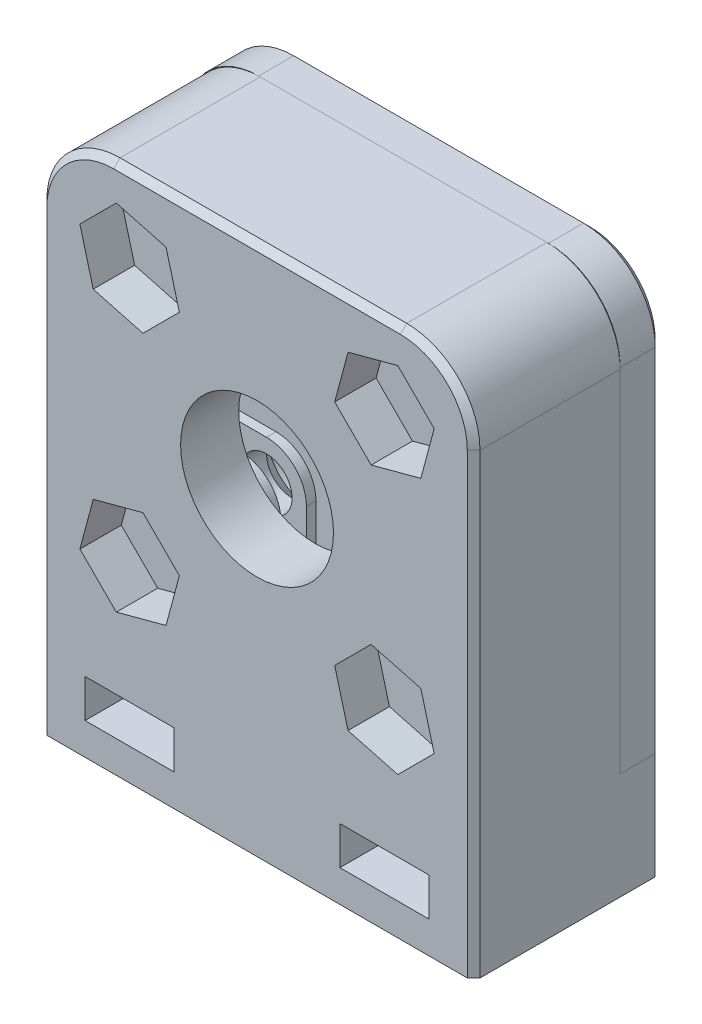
ISO-10303-21;
HEADER;
FILE_DESCRIPTION(('STEP AP214'),'2;1');
FILE_NAME('part.step','',(''),(''),'','','');
FILE_SCHEMA(('AUTOMOTIVE_DESIGN { 1 0 10303 214 1 1 1 1 }'));
ENDSEC;
DATA;
#1=APPLICATION_CONTEXT('core data for automotive mechanical design processes');
#2=APPLICATION_PROTOCOL_DEFINITION('international standard','automotive_design',2000,#1);
#3=PRODUCT_CONTEXT('',#1,'mechanical');
#4=PRODUCT('Part','Part','',(#3));
#5=PRODUCT_RELATED_PRODUCT_CATEGORY('part','',(#4));
#6=PRODUCT_DEFINITION_FORMATION('','',#4);
#7=PRODUCT_DEFINITION_CONTEXT('part definition',#1,'design');
#8=PRODUCT_DEFINITION('design','',#6,#7);
#9=PRODUCT_DEFINITION_SHAPE('','',#8);
#10=(LENGTH_UNIT() NAMED_UNIT(*) SI_UNIT(.MILLI.,.METRE.));
#11=(NAMED_UNIT(*) PLANE_ANGLE_UNIT() SI_UNIT($,.RADIAN.));
#12=(NAMED_UNIT(*) SI_UNIT($,.STERADIAN.) SOLID_ANGLE_UNIT());
#13=UNCERTAINTY_MEASURE_WITH_UNIT(LENGTH_MEASURE(1.E-05),#10,'distance_accuracy_value','');
#14=(GEOMETRIC_REPRESENTATION_CONTEXT(3) GLOBAL_UNCERTAINTY_ASSIGNED_CONTEXT((#13)) GLOBAL_UNIT_ASSIGNED_CONTEXT((#10,
#11,#12)) REPRESENTATION_CONTEXT('',''));
#15=CARTESIAN_POINT('',(0.,0.,0.));
#16=DIRECTION('',(0.,0.,1.));
#17=DIRECTION('',(1.,0.,0.));
#18=AXIS2_PLACEMENT_3D('',#15,#16,#17);
#19=CARTESIAN_POINT('',(8.,8.,0.6));
#20=DIRECTION('',(0.,0.,-1.));
#21=DIRECTION('',(-1.,0.,0.));
#22=AXIS2_PLACEMENT_3D('',#19,#20,#21);
#23=CYLINDRICAL_SURFACE('',#22,1.6);
#24=CARTESIAN_POINT('',(8.,8.,-1.));
#25=DIRECTION('',(0.,0.,-1.));
#26=DIRECTION('',(-1.,0.,0.));
#27=AXIS2_PLACEMENT_3D('',#24,#25,#26);
#28=CIRCLE('',#27,1.6);
#29=CARTESIAN_POINT('',(6.4,8.,-1.));
#30=VERTEX_POINT('',#29);
#31=EDGE_CURVE('E495',#30,#30,#28,.T.);
#32=ORIENTED_EDGE('',*,*,#31,.T.);
#33=EDGE_LOOP('',(#32));
#34=FACE_BOUND('',#33,.T.);
#35=CARTESIAN_POINT('',(8.,8.,0.6));
#36=DIRECTION('',(0.,0.,1.));
#37=DIRECTION('',(1.,0.,0.));
#38=AXIS2_PLACEMENT_3D('',#35,#36,#37);
#39=CIRCLE('',#38,1.6);
#40=CARTESIAN_POINT('',(9.6,8.,0.6));
#41=VERTEX_POINT('',#40);
#42=EDGE_CURVE('E378',#41,#41,#39,.T.);
#43=ORIENTED_EDGE('',*,*,#42,.T.);
#44=EDGE_LOOP('',(#43));
#45=FACE_BOUND('',#44,.T.);
#46=ADVANCED_FACE('F47',(#34,#45),#23,.F.);
#47=CARTESIAN_POINT('',(8.,-8.,0.6));
#48=DIRECTION('',(0.,0.,-1.));
#49=DIRECTION('',(-1.,0.,0.));
#50=AXIS2_PLACEMENT_3D('',#47,#48,#49);
#51=CYLINDRICAL_SURFACE('',#50,1.6);
#52=CARTESIAN_POINT('',(8.,-8.,-1.));
#53=DIRECTION('',(0.,0.,-1.));
#54=DIRECTION('',(-1.,0.,0.));
#55=AXIS2_PLACEMENT_3D('',#52,#53,#54);
#56=CIRCLE('',#55,1.6);
#57=CARTESIAN_POINT('',(6.4,-8.,-1.));
#58=VERTEX_POINT('',#57);
#59=EDGE_CURVE('E486',#58,#58,#56,.T.);
#60=ORIENTED_EDGE('',*,*,#59,.T.);
#61=EDGE_LOOP('',(#60));
#62=FACE_BOUND('',#61,.T.);
#63=CARTESIAN_POINT('',(8.,-8.,0.6));
#64=DIRECTION('',(0.,0.,1.));
#65=DIRECTION('',(-1.,0.,0.));
#66=AXIS2_PLACEMENT_3D('',#63,#64,#65);
#67=CIRCLE('',#66,1.6);
#68=CARTESIAN_POINT('',(6.4,-8.,0.6));
#69=VERTEX_POINT('',#68);
#70=EDGE_CURVE('E291',#69,#69,#67,.T.);
#71=ORIENTED_EDGE('',*,*,#70,.T.);
#72=EDGE_LOOP('',(#71));
#73=FACE_BOUND('',#72,.T.);
#74=ADVANCED_FACE('F611',(#62,#73),#51,.F.);
#75=CARTESIAN_POINT('',(-8.,-8.,0.6));
#76=DIRECTION('',(0.,0.,-1.));
#77=DIRECTION('',(-1.,0.,0.));
#78=AXIS2_PLACEMENT_3D('',#75,#76,#77);
#79=CYLINDRICAL_SURFACE('',#78,1.6);
#80=CARTESIAN_POINT('',(-8.,-8.,-1.));
#81=DIRECTION('',(0.,0.,-1.));
#82=DIRECTION('',(-1.,0.,0.));
#83=AXIS2_PLACEMENT_3D('',#80,#81,#82);
#84=CIRCLE('',#83,1.6);
#85=CARTESIAN_POINT('',(-9.6,-8.,-1.));
#86=VERTEX_POINT('',#85);
#87=EDGE_CURVE('E489',#86,#86,#84,.T.);
#88=ORIENTED_EDGE('',*,*,#87,.T.);
#89=EDGE_LOOP('',(#88));
#90=FACE_BOUND('',#89,.T.);
#91=CARTESIAN_POINT('',(-8.,-8.,0.6));
#92=DIRECTION('',(0.,0.,1.));
#93=DIRECTION('',(1.,0.,0.));
#94=AXIS2_PLACEMENT_3D('',#91,#92,#93);
#95=CIRCLE('',#94,1.6);
#96=CARTESIAN_POINT('',(-6.4,-8.,0.6));
#97=VERTEX_POINT('',#96);
#98=EDGE_CURVE('E558',#97,#97,#95,.T.);
#99=ORIENTED_EDGE('',*,*,#98,.T.);
#100=EDGE_LOOP('',(#99));
#101=FACE_BOUND('',#100,.T.);
#102=ADVANCED_FACE('F617',(#90,#101),#79,.F.);
#103=CARTESIAN_POINT('',(-8.,8.,0.6));
#104=DIRECTION('',(0.,0.,-1.));
#105=DIRECTION('',(-1.,0.,0.));
#106=AXIS2_PLACEMENT_3D('',#103,#104,#105);
#107=CYLINDRICAL_SURFACE('',#106,1.6);
#108=CARTESIAN_POINT('',(-8.,8.,-1.));
#109=DIRECTION('',(0.,0.,-1.));
#110=DIRECTION('',(-1.,0.,0.));
#111=AXIS2_PLACEMENT_3D('',#108,#109,#110);
#112=CIRCLE('',#111,1.6);
#113=CARTESIAN_POINT('',(-9.6,8.,-1.));
#114=VERTEX_POINT('',#113);
#115=EDGE_CURVE('E492',#114,#114,#112,.T.);
#116=ORIENTED_EDGE('',*,*,#115,.T.);
#117=EDGE_LOOP('',(#116));
#118=FACE_BOUND('',#117,.T.);
#119=CARTESIAN_POINT('',(-8.,8.,0.6));
#120=DIRECTION('',(0.,0.,1.));
#121=DIRECTION('',(-1.,0.,0.));
#122=AXIS2_PLACEMENT_3D('',#119,#120,#121);
#123=CIRCLE('',#122,1.6);
#124=CARTESIAN_POINT('',(-9.6,8.,0.6));
#125=VERTEX_POINT('',#124);
#126=EDGE_CURVE('E337',#125,#125,#123,.T.);
#127=ORIENTED_EDGE('',*,*,#126,.T.);
#128=EDGE_LOOP('',(#127));
#129=FACE_BOUND('',#128,.T.);
#130=ADVANCED_FACE('F658',(#118,#129),#107,.F.);
#131=CARTESIAN_POINT('',(0.,0.,0.));
#132=DIRECTION('',(0.,0.,-1.));
#133=DIRECTION('',(-1.,0.,0.));
#134=AXIS2_PLACEMENT_3D('',#131,#132,#133);
#135=PLANE('',#134);
#136=DIRECTION('',(1.,0.,0.));
#137=VECTOR('',#136,1.);
#138=CARTESIAN_POINT('',(-13.6,13.3,0.));
#139=LINE('',#138,#137);
#140=CARTESIAN_POINT('',(-9.10000000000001,13.3,0.));
#141=VERTEX_POINT('',#140);
#142=CARTESIAN_POINT('',(9.09999999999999,13.3,0.));
#143=VERTEX_POINT('',#142);
#144=EDGE_CURVE('E419',#141,#143,#139,.T.);
#145=ORIENTED_EDGE('',*,*,#144,.F.);
#146=CARTESIAN_POINT('',(-9.10000000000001,8.8,0.));
#147=DIRECTION('',(0.,0.,-1.));
#148=DIRECTION('',(-1.,0.,0.));
#149=AXIS2_PLACEMENT_3D('',#146,#147,#148);
#150=CIRCLE('',#149,4.5);
#151=CARTESIAN_POINT('',(-13.6,8.8,0.));
#152=VERTEX_POINT('',#151);
#153=EDGE_CURVE('E480',#141,#152,#150,.F.);
#154=ORIENTED_EDGE('',*,*,#153,.T.);
#155=DIRECTION('',(0.,1.,0.));
#156=VECTOR('',#155,1.);
#157=CARTESIAN_POINT('',(-13.6,-13.3,0.));
#158=LINE('',#157,#156);
#159=CARTESIAN_POINT('',(-13.6,-13.3,0.));
#160=VERTEX_POINT('',#159);
#161=EDGE_CURVE('E424',#160,#152,#158,.T.);
#162=ORIENTED_EDGE('',*,*,#161,.F.);
#163=DIRECTION('',(-1.,0.,0.));
#164=VECTOR('',#163,1.);
#165=CARTESIAN_POINT('',(13.6,-13.3,0.));
#166=LINE('',#165,#164);
#167=CARTESIAN_POINT('',(13.6,-13.3,0.));
#168=VERTEX_POINT('',#167);
#169=EDGE_CURVE('E430',#168,#160,#166,.T.);
#170=ORIENTED_EDGE('',*,*,#169,.F.);
#171=DIRECTION('',(0.,-1.,0.));
#172=VECTOR('',#171,1.);
#173=CARTESIAN_POINT('',(13.6,13.3,0.));
#174=LINE('',#173,#172);
#175=CARTESIAN_POINT('',(13.6,8.8,0.));
#176=VERTEX_POINT('',#175);
#177=EDGE_CURVE('E427',#176,#168,#174,.T.);
#178=ORIENTED_EDGE('',*,*,#177,.F.);
#179=CARTESIAN_POINT('',(9.09999999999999,8.8,0.));
#180=DIRECTION('',(0.,0.,-1.));
#181=DIRECTION('',(-1.,0.,0.));
#182=AXIS2_PLACEMENT_3D('',#179,#180,#181);
#183=CIRCLE('',#182,4.5);
#184=EDGE_CURVE('E478',#176,#143,#183,.F.);
#185=ORIENTED_EDGE('',*,*,#184,.T.);
#186=EDGE_LOOP('',(#145,#154,#162,#170,#178,#185));
#187=FACE_BOUND('',#186,.T.);
#188=DIRECTION('',(0.,-1.,0.));
#189=VECTOR('',#188,1.);
#190=CARTESIAN_POINT('',(5.5,11.6,0.));
#191=LINE('',#190,#189);
#192=CARTESIAN_POINT('',(5.5,11.6,0.));
#193=VERTEX_POINT('',#192);
#194=CARTESIAN_POINT('',(5.5,8.,0.));
#195=VERTEX_POINT('',#194);
#196=EDGE_CURVE('E381',#193,#195,#191,.T.);
#197=ORIENTED_EDGE('',*,*,#196,.F.);
#198=DIRECTION('',(-1.,0.,0.));
#199=VECTOR('',#198,1.);
#200=CARTESIAN_POINT('',(5.5,11.6,0.));
#201=LINE('',#200,#199);
#202=CARTESIAN_POINT('',(9.00000000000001,11.6,0.));
#203=VERTEX_POINT('',#202);
#204=EDGE_CURVE('E386',#203,#193,#201,.T.);
#205=ORIENTED_EDGE('',*,*,#204,.F.);
#206=CARTESIAN_POINT('',(9.00000000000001,8.7,0.));
#207=DIRECTION('',(0.,0.,-1.));
#208=DIRECTION('',(-1.,0.,0.));
#209=AXIS2_PLACEMENT_3D('',#206,#207,#208);
#210=CIRCLE('',#209,2.9);
#211=CARTESIAN_POINT('',(11.9,8.7,0.));
#212=VERTEX_POINT('',#211);
#213=EDGE_CURVE('E466',#203,#212,#210,.T.);
#214=ORIENTED_EDGE('',*,*,#213,.T.);
#215=DIRECTION('',(0.,1.,0.));
#216=VECTOR('',#215,1.);
#217=CARTESIAN_POINT('',(11.9,11.6,0.));
#218=LINE('',#217,#216);
#219=CARTESIAN_POINT('',(11.9,5.5,0.));
#220=VERTEX_POINT('',#219);
#221=EDGE_CURVE('E404',#220,#212,#218,.T.);
#222=ORIENTED_EDGE('',*,*,#221,.F.);
#223=DIRECTION('',(1.,0.,0.));
#224=VECTOR('',#223,1.);
#225=CARTESIAN_POINT('',(8.,5.5,0.));
#226=LINE('',#225,#224);
#227=CARTESIAN_POINT('',(8.,5.5,0.));
#228=VERTEX_POINT('',#227);
#229=EDGE_CURVE('E401',#228,#220,#226,.T.);
#230=ORIENTED_EDGE('',*,*,#229,.F.);
#231=CARTESIAN_POINT('',(8.,8.,0.));
#232=DIRECTION('',(0.,0.,1.));
#233=DIRECTION('',(1.,0.,0.));
#234=AXIS2_PLACEMENT_3D('',#231,#232,#233);
#235=CIRCLE('',#234,2.5);
#236=EDGE_CURVE('E398',#195,#228,#235,.T.);
#237=ORIENTED_EDGE('',*,*,#236,.F.);
#238=EDGE_LOOP('',(#197,#205,#214,#222,#230,#237));
#239=FACE_BOUND('',#238,.T.);
#240=CARTESIAN_POINT('',(-8.,8.,0.));
#241=DIRECTION('',(0.,0.,1.));
#242=DIRECTION('',(-1.,0.,0.));
#243=AXIS2_PLACEMENT_3D('',#240,#241,#242);
#244=CIRCLE('',#243,2.5);
#245=CARTESIAN_POINT('',(-8.,5.5,0.));
#246=VERTEX_POINT('',#245);
#247=CARTESIAN_POINT('',(-5.5,8.,0.));
#248=VERTEX_POINT('',#247);
#249=EDGE_CURVE('E340',#246,#248,#244,.T.);
#250=ORIENTED_EDGE('',*,*,#249,.F.);
#251=DIRECTION('',(1.,0.,0.));
#252=VECTOR('',#251,1.);
#253=CARTESIAN_POINT('',(-8.,5.5,0.));
#254=LINE('',#253,#252);
#255=CARTESIAN_POINT('',(-11.9,5.5,0.));
#256=VERTEX_POINT('',#255);
#257=EDGE_CURVE('E345',#256,#246,#254,.T.);
#258=ORIENTED_EDGE('',*,*,#257,.F.);
#259=DIRECTION('',(0.,-1.,0.));
#260=VECTOR('',#259,1.);
#261=CARTESIAN_POINT('',(-11.9,11.6,0.));
#262=LINE('',#261,#260);
#263=CARTESIAN_POINT('',(-11.9,8.7,0.));
#264=VERTEX_POINT('',#263);
#265=EDGE_CURVE('E363',#264,#256,#262,.T.);
#266=ORIENTED_EDGE('',*,*,#265,.F.);
#267=CARTESIAN_POINT('',(-9.,8.7,0.));
#268=DIRECTION('',(0.,0.,-1.));
#269=DIRECTION('',(-1.,0.,0.));
#270=AXIS2_PLACEMENT_3D('',#267,#268,#269);
#271=CIRCLE('',#270,2.9);
#272=CARTESIAN_POINT('',(-9.,11.6,0.));
#273=VERTEX_POINT('',#272);
#274=EDGE_CURVE('E472',#264,#273,#271,.T.);
#275=ORIENTED_EDGE('',*,*,#274,.T.);
#276=DIRECTION('',(-1.,0.,0.));
#277=VECTOR('',#276,1.);
#278=CARTESIAN_POINT('',(-5.5,11.6,0.));
#279=LINE('',#278,#277);
#280=CARTESIAN_POINT('',(-5.5,11.6,0.));
#281=VERTEX_POINT('',#280);
#282=EDGE_CURVE('E360',#281,#273,#279,.T.);
#283=ORIENTED_EDGE('',*,*,#282,.F.);
#284=DIRECTION('',(0.,1.,0.));
#285=VECTOR('',#284,1.);
#286=CARTESIAN_POINT('',(-5.5,11.6,0.));
#287=LINE('',#286,#285);
#288=EDGE_CURVE('E357',#248,#281,#287,.T.);
#289=ORIENTED_EDGE('',*,*,#288,.F.);
#290=EDGE_LOOP('',(#250,#258,#266,#275,#283,#289));
#291=FACE_BOUND('',#290,.T.);
#292=CARTESIAN_POINT('',(8.,-8.,0.));
#293=DIRECTION('',(0.,0.,1.));
#294=DIRECTION('',(-1.,0.,0.));
#295=AXIS2_PLACEMENT_3D('',#292,#293,#294);
#296=CIRCLE('',#295,2.5);
#297=CARTESIAN_POINT('',(8.,-5.5,0.));
#298=VERTEX_POINT('',#297);
#299=CARTESIAN_POINT('',(5.5,-8.,0.));
#300=VERTEX_POINT('',#299);
#301=EDGE_CURVE('E294',#298,#300,#296,.T.);
#302=ORIENTED_EDGE('',*,*,#301,.F.);
#303=DIRECTION('',(-1.,0.,0.));
#304=VECTOR('',#303,1.);
#305=CARTESIAN_POINT('',(8.,-5.5,0.));
#306=LINE('',#305,#304);
#307=CARTESIAN_POINT('',(11.9,-5.5,0.));
#308=VERTEX_POINT('',#307);
#309=EDGE_CURVE('E304',#308,#298,#306,.T.);
#310=ORIENTED_EDGE('',*,*,#309,.F.);
#311=DIRECTION('',(0.,1.,0.));
#312=VECTOR('',#311,1.);
#313=CARTESIAN_POINT('',(11.9,-11.6,0.));
#314=LINE('',#313,#312);
#315=CARTESIAN_POINT('',(11.9,-8.7,0.));
#316=VERTEX_POINT('',#315);
#317=EDGE_CURVE('E322',#316,#308,#314,.T.);
#318=ORIENTED_EDGE('',*,*,#317,.F.);
#319=CARTESIAN_POINT('',(9.00000000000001,-8.7,0.));
#320=DIRECTION('',(0.,0.,-1.));
#321=DIRECTION('',(-1.,0.,0.));
#322=AXIS2_PLACEMENT_3D('',#319,#320,#321);
#323=CIRCLE('',#322,2.9);
#324=CARTESIAN_POINT('',(9.00000000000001,-11.6,0.));
#325=VERTEX_POINT('',#324);
#326=EDGE_CURVE('E468',#316,#325,#323,.T.);
#327=ORIENTED_EDGE('',*,*,#326,.T.);
#328=DIRECTION('',(1.,0.,0.));
#329=VECTOR('',#328,1.);
#330=CARTESIAN_POINT('',(5.5,-11.6,0.));
#331=LINE('',#330,#329);
#332=CARTESIAN_POINT('',(5.5,-11.6,0.));
#333=VERTEX_POINT('',#332);
#334=EDGE_CURVE('E319',#333,#325,#331,.T.);
#335=ORIENTED_EDGE('',*,*,#334,.F.);
#336=DIRECTION('',(0.,-1.,0.));
#337=VECTOR('',#336,1.);
#338=CARTESIAN_POINT('',(5.5,-11.6,0.));
#339=LINE('',#338,#337);
#340=EDGE_CURVE('E316',#300,#333,#339,.T.);
#341=ORIENTED_EDGE('',*,*,#340,.F.);
#342=EDGE_LOOP('',(#302,#310,#318,#327,#335,#341));
#343=FACE_BOUND('',#342,.T.);
#344=CARTESIAN_POINT('',(-8.,-8.,0.));
#345=DIRECTION('',(0.,0.,1.));
#346=DIRECTION('',(1.,0.,0.));
#347=AXIS2_PLACEMENT_3D('',#344,#345,#346);
#348=CIRCLE('',#347,2.5);
#349=CARTESIAN_POINT('',(-5.5,-8.,0.));
#350=VERTEX_POINT('',#349);
#351=CARTESIAN_POINT('',(-8.,-5.5,0.));
#352=VERTEX_POINT('',#351);
#353=EDGE_CURVE('E290',#350,#352,#348,.T.);
#354=ORIENTED_EDGE('',*,*,#353,.F.);
#355=DIRECTION('',(0.,1.,0.));
#356=VECTOR('',#355,1.);
#357=CARTESIAN_POINT('',(-5.5,-11.6,0.));
#358=LINE('',#357,#356);
#359=CARTESIAN_POINT('',(-5.5,-11.6,0.));
#360=VERTEX_POINT('',#359);
#361=EDGE_CURVE('E287',#360,#350,#358,.T.);
#362=ORIENTED_EDGE('',*,*,#361,.F.);
#363=DIRECTION('',(1.,0.,0.));
#364=VECTOR('',#363,1.);
#365=CARTESIAN_POINT('',(-5.5,-11.6,0.));
#366=LINE('',#365,#364);
#367=CARTESIAN_POINT('',(-9.,-11.6,0.));
#368=VERTEX_POINT('',#367);
#369=EDGE_CURVE('E574',#368,#360,#366,.T.);
#370=ORIENTED_EDGE('',*,*,#369,.F.);
#371=CARTESIAN_POINT('',(-9.,-8.7,0.));
#372=DIRECTION('',(0.,0.,-1.));
#373=DIRECTION('',(-1.,0.,0.));
#374=AXIS2_PLACEMENT_3D('',#371,#372,#373);
#375=CIRCLE('',#374,2.9);
#376=CARTESIAN_POINT('',(-11.9,-8.7,0.));
#377=VERTEX_POINT('',#376);
#378=EDGE_CURVE('E470',#368,#377,#375,.T.);
#379=ORIENTED_EDGE('',*,*,#378,.T.);
#380=DIRECTION('',(0.,-1.,0.));
#381=VECTOR('',#380,1.);
#382=CARTESIAN_POINT('',(-11.9,-11.6,0.));
#383=LINE('',#382,#381);
#384=CARTESIAN_POINT('',(-11.9,-5.5,0.));
#385=VERTEX_POINT('',#384);
#386=EDGE_CURVE('E571',#385,#377,#383,.T.);
#387=ORIENTED_EDGE('',*,*,#386,.F.);
#388=DIRECTION('',(-1.,0.,0.));
#389=VECTOR('',#388,1.);
#390=CARTESIAN_POINT('',(-8.,-5.5,0.));
#391=LINE('',#390,#389);
#392=EDGE_CURVE('E569',#352,#385,#391,.T.);
#393=ORIENTED_EDGE('',*,*,#392,.F.);
#394=EDGE_LOOP('',(#354,#362,#370,#379,#387,#393));
#395=FACE_BOUND('',#394,.T.);
#396=ADVANCED_FACE('F589',(#187,#239,#291,#343,#395),#135,.F.);
#397=CARTESIAN_POINT('',(-13.6,13.3,-2.6));
#398=DIRECTION('',(0.,-1.,0.));
#399=DIRECTION('',(0.,0.,-1.));
#400=AXIS2_PLACEMENT_3D('',#397,#398,#399);
#401=PLANE('',#400);
#402=DIRECTION('',(0.,0.,1.));
#403=VECTOR('',#402,1.);
#404=CARTESIAN_POINT('',(9.09999999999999,13.3,-2.6));
#405=LINE('',#404,#403);
#406=CARTESIAN_POINT('',(9.09999999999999,13.3,-2.19999999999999));
#407=VERTEX_POINT('',#406);
#408=EDGE_CURVE('E474',#143,#407,#405,.F.);
#409=ORIENTED_EDGE('',*,*,#408,.T.);
#410=DIRECTION('',(-1.,0.,0.));
#411=VECTOR('',#410,1.);
#412=CARTESIAN_POINT('',(-9.10000000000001,13.3,-2.19999999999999));
#413=LINE('',#412,#411);
#414=CARTESIAN_POINT('',(-9.10000000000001,13.3,-2.19999999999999));
#415=VERTEX_POINT('',#414);
#416=EDGE_CURVE('E71',#407,#415,#413,.T.);
#417=ORIENTED_EDGE('',*,*,#416,.T.);
#418=DIRECTION('',(0.,0.,1.));
#419=VECTOR('',#418,1.);
#420=CARTESIAN_POINT('',(-9.10000000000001,13.3,-2.6));
#421=LINE('',#420,#419);
#422=EDGE_CURVE('E476',#415,#141,#421,.T.);
#423=ORIENTED_EDGE('',*,*,#422,.T.);
#424=ORIENTED_EDGE('',*,*,#144,.T.);
#425=EDGE_LOOP('',(#409,#417,#423,#424));
#426=FACE_BOUND('',#425,.T.);
#427=ADVANCED_FACE('F657',(#426),#401,.F.);
#428=CARTESIAN_POINT('',(13.6,13.3,-2.6));
#429=DIRECTION('',(-1.,0.,0.));
#430=DIRECTION('',(0.,0.,1.));
#431=AXIS2_PLACEMENT_3D('',#428,#429,#430);
#432=PLANE('',#431);
#433=DIRECTION('',(0.,0.,1.));
#434=VECTOR('',#433,1.);
#435=CARTESIAN_POINT('',(13.6,-13.3,-2.6));
#436=LINE('',#435,#434);
#437=CARTESIAN_POINT('',(13.6,-13.3,-2.19999999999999));
#438=VERTEX_POINT('',#437);
#439=EDGE_CURVE('E436',#438,#168,#436,.T.);
#440=ORIENTED_EDGE('',*,*,#439,.F.);
#441=DIRECTION('',(0.,1.,0.));
#442=VECTOR('',#441,1.);
#443=CARTESIAN_POINT('',(13.6,8.8,-2.19999999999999));
#444=LINE('',#443,#442);
#445=CARTESIAN_POINT('',(13.6,8.8,-2.19999999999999));
#446=VERTEX_POINT('',#445);
#447=EDGE_CURVE('E513',#438,#446,#444,.T.);
#448=ORIENTED_EDGE('',*,*,#447,.T.);
#449=DIRECTION('',(0.,0.,1.));
#450=VECTOR('',#449,1.);
#451=CARTESIAN_POINT('',(13.6,8.8,-2.6));
#452=LINE('',#451,#450);
#453=EDGE_CURVE('E484',#446,#176,#452,.T.);
#454=ORIENTED_EDGE('',*,*,#453,.T.);
#455=ORIENTED_EDGE('',*,*,#177,.T.);
#456=EDGE_LOOP('',(#440,#448,#454,#455));
#457=FACE_BOUND('',#456,.T.);
#458=ADVANCED_FACE('F666',(#457),#432,.F.);
#459=CARTESIAN_POINT('',(13.6,-13.3,-2.6));
#460=DIRECTION('',(0.,1.,0.));
#461=DIRECTION('',(0.,0.,1.));
#462=AXIS2_PLACEMENT_3D('',#459,#460,#461);
#463=PLANE('',#462);
#464=DIRECTION('',(-1.,0.,0.));
#465=VECTOR('',#464,1.);
#466=CARTESIAN_POINT('',(13.6,-13.3,-2.6));
#467=LINE('',#466,#465);
#468=CARTESIAN_POINT('',(13.2,-13.3,-2.6));
#469=VERTEX_POINT('',#468);
#470=CARTESIAN_POINT('',(-13.2,-13.3,-2.6));
#471=VERTEX_POINT('',#470);
#472=EDGE_CURVE('E420',#469,#471,#467,.T.);
#473=ORIENTED_EDGE('',*,*,#472,.F.);
#474=DIRECTION('',(0.707106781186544,0.,0.707106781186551));
#475=VECTOR('',#474,1.);
#476=CARTESIAN_POINT('',(13.2,-13.3,-2.6));
#477=LINE('',#476,#475);
#478=EDGE_CURVE('E511',#469,#438,#477,.T.);
#479=ORIENTED_EDGE('',*,*,#478,.T.);
#480=ORIENTED_EDGE('',*,*,#439,.T.);
#481=ORIENTED_EDGE('',*,*,#169,.T.);
#482=DIRECTION('',(0.,0.,1.));
#483=VECTOR('',#482,1.);
#484=CARTESIAN_POINT('',(-13.6,-13.3,-2.6));
#485=LINE('',#484,#483);
#486=CARTESIAN_POINT('',(-13.6,-13.3,-2.19999999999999));
#487=VERTEX_POINT('',#486);
#488=EDGE_CURVE('E423',#487,#160,#485,.T.);
#489=ORIENTED_EDGE('',*,*,#488,.F.);
#490=DIRECTION('',(0.707106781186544,0.,-0.707106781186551));
#491=VECTOR('',#490,1.);
#492=CARTESIAN_POINT('',(-13.2,-13.3,-2.6));
#493=LINE('',#492,#491);
#494=EDGE_CURVE('E509',#487,#471,#493,.T.);
#495=ORIENTED_EDGE('',*,*,#494,.T.);
#496=EDGE_LOOP('',(#473,#479,#480,#481,#489,#495));
#497=FACE_BOUND('',#496,.T.);
#498=ADVANCED_FACE('F662',(#497),#463,.F.);
#499=CARTESIAN_POINT('',(-13.6,-13.3,-2.6));
#500=DIRECTION('',(1.,0.,0.));
#501=DIRECTION('',(0.,0.,-1.));
#502=AXIS2_PLACEMENT_3D('',#499,#500,#501);
#503=PLANE('',#502);
#504=DIRECTION('',(0.,0.,1.));
#505=VECTOR('',#504,1.);
#506=CARTESIAN_POINT('',(-13.6,8.8,-2.6));
#507=LINE('',#506,#505);
#508=CARTESIAN_POINT('',(-13.6,8.8,-2.19999999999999));
#509=VERTEX_POINT('',#508);
#510=EDGE_CURVE('E482',#152,#509,#507,.F.);
#511=ORIENTED_EDGE('',*,*,#510,.T.);
#512=DIRECTION('',(0.,-1.,0.));
#513=VECTOR('',#512,1.);
#514=CARTESIAN_POINT('',(-13.6,-13.3,-2.19999999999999));
#515=LINE('',#514,#513);
#516=EDGE_CURVE('E14',#509,#487,#515,.T.);
#517=ORIENTED_EDGE('',*,*,#516,.T.);
#518=ORIENTED_EDGE('',*,*,#488,.T.);
#519=ORIENTED_EDGE('',*,*,#161,.T.);
#520=EDGE_LOOP('',(#511,#517,#518,#519));
#521=FACE_BOUND('',#520,.T.);
#522=ADVANCED_FACE('F653',(#521),#503,.F.);
#523=CARTESIAN_POINT('',(0.,0.,-2.6));
#524=DIRECTION('',(0.,0.,-1.));
#525=DIRECTION('',(-1.,0.,0.));
#526=AXIS2_PLACEMENT_3D('',#523,#524,#525);
#527=PLANE('',#526);
#528=CARTESIAN_POINT('',(8.,8.,-2.6));
#529=DIRECTION('',(0.,0.,-1.));
#530=DIRECTION('',(-1.,0.,0.));
#531=AXIS2_PLACEMENT_3D('',#528,#529,#530);
#532=CIRCLE('',#531,2.8);
#533=CARTESIAN_POINT('',(5.2,8.,-2.6));
#534=VERTEX_POINT('',#533);
#535=EDGE_CURVE('E530',#534,#534,#532,.T.);
#536=ORIENTED_EDGE('',*,*,#535,.F.);
#537=EDGE_LOOP('',(#536));
#538=FACE_BOUND('',#537,.T.);
#539=CARTESIAN_POINT('',(8.,-8.,-2.6));
#540=DIRECTION('',(0.,0.,-1.));
#541=DIRECTION('',(-1.,0.,0.));
#542=AXIS2_PLACEMENT_3D('',#539,#540,#541);
#543=CIRCLE('',#542,2.8);
#544=CARTESIAN_POINT('',(5.2,-8.,-2.6));
#545=VERTEX_POINT('',#544);
#546=EDGE_CURVE('E540',#545,#545,#543,.T.);
#547=ORIENTED_EDGE('',*,*,#546,.F.);
#548=EDGE_LOOP('',(#547));
#549=FACE_BOUND('',#548,.T.);
#550=CARTESIAN_POINT('',(-8.,-8.,-2.6));
#551=DIRECTION('',(0.,0.,-1.));
#552=DIRECTION('',(-1.,0.,0.));
#553=AXIS2_PLACEMENT_3D('',#550,#551,#552);
#554=CIRCLE('',#553,2.8);
#555=CARTESIAN_POINT('',(-10.8,-8.,-2.6));
#556=VERTEX_POINT('',#555);
#557=EDGE_CURVE('E546',#556,#556,#554,.T.);
#558=ORIENTED_EDGE('',*,*,#557,.F.);
#559=EDGE_LOOP('',(#558));
#560=FACE_BOUND('',#559,.T.);
#561=CARTESIAN_POINT('',(-8.,8.,-2.6));
#562=DIRECTION('',(0.,0.,-1.));
#563=DIRECTION('',(-1.,0.,0.));
#564=AXIS2_PLACEMENT_3D('',#561,#562,#563);
#565=CIRCLE('',#564,2.8);
#566=CARTESIAN_POINT('',(-10.8,8.,-2.6));
#567=VERTEX_POINT('',#566);
#568=EDGE_CURVE('E552',#567,#567,#565,.T.);
#569=ORIENTED_EDGE('',*,*,#568,.F.);
#570=EDGE_LOOP('',(#569));
#571=FACE_BOUND('',#570,.T.);
#572=CARTESIAN_POINT('',(9.09999999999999,8.8,-2.6));
#573=DIRECTION('',(0.,0.,-1.));
#574=DIRECTION('',(-1.,0.,0.));
#575=AXIS2_PLACEMENT_3D('',#572,#573,#574);
#576=CIRCLE('',#575,4.1);
#577=CARTESIAN_POINT('',(9.09999999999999,12.9,-2.6));
#578=VERTEX_POINT('',#577);
#579=CARTESIAN_POINT('',(13.2,8.8,-2.6));
#580=VERTEX_POINT('',#579);
#581=EDGE_CURVE('E504',#578,#580,#576,.T.);
#582=ORIENTED_EDGE('',*,*,#581,.T.);
#583=DIRECTION('',(0.,-1.,0.));
#584=VECTOR('',#583,1.);
#585=CARTESIAN_POINT('',(13.2,-13.3,-2.6));
#586=LINE('',#585,#584);
#587=EDGE_CURVE('E506',#580,#469,#586,.T.);
#588=ORIENTED_EDGE('',*,*,#587,.T.);
#589=ORIENTED_EDGE('',*,*,#472,.T.);
#590=DIRECTION('',(0.,1.,0.));
#591=VECTOR('',#590,1.);
#592=CARTESIAN_POINT('',(-13.2,8.8,-2.6));
#593=LINE('',#592,#591);
#594=CARTESIAN_POINT('',(-13.2,8.8,-2.6));
#595=VERTEX_POINT('',#594);
#596=EDGE_CURVE('E498',#471,#595,#593,.T.);
#597=ORIENTED_EDGE('',*,*,#596,.T.);
#598=CARTESIAN_POINT('',(-9.10000000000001,8.8,-2.6));
#599=DIRECTION('',(0.,0.,-1.));
#600=DIRECTION('',(-1.,0.,0.));
#601=AXIS2_PLACEMENT_3D('',#598,#599,#600);
#602=CIRCLE('',#601,4.09999999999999);
#603=CARTESIAN_POINT('',(-9.10000000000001,12.9,-2.6));
#604=VERTEX_POINT('',#603);
#605=EDGE_CURVE('E500',#595,#604,#602,.T.);
#606=ORIENTED_EDGE('',*,*,#605,.T.);
#607=DIRECTION('',(1.,0.,0.));
#608=VECTOR('',#607,1.);
#609=CARTESIAN_POINT('',(9.09999999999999,12.9,-2.6));
#610=LINE('',#609,#608);
#611=EDGE_CURVE('E502',#604,#578,#610,.T.);
#612=ORIENTED_EDGE('',*,*,#611,.T.);
#613=EDGE_LOOP('',(#582,#588,#589,#597,#606,#612));
#614=FACE_BOUND('',#613,.T.);
#615=ADVANCED_FACE('F629',(#538,#549,#560,#571,#614),#527,.T.);
#616=CARTESIAN_POINT('',(8.,8.,0.6));
#617=DIRECTION('',(0.,0.,1.));
#618=DIRECTION('',(1.,0.,0.));
#619=AXIS2_PLACEMENT_3D('',#616,#617,#618);
#620=PLANE('',#619);
#621=DIRECTION('',(0.,1.,0.));
#622=VECTOR('',#621,1.);
#623=CARTESIAN_POINT('',(11.9,11.6,0.6));
#624=LINE('',#623,#622);
#625=CARTESIAN_POINT('',(11.9,5.5,0.6));
#626=VERTEX_POINT('',#625);
#627=CARTESIAN_POINT('',(11.9,8.7,0.6));
#628=VERTEX_POINT('',#627);
#629=EDGE_CURVE('E390',#626,#628,#624,.T.);
#630=ORIENTED_EDGE('',*,*,#629,.T.);
#631=CARTESIAN_POINT('',(9.00000000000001,8.7,0.6));
#632=DIRECTION('',(0.,0.,1.));
#633=DIRECTION('',(1.,0.,0.));
#634=AXIS2_PLACEMENT_3D('',#631,#632,#633);
#635=CIRCLE('',#634,2.9);
#636=CARTESIAN_POINT('',(9.00000000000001,11.6,0.6));
#637=VERTEX_POINT('',#636);
#638=EDGE_CURVE('E443',#628,#637,#635,.T.);
#639=ORIENTED_EDGE('',*,*,#638,.T.);
#640=DIRECTION('',(-1.,0.,0.));
#641=VECTOR('',#640,1.);
#642=CARTESIAN_POINT('',(5.5,11.6,0.6));
#643=LINE('',#642,#641);
#644=CARTESIAN_POINT('',(5.5,11.6,0.6));
#645=VERTEX_POINT('',#644);
#646=EDGE_CURVE('E393',#637,#645,#643,.T.);
#647=ORIENTED_EDGE('',*,*,#646,.T.);
#648=DIRECTION('',(0.,-1.,0.));
#649=VECTOR('',#648,1.);
#650=CARTESIAN_POINT('',(5.5,11.6,0.6));
#651=LINE('',#650,#649);
#652=CARTESIAN_POINT('',(5.5,8.,0.6));
#653=VERTEX_POINT('',#652);
#654=EDGE_CURVE('E382',#645,#653,#651,.T.);
#655=ORIENTED_EDGE('',*,*,#654,.T.);
#656=CARTESIAN_POINT('',(8.,8.,0.6));
#657=DIRECTION('',(0.,0.,1.));
#658=DIRECTION('',(1.,0.,0.));
#659=AXIS2_PLACEMENT_3D('',#656,#657,#658);
#660=CIRCLE('',#659,2.5);
#661=CARTESIAN_POINT('',(8.,5.5,0.6));
#662=VERTEX_POINT('',#661);
#663=EDGE_CURVE('E385',#653,#662,#660,.T.);
#664=ORIENTED_EDGE('',*,*,#663,.T.);
#665=DIRECTION('',(1.,0.,0.));
#666=VECTOR('',#665,1.);
#667=CARTESIAN_POINT('',(8.,5.5,0.6));
#668=LINE('',#667,#666);
#669=EDGE_CURVE('E388',#662,#626,#668,.T.);
#670=ORIENTED_EDGE('',*,*,#669,.T.);
#671=EDGE_LOOP('',(#630,#639,#647,#655,#664,#670));
#672=FACE_BOUND('',#671,.T.);
#673=ORIENTED_EDGE('',*,*,#42,.F.);
#674=EDGE_LOOP('',(#673));
#675=FACE_BOUND('',#674,.T.);
#676=ADVANCED_FACE('F625',(#672,#675),#620,.T.);
#677=CARTESIAN_POINT('',(5.5,11.6,0.6));
#678=DIRECTION('',(1.,0.,0.));
#679=DIRECTION('',(0.,1.,0.));
#680=AXIS2_PLACEMENT_3D('',#677,#678,#679);
#681=PLANE('',#680);
#682=ORIENTED_EDGE('',*,*,#196,.T.);
#683=DIRECTION('',(0.,0.,-1.));
#684=VECTOR('',#683,1.);
#685=CARTESIAN_POINT('',(5.5,8.,0.6));
#686=LINE('',#685,#684);
#687=EDGE_CURVE('E416',#653,#195,#686,.T.);
#688=ORIENTED_EDGE('',*,*,#687,.F.);
#689=ORIENTED_EDGE('',*,*,#654,.F.);
#690=DIRECTION('',(0.,0.,-1.));
#691=VECTOR('',#690,1.);
#692=CARTESIAN_POINT('',(5.5,11.6,0.6));
#693=LINE('',#692,#691);
#694=EDGE_CURVE('E395',#645,#193,#693,.T.);
#695=ORIENTED_EDGE('',*,*,#694,.T.);
#696=EDGE_LOOP('',(#682,#688,#689,#695));
#697=FACE_BOUND('',#696,.T.);
#698=ADVANCED_FACE('F628',(#697),#681,.F.);
#699=CARTESIAN_POINT('',(8.,8.,0.6));
#700=DIRECTION('',(0.,0.,-1.));
#701=DIRECTION('',(-1.,0.,0.));
#702=AXIS2_PLACEMENT_3D('',#699,#700,#701);
#703=CYLINDRICAL_SURFACE('',#702,2.5);
#704=ORIENTED_EDGE('',*,*,#236,.T.);
#705=DIRECTION('',(0.,0.,-1.));
#706=VECTOR('',#705,1.);
#707=CARTESIAN_POINT('',(8.,5.5,0.6));
#708=LINE('',#707,#706);
#709=EDGE_CURVE('E413',#662,#228,#708,.T.);
#710=ORIENTED_EDGE('',*,*,#709,.F.);
#711=ORIENTED_EDGE('',*,*,#663,.F.);
#712=ORIENTED_EDGE('',*,*,#687,.T.);
#713=EDGE_LOOP('',(#704,#710,#711,#712));
#714=FACE_BOUND('',#713,.T.);
#715=ADVANCED_FACE('F643',(#714),#703,.T.);
#716=CARTESIAN_POINT('',(8.,5.5,0.6));
#717=DIRECTION('',(0.,1.,0.));
#718=DIRECTION('',(0.,0.,1.));
#719=AXIS2_PLACEMENT_3D('',#716,#717,#718);
#720=PLANE('',#719);
#721=ORIENTED_EDGE('',*,*,#229,.T.);
#722=DIRECTION('',(0.,0.,-1.));
#723=VECTOR('',#722,1.);
#724=CARTESIAN_POINT('',(11.9,5.5,0.6));
#725=LINE('',#724,#723);
#726=EDGE_CURVE('E410',#626,#220,#725,.T.);
#727=ORIENTED_EDGE('',*,*,#726,.F.);
#728=ORIENTED_EDGE('',*,*,#669,.F.);
#729=ORIENTED_EDGE('',*,*,#709,.T.);
#730=EDGE_LOOP('',(#721,#727,#728,#729));
#731=FACE_BOUND('',#730,.T.);
#732=ADVANCED_FACE('F639',(#731),#720,.F.);
#733=CARTESIAN_POINT('',(11.9,11.6,0.6));
#734=DIRECTION('',(-1.,0.,0.));
#735=DIRECTION('',(0.,0.,1.));
#736=AXIS2_PLACEMENT_3D('',#733,#734,#735);
#737=PLANE('',#736);
#738=ORIENTED_EDGE('',*,*,#221,.T.);
#739=DIRECTION('',(0.,0.,-1.));
#740=VECTOR('',#739,1.);
#741=CARTESIAN_POINT('',(11.9,8.7,0.6));
#742=LINE('',#741,#740);
#743=EDGE_CURVE('E441',#212,#628,#742,.F.);
#744=ORIENTED_EDGE('',*,*,#743,.T.);
#745=ORIENTED_EDGE('',*,*,#629,.F.);
#746=ORIENTED_EDGE('',*,*,#726,.T.);
#747=EDGE_LOOP('',(#738,#744,#745,#746));
#748=FACE_BOUND('',#747,.T.);
#749=ADVANCED_FACE('F635',(#748),#737,.F.);
#750=CARTESIAN_POINT('',(5.5,11.6,0.6));
#751=DIRECTION('',(0.,-1.,0.));
#752=DIRECTION('',(0.,0.,-1.));
#753=AXIS2_PLACEMENT_3D('',#750,#751,#752);
#754=PLANE('',#753);
#755=ORIENTED_EDGE('',*,*,#646,.F.);
#756=DIRECTION('',(0.,0.,-1.));
#757=VECTOR('',#756,1.);
#758=CARTESIAN_POINT('',(9.00000000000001,11.6,0.6));
#759=LINE('',#758,#757);
#760=EDGE_CURVE('E438',#637,#203,#759,.T.);
#761=ORIENTED_EDGE('',*,*,#760,.T.);
#762=ORIENTED_EDGE('',*,*,#204,.T.);
#763=ORIENTED_EDGE('',*,*,#694,.F.);
#764=EDGE_LOOP('',(#755,#761,#762,#763));
#765=FACE_BOUND('',#764,.T.);
#766=ADVANCED_FACE('F631',(#765),#754,.F.);
#767=CARTESIAN_POINT('',(-8.,8.,0.6));
#768=DIRECTION('',(0.,0.,-1.));
#769=DIRECTION('',(-1.,0.,0.));
#770=AXIS2_PLACEMENT_3D('',#767,#768,#769);
#771=PLANE('',#770);
#772=DIRECTION('',(-1.,0.,0.));
#773=VECTOR('',#772,1.);
#774=CARTESIAN_POINT('',(-5.5,11.6,0.6));
#775=LINE('',#774,#773);
#776=CARTESIAN_POINT('',(-5.5,11.6,0.6));
#777=VERTEX_POINT('',#776);
#778=CARTESIAN_POINT('',(-9.,11.6,0.6));
#779=VERTEX_POINT('',#778);
#780=EDGE_CURVE('E347',#777,#779,#775,.T.);
#781=ORIENTED_EDGE('',*,*,#780,.T.);
#782=CARTESIAN_POINT('',(-9.,8.7,0.6));
#783=DIRECTION('',(0.,0.,-1.));
#784=DIRECTION('',(-1.,0.,0.));
#785=AXIS2_PLACEMENT_3D('',#782,#783,#784);
#786=CIRCLE('',#785,2.9);
#787=CARTESIAN_POINT('',(-11.9,8.7,0.6));
#788=VERTEX_POINT('',#787);
#789=EDGE_CURVE('E464',#779,#788,#786,.F.);
#790=ORIENTED_EDGE('',*,*,#789,.T.);
#791=DIRECTION('',(0.,-1.,0.));
#792=VECTOR('',#791,1.);
#793=CARTESIAN_POINT('',(-11.9,11.6,0.6));
#794=LINE('',#793,#792);
#795=CARTESIAN_POINT('',(-11.9,5.5,0.6));
#796=VERTEX_POINT('',#795);
#797=EDGE_CURVE('E350',#788,#796,#794,.T.);
#798=ORIENTED_EDGE('',*,*,#797,.T.);
#799=DIRECTION('',(1.,0.,0.));
#800=VECTOR('',#799,1.);
#801=CARTESIAN_POINT('',(-8.,5.5,0.6));
#802=LINE('',#801,#800);
#803=CARTESIAN_POINT('',(-8.,5.5,0.6));
#804=VERTEX_POINT('',#803);
#805=EDGE_CURVE('E352',#796,#804,#802,.T.);
#806=ORIENTED_EDGE('',*,*,#805,.T.);
#807=CARTESIAN_POINT('',(-8.,8.,0.6));
#808=DIRECTION('',(0.,0.,1.));
#809=DIRECTION('',(-1.,0.,0.));
#810=AXIS2_PLACEMENT_3D('',#807,#808,#809);
#811=CIRCLE('',#810,2.5);
#812=CARTESIAN_POINT('',(-5.5,8.,0.6));
#813=VERTEX_POINT('',#812);
#814=EDGE_CURVE('E341',#804,#813,#811,.T.);
#815=ORIENTED_EDGE('',*,*,#814,.T.);
#816=DIRECTION('',(0.,1.,0.));
#817=VECTOR('',#816,1.);
#818=CARTESIAN_POINT('',(-5.5,11.6,0.6));
#819=LINE('',#818,#817);
#820=EDGE_CURVE('E344',#813,#777,#819,.T.);
#821=ORIENTED_EDGE('',*,*,#820,.T.);
#822=EDGE_LOOP('',(#781,#790,#798,#806,#815,#821));
#823=FACE_BOUND('',#822,.T.);
#824=ORIENTED_EDGE('',*,*,#126,.F.);
#825=EDGE_LOOP('',(#824));
#826=FACE_BOUND('',#825,.T.);
#827=ADVANCED_FACE('F634',(#823,#826),#771,.F.);
#828=CARTESIAN_POINT('',(-8.,8.,0.6));
#829=DIRECTION('',(0.,0.,-1.));
#830=DIRECTION('',(-1.,0.,0.));
#831=AXIS2_PLACEMENT_3D('',#828,#829,#830);
#832=CYLINDRICAL_SURFACE('',#831,2.5);
#833=ORIENTED_EDGE('',*,*,#249,.T.);
#834=DIRECTION('',(0.,0.,-1.));
#835=VECTOR('',#834,1.);
#836=CARTESIAN_POINT('',(-5.5,8.,0.6));
#837=LINE('',#836,#835);
#838=EDGE_CURVE('E375',#813,#248,#837,.T.);
#839=ORIENTED_EDGE('',*,*,#838,.F.);
#840=ORIENTED_EDGE('',*,*,#814,.F.);
#841=DIRECTION('',(0.,0.,-1.));
#842=VECTOR('',#841,1.);
#843=CARTESIAN_POINT('',(-8.,5.5,0.6));
#844=LINE('',#843,#842);
#845=EDGE_CURVE('E354',#804,#246,#844,.T.);
#846=ORIENTED_EDGE('',*,*,#845,.T.);
#847=EDGE_LOOP('',(#833,#839,#840,#846));
#848=FACE_BOUND('',#847,.T.);
#849=ADVANCED_FACE('F623',(#848),#832,.T.);
#850=CARTESIAN_POINT('',(-5.5,11.6,0.6));
#851=DIRECTION('',(-1.,0.,0.));
#852=DIRECTION('',(0.,-1.,0.));
#853=AXIS2_PLACEMENT_3D('',#850,#851,#852);
#854=PLANE('',#853);
#855=ORIENTED_EDGE('',*,*,#288,.T.);
#856=DIRECTION('',(0.,0.,-1.));
#857=VECTOR('',#856,1.);
#858=CARTESIAN_POINT('',(-5.5,11.6,0.6));
#859=LINE('',#858,#857);
#860=EDGE_CURVE('E372',#777,#281,#859,.T.);
#861=ORIENTED_EDGE('',*,*,#860,.F.);
#862=ORIENTED_EDGE('',*,*,#820,.F.);
#863=ORIENTED_EDGE('',*,*,#838,.T.);
#864=EDGE_LOOP('',(#855,#861,#862,#863));
#865=FACE_BOUND('',#864,.T.);
#866=ADVANCED_FACE('F749',(#865),#854,.F.);
#867=CARTESIAN_POINT('',(-5.5,11.6,0.6));
#868=DIRECTION('',(0.,-1.,0.));
#869=DIRECTION('',(1.,0.,0.));
#870=AXIS2_PLACEMENT_3D('',#867,#868,#869);
#871=PLANE('',#870);
#872=ORIENTED_EDGE('',*,*,#282,.T.);
#873=DIRECTION('',(0.,0.,-1.));
#874=VECTOR('',#873,1.);
#875=CARTESIAN_POINT('',(-9.,11.6,0.6));
#876=LINE('',#875,#874);
#877=EDGE_CURVE('E462',#273,#779,#876,.F.);
#878=ORIENTED_EDGE('',*,*,#877,.T.);
#879=ORIENTED_EDGE('',*,*,#780,.F.);
#880=ORIENTED_EDGE('',*,*,#860,.T.);
#881=EDGE_LOOP('',(#872,#878,#879,#880));
#882=FACE_BOUND('',#881,.T.);
#883=ADVANCED_FACE('F746',(#882),#871,.F.);
#884=CARTESIAN_POINT('',(-11.9,11.6,0.6));
#885=DIRECTION('',(1.,0.,0.));
#886=DIRECTION('',(0.,1.,0.));
#887=AXIS2_PLACEMENT_3D('',#884,#885,#886);
#888=PLANE('',#887);
#889=ORIENTED_EDGE('',*,*,#797,.F.);
#890=DIRECTION('',(0.,0.,-1.));
#891=VECTOR('',#890,1.);
#892=CARTESIAN_POINT('',(-11.9,8.7,0.6));
#893=LINE('',#892,#891);
#894=EDGE_CURVE('E459',#788,#264,#893,.T.);
#895=ORIENTED_EDGE('',*,*,#894,.T.);
#896=ORIENTED_EDGE('',*,*,#265,.T.);
#897=DIRECTION('',(0.,0.,-1.));
#898=VECTOR('',#897,1.);
#899=CARTESIAN_POINT('',(-11.9,5.5,0.6));
#900=LINE('',#899,#898);
#901=EDGE_CURVE('E369',#796,#256,#900,.T.);
#902=ORIENTED_EDGE('',*,*,#901,.F.);
#903=EDGE_LOOP('',(#889,#895,#896,#902));
#904=FACE_BOUND('',#903,.T.);
#905=ADVANCED_FACE('F742',(#904),#888,.F.);
#906=CARTESIAN_POINT('',(-8.,5.5,0.6));
#907=DIRECTION('',(0.,1.,0.));
#908=DIRECTION('',(0.,0.,1.));
#909=AXIS2_PLACEMENT_3D('',#906,#907,#908);
#910=PLANE('',#909);
#911=ORIENTED_EDGE('',*,*,#257,.T.);
#912=ORIENTED_EDGE('',*,*,#845,.F.);
#913=ORIENTED_EDGE('',*,*,#805,.F.);
#914=ORIENTED_EDGE('',*,*,#901,.T.);
#915=EDGE_LOOP('',(#911,#912,#913,#914));
#916=FACE_BOUND('',#915,.T.);
#917=ADVANCED_FACE('F739',(#916),#910,.F.);
#918=CARTESIAN_POINT('',(8.,-8.,0.6));
#919=DIRECTION('',(0.,0.,-1.));
#920=DIRECTION('',(-1.,0.,0.));
#921=AXIS2_PLACEMENT_3D('',#918,#919,#920);
#922=PLANE('',#921);
#923=DIRECTION('',(1.,0.,0.));
#924=VECTOR('',#923,1.);
#925=CARTESIAN_POINT('',(5.5,-11.6,0.6));
#926=LINE('',#925,#924);
#927=CARTESIAN_POINT('',(5.5,-11.6,0.6));
#928=VERTEX_POINT('',#927);
#929=CARTESIAN_POINT('',(9.00000000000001,-11.6,0.6));
#930=VERTEX_POINT('',#929);
#931=EDGE_CURVE('E306',#928,#930,#926,.T.);
#932=ORIENTED_EDGE('',*,*,#931,.T.);
#933=CARTESIAN_POINT('',(9.00000000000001,-8.7,0.6));
#934=DIRECTION('',(0.,0.,-1.));
#935=DIRECTION('',(-1.,0.,0.));
#936=AXIS2_PLACEMENT_3D('',#933,#934,#935);
#937=CIRCLE('',#936,2.9);
#938=CARTESIAN_POINT('',(11.9,-8.7,0.6));
#939=VERTEX_POINT('',#938);
#940=EDGE_CURVE('E450',#930,#939,#937,.F.);
#941=ORIENTED_EDGE('',*,*,#940,.T.);
#942=DIRECTION('',(0.,1.,0.));
#943=VECTOR('',#942,1.);
#944=CARTESIAN_POINT('',(11.9,-11.6,0.6));
#945=LINE('',#944,#943);
#946=CARTESIAN_POINT('',(11.9,-5.5,0.6));
#947=VERTEX_POINT('',#946);
#948=EDGE_CURVE('E309',#939,#947,#945,.T.);
#949=ORIENTED_EDGE('',*,*,#948,.T.);
#950=DIRECTION('',(-1.,0.,0.));
#951=VECTOR('',#950,1.);
#952=CARTESIAN_POINT('',(8.,-5.5,0.6));
#953=LINE('',#952,#951);
#954=CARTESIAN_POINT('',(8.,-5.5,0.6));
#955=VERTEX_POINT('',#954);
#956=EDGE_CURVE('E311',#947,#955,#953,.T.);
#957=ORIENTED_EDGE('',*,*,#956,.T.);
#958=CARTESIAN_POINT('',(8.,-8.,0.6));
#959=DIRECTION('',(0.,0.,1.));
#960=DIRECTION('',(-1.,0.,0.));
#961=AXIS2_PLACEMENT_3D('',#958,#959,#960);
#962=CIRCLE('',#961,2.5);
#963=CARTESIAN_POINT('',(5.5,-8.,0.6));
#964=VERTEX_POINT('',#963);
#965=EDGE_CURVE('E300',#955,#964,#962,.T.);
#966=ORIENTED_EDGE('',*,*,#965,.T.);
#967=DIRECTION('',(0.,-1.,0.));
#968=VECTOR('',#967,1.);
#969=CARTESIAN_POINT('',(5.5,-11.6,0.6));
#970=LINE('',#969,#968);
#971=EDGE_CURVE('E303',#964,#928,#970,.T.);
#972=ORIENTED_EDGE('',*,*,#971,.T.);
#973=EDGE_LOOP('',(#932,#941,#949,#957,#966,#972));
#974=FACE_BOUND('',#973,.T.);
#975=ORIENTED_EDGE('',*,*,#70,.F.);
#976=EDGE_LOOP('',(#975));
#977=FACE_BOUND('',#976,.T.);
#978=ADVANCED_FACE('F709',(#974,#977),#922,.F.);
#979=CARTESIAN_POINT('',(8.,-8.,0.6));
#980=DIRECTION('',(0.,0.,-1.));
#981=DIRECTION('',(-1.,0.,0.));
#982=AXIS2_PLACEMENT_3D('',#979,#980,#981);
#983=CYLINDRICAL_SURFACE('',#982,2.5);
#984=ORIENTED_EDGE('',*,*,#301,.T.);
#985=DIRECTION('',(0.,0.,-1.));
#986=VECTOR('',#985,1.);
#987=CARTESIAN_POINT('',(5.5,-8.,0.6));
#988=LINE('',#987,#986);
#989=EDGE_CURVE('E334',#964,#300,#988,.T.);
#990=ORIENTED_EDGE('',*,*,#989,.F.);
#991=ORIENTED_EDGE('',*,*,#965,.F.);
#992=DIRECTION('',(0.,0.,-1.));
#993=VECTOR('',#992,1.);
#994=CARTESIAN_POINT('',(8.,-5.5,0.6));
#995=LINE('',#994,#993);
#996=EDGE_CURVE('E313',#955,#298,#995,.T.);
#997=ORIENTED_EDGE('',*,*,#996,.T.);
#998=EDGE_LOOP('',(#984,#990,#991,#997));
#999=FACE_BOUND('',#998,.T.);
#1000=ADVANCED_FACE('F707',(#999),#983,.T.);
#1001=CARTESIAN_POINT('',(5.5,-11.6,0.6));
#1002=DIRECTION('',(1.,0.,0.));
#1003=DIRECTION('',(0.,1.,0.));
#1004=AXIS2_PLACEMENT_3D('',#1001,#1002,#1003);
#1005=PLANE('',#1004);
#1006=ORIENTED_EDGE('',*,*,#340,.T.);
#1007=DIRECTION('',(0.,0.,-1.));
#1008=VECTOR('',#1007,1.);
#1009=CARTESIAN_POINT('',(5.5,-11.6,0.6));
#1010=LINE('',#1009,#1008);
#1011=EDGE_CURVE('E331',#928,#333,#1010,.T.);
#1012=ORIENTED_EDGE('',*,*,#1011,.F.);
#1013=ORIENTED_EDGE('',*,*,#971,.F.);
#1014=ORIENTED_EDGE('',*,*,#989,.T.);
#1015=EDGE_LOOP('',(#1006,#1012,#1013,#1014));
#1016=FACE_BOUND('',#1015,.T.);
#1017=ADVANCED_FACE('F722',(#1016),#1005,.F.);
#1018=CARTESIAN_POINT('',(5.5,-11.6,0.6));
#1019=DIRECTION('',(0.,1.,0.));
#1020=DIRECTION('',(0.,0.,1.));
#1021=AXIS2_PLACEMENT_3D('',#1018,#1019,#1020);
#1022=PLANE('',#1021);
#1023=ORIENTED_EDGE('',*,*,#334,.T.);
#1024=DIRECTION('',(0.,0.,-1.));
#1025=VECTOR('',#1024,1.);
#1026=CARTESIAN_POINT('',(9.00000000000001,-11.6,0.6));
#1027=LINE('',#1026,#1025);
#1028=EDGE_CURVE('E448',#325,#930,#1027,.F.);
#1029=ORIENTED_EDGE('',*,*,#1028,.T.);
#1030=ORIENTED_EDGE('',*,*,#931,.F.);
#1031=ORIENTED_EDGE('',*,*,#1011,.T.);
#1032=EDGE_LOOP('',(#1023,#1029,#1030,#1031));
#1033=FACE_BOUND('',#1032,.T.);
#1034=ADVANCED_FACE('F719',(#1033),#1022,.F.);
#1035=CARTESIAN_POINT('',(11.9,-11.6,0.6));
#1036=DIRECTION('',(-1.,0.,0.));
#1037=DIRECTION('',(0.,0.,1.));
#1038=AXIS2_PLACEMENT_3D('',#1035,#1036,#1037);
#1039=PLANE('',#1038);
#1040=ORIENTED_EDGE('',*,*,#948,.F.);
#1041=DIRECTION('',(0.,0.,-1.));
#1042=VECTOR('',#1041,1.);
#1043=CARTESIAN_POINT('',(11.9,-8.7,0.6));
#1044=LINE('',#1043,#1042);
#1045=EDGE_CURVE('E445',#939,#316,#1044,.T.);
#1046=ORIENTED_EDGE('',*,*,#1045,.T.);
#1047=ORIENTED_EDGE('',*,*,#317,.T.);
#1048=DIRECTION('',(0.,0.,-1.));
#1049=VECTOR('',#1048,1.);
#1050=CARTESIAN_POINT('',(11.9,-5.5,0.6));
#1051=LINE('',#1050,#1049);
#1052=EDGE_CURVE('E328',#947,#308,#1051,.T.);
#1053=ORIENTED_EDGE('',*,*,#1052,.F.);
#1054=EDGE_LOOP('',(#1040,#1046,#1047,#1053));
#1055=FACE_BOUND('',#1054,.T.);
#1056=ADVANCED_FACE('F716',(#1055),#1039,.F.);
#1057=CARTESIAN_POINT('',(8.,-5.5,0.6));
#1058=DIRECTION('',(0.,-1.,0.));
#1059=DIRECTION('',(0.,0.,-1.));
#1060=AXIS2_PLACEMENT_3D('',#1057,#1058,#1059);
#1061=PLANE('',#1060);
#1062=ORIENTED_EDGE('',*,*,#309,.T.);
#1063=ORIENTED_EDGE('',*,*,#996,.F.);
#1064=ORIENTED_EDGE('',*,*,#956,.F.);
#1065=ORIENTED_EDGE('',*,*,#1052,.T.);
#1066=EDGE_LOOP('',(#1062,#1063,#1064,#1065));
#1067=FACE_BOUND('',#1066,.T.);
#1068=ADVANCED_FACE('F703',(#1067),#1061,.F.);
#1069=CARTESIAN_POINT('',(-8.,-8.,0.6));
#1070=DIRECTION('',(0.,0.,1.));
#1071=DIRECTION('',(1.,0.,0.));
#1072=AXIS2_PLACEMENT_3D('',#1069,#1070,#1071);
#1073=PLANE('',#1072);
#1074=DIRECTION('',(0.,-1.,0.));
#1075=VECTOR('',#1074,1.);
#1076=CARTESIAN_POINT('',(-11.9,-11.6,0.6));
#1077=LINE('',#1076,#1075);
#1078=CARTESIAN_POINT('',(-11.9,-5.5,0.6));
#1079=VERTEX_POINT('',#1078);
#1080=CARTESIAN_POINT('',(-11.9,-8.7,0.6));
#1081=VERTEX_POINT('',#1080);
#1082=EDGE_CURVE('E276',#1079,#1081,#1077,.T.);
#1083=ORIENTED_EDGE('',*,*,#1082,.T.);
#1084=CARTESIAN_POINT('',(-9.,-8.7,0.6));
#1085=DIRECTION('',(0.,0.,1.));
#1086=DIRECTION('',(1.,0.,0.));
#1087=AXIS2_PLACEMENT_3D('',#1084,#1085,#1086);
#1088=CIRCLE('',#1087,2.9);
#1089=CARTESIAN_POINT('',(-9.,-11.6,0.6));
#1090=VERTEX_POINT('',#1089);
#1091=EDGE_CURVE('E457',#1081,#1090,#1088,.T.);
#1092=ORIENTED_EDGE('',*,*,#1091,.T.);
#1093=DIRECTION('',(1.,0.,0.));
#1094=VECTOR('',#1093,1.);
#1095=CARTESIAN_POINT('',(-5.5,-11.6,0.6));
#1096=LINE('',#1095,#1094);
#1097=CARTESIAN_POINT('',(-5.5,-11.6,0.6));
#1098=VERTEX_POINT('',#1097);
#1099=EDGE_CURVE('E564',#1090,#1098,#1096,.T.);
#1100=ORIENTED_EDGE('',*,*,#1099,.T.);
#1101=DIRECTION('',(0.,1.,0.));
#1102=VECTOR('',#1101,1.);
#1103=CARTESIAN_POINT('',(-5.5,-11.6,0.6));
#1104=LINE('',#1103,#1102);
#1105=CARTESIAN_POINT('',(-5.5,-8.,0.6));
#1106=VERTEX_POINT('',#1105);
#1107=EDGE_CURVE('E283',#1098,#1106,#1104,.T.);
#1108=ORIENTED_EDGE('',*,*,#1107,.T.);
#1109=CARTESIAN_POINT('',(-8.,-8.,0.6));
#1110=DIRECTION('',(0.,0.,1.));
#1111=DIRECTION('',(1.,0.,0.));
#1112=AXIS2_PLACEMENT_3D('',#1109,#1110,#1111);
#1113=CIRCLE('',#1112,2.5);
#1114=CARTESIAN_POINT('',(-8.,-5.5,0.6));
#1115=VERTEX_POINT('',#1114);
#1116=EDGE_CURVE('E277',#1106,#1115,#1113,.T.);
#1117=ORIENTED_EDGE('',*,*,#1116,.T.);
#1118=DIRECTION('',(-1.,0.,0.));
#1119=VECTOR('',#1118,1.);
#1120=CARTESIAN_POINT('',(-8.,-5.5,0.6));
#1121=LINE('',#1120,#1119);
#1122=EDGE_CURVE('E264',#1115,#1079,#1121,.T.);
#1123=ORIENTED_EDGE('',*,*,#1122,.T.);
#1124=EDGE_LOOP('',(#1083,#1092,#1100,#1108,#1117,#1123));
#1125=FACE_BOUND('',#1124,.T.);
#1126=ORIENTED_EDGE('',*,*,#98,.F.);
#1127=EDGE_LOOP('',(#1126));
#1128=FACE_BOUND('',#1127,.T.);
#1129=ADVANCED_FACE('F280',(#1125,#1128),#1073,.T.);
#1130=CARTESIAN_POINT('',(-8.,-8.,0.6));
#1131=DIRECTION('',(0.,0.,-1.));
#1132=DIRECTION('',(-1.,0.,0.));
#1133=AXIS2_PLACEMENT_3D('',#1130,#1131,#1132);
#1134=CYLINDRICAL_SURFACE('',#1133,2.5);
#1135=ORIENTED_EDGE('',*,*,#353,.T.);
#1136=DIRECTION('',(0.,0.,-1.));
#1137=VECTOR('',#1136,1.);
#1138=CARTESIAN_POINT('',(-8.,-5.5,0.6));
#1139=LINE('',#1138,#1137);
#1140=EDGE_CURVE('E269',#1115,#352,#1139,.T.);
#1141=ORIENTED_EDGE('',*,*,#1140,.F.);
#1142=ORIENTED_EDGE('',*,*,#1116,.F.);
#1143=DIRECTION('',(0.,0.,-1.));
#1144=VECTOR('',#1143,1.);
#1145=CARTESIAN_POINT('',(-5.5,-8.,0.6));
#1146=LINE('',#1145,#1144);
#1147=EDGE_CURVE('E567',#1106,#350,#1146,.T.);
#1148=ORIENTED_EDGE('',*,*,#1147,.T.);
#1149=EDGE_LOOP('',(#1135,#1141,#1142,#1148));
#1150=FACE_BOUND('',#1149,.T.);
#1151=ADVANCED_FACE('F289',(#1150),#1134,.T.);
#1152=CARTESIAN_POINT('',(-8.,-5.5,0.6));
#1153=DIRECTION('',(0.,-1.,0.));
#1154=DIRECTION('',(0.,0.,-1.));
#1155=AXIS2_PLACEMENT_3D('',#1152,#1153,#1154);
#1156=PLANE('',#1155);
#1157=ORIENTED_EDGE('',*,*,#392,.T.);
#1158=DIRECTION('',(0.,0.,-1.));
#1159=VECTOR('',#1158,1.);
#1160=CARTESIAN_POINT('',(-11.9,-5.5,0.6));
#1161=LINE('',#1160,#1159);
#1162=EDGE_CURVE('E272',#1079,#385,#1161,.T.);
#1163=ORIENTED_EDGE('',*,*,#1162,.F.);
#1164=ORIENTED_EDGE('',*,*,#1122,.F.);
#1165=ORIENTED_EDGE('',*,*,#1140,.T.);
#1166=EDGE_LOOP('',(#1157,#1163,#1164,#1165));
#1167=FACE_BOUND('',#1166,.T.);
#1168=ADVANCED_FACE('F267',(#1167),#1156,.F.);
#1169=CARTESIAN_POINT('',(-11.9,-11.6,0.6));
#1170=DIRECTION('',(1.,0.,0.));
#1171=DIRECTION('',(0.,1.,0.));
#1172=AXIS2_PLACEMENT_3D('',#1169,#1170,#1171);
#1173=PLANE('',#1172);
#1174=ORIENTED_EDGE('',*,*,#386,.T.);
#1175=DIRECTION('',(0.,0.,-1.));
#1176=VECTOR('',#1175,1.);
#1177=CARTESIAN_POINT('',(-11.9,-8.7,0.6));
#1178=LINE('',#1177,#1176);
#1179=EDGE_CURVE('E455',#377,#1081,#1178,.F.);
#1180=ORIENTED_EDGE('',*,*,#1179,.T.);
#1181=ORIENTED_EDGE('',*,*,#1082,.F.);
#1182=ORIENTED_EDGE('',*,*,#1162,.T.);
#1183=EDGE_LOOP('',(#1174,#1180,#1181,#1182));
#1184=FACE_BOUND('',#1183,.T.);
#1185=ADVANCED_FACE('F591',(#1184),#1173,.F.);
#1186=CARTESIAN_POINT('',(-5.5,-11.6,0.6));
#1187=DIRECTION('',(0.,1.,0.));
#1188=DIRECTION('',(-1.,0.,0.));
#1189=AXIS2_PLACEMENT_3D('',#1186,#1187,#1188);
#1190=PLANE('',#1189);
#1191=ORIENTED_EDGE('',*,*,#1099,.F.);
#1192=DIRECTION('',(0.,0.,-1.));
#1193=VECTOR('',#1192,1.);
#1194=CARTESIAN_POINT('',(-9.,-11.6,0.6));
#1195=LINE('',#1194,#1193);
#1196=EDGE_CURVE('E452',#1090,#368,#1195,.T.);
#1197=ORIENTED_EDGE('',*,*,#1196,.T.);
#1198=ORIENTED_EDGE('',*,*,#369,.T.);
#1199=DIRECTION('',(0.,0.,-1.));
#1200=VECTOR('',#1199,1.);
#1201=CARTESIAN_POINT('',(-5.5,-11.6,0.6));
#1202=LINE('',#1201,#1200);
#1203=EDGE_CURVE('E296',#1098,#360,#1202,.T.);
#1204=ORIENTED_EDGE('',*,*,#1203,.F.);
#1205=EDGE_LOOP('',(#1191,#1197,#1198,#1204));
#1206=FACE_BOUND('',#1205,.T.);
#1207=ADVANCED_FACE('F585',(#1206),#1190,.F.);
#1208=CARTESIAN_POINT('',(-5.5,-11.6,0.6));
#1209=DIRECTION('',(-1.,0.,0.));
#1210=DIRECTION('',(0.,-1.,0.));
#1211=AXIS2_PLACEMENT_3D('',#1208,#1209,#1210);
#1212=PLANE('',#1211);
#1213=ORIENTED_EDGE('',*,*,#361,.T.);
#1214=ORIENTED_EDGE('',*,*,#1147,.F.);
#1215=ORIENTED_EDGE('',*,*,#1107,.F.);
#1216=ORIENTED_EDGE('',*,*,#1203,.T.);
#1217=EDGE_LOOP('',(#1213,#1214,#1215,#1216));
#1218=FACE_BOUND('',#1217,.T.);
#1219=ADVANCED_FACE('F581',(#1218),#1212,.F.);
#1220=CARTESIAN_POINT('',(9.00000000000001,8.7,0.6));
#1221=DIRECTION('',(0.,0.,-1.));
#1222=DIRECTION('',(-1.,0.,0.));
#1223=AXIS2_PLACEMENT_3D('',#1220,#1221,#1222);
#1224=CYLINDRICAL_SURFACE('',#1223,2.9);
#1225=ORIENTED_EDGE('',*,*,#638,.F.);
#1226=ORIENTED_EDGE('',*,*,#743,.F.);
#1227=ORIENTED_EDGE('',*,*,#213,.F.);
#1228=ORIENTED_EDGE('',*,*,#760,.F.);
#1229=EDGE_LOOP('',(#1225,#1226,#1227,#1228));
#1230=FACE_BOUND('',#1229,.T.);
#1231=ADVANCED_FACE('F607',(#1230),#1224,.T.);
#1232=CARTESIAN_POINT('',(9.00000000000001,-8.7,0.6));
#1233=DIRECTION('',(0.,0.,-1.));
#1234=DIRECTION('',(-1.,0.,0.));
#1235=AXIS2_PLACEMENT_3D('',#1232,#1233,#1234);
#1236=CYLINDRICAL_SURFACE('',#1235,2.9);
#1237=ORIENTED_EDGE('',*,*,#940,.F.);
#1238=ORIENTED_EDGE('',*,*,#1028,.F.);
#1239=ORIENTED_EDGE('',*,*,#326,.F.);
#1240=ORIENTED_EDGE('',*,*,#1045,.F.);
#1241=EDGE_LOOP('',(#1237,#1238,#1239,#1240));
#1242=FACE_BOUND('',#1241,.T.);
#1243=ADVANCED_FACE('F598',(#1242),#1236,.T.);
#1244=CARTESIAN_POINT('',(-9.,-8.7,0.6));
#1245=DIRECTION('',(0.,0.,-1.));
#1246=DIRECTION('',(-1.,0.,0.));
#1247=AXIS2_PLACEMENT_3D('',#1244,#1245,#1246);
#1248=CYLINDRICAL_SURFACE('',#1247,2.9);
#1249=ORIENTED_EDGE('',*,*,#1091,.F.);
#1250=ORIENTED_EDGE('',*,*,#1179,.F.);
#1251=ORIENTED_EDGE('',*,*,#378,.F.);
#1252=ORIENTED_EDGE('',*,*,#1196,.F.);
#1253=EDGE_LOOP('',(#1249,#1250,#1251,#1252));
#1254=FACE_BOUND('',#1253,.T.);
#1255=ADVANCED_FACE('F595',(#1254),#1248,.T.);
#1256=CARTESIAN_POINT('',(-9.,8.7,0.6));
#1257=DIRECTION('',(0.,0.,-1.));
#1258=DIRECTION('',(-1.,0.,0.));
#1259=AXIS2_PLACEMENT_3D('',#1256,#1257,#1258);
#1260=CYLINDRICAL_SURFACE('',#1259,2.9);
#1261=ORIENTED_EDGE('',*,*,#789,.F.);
#1262=ORIENTED_EDGE('',*,*,#877,.F.);
#1263=ORIENTED_EDGE('',*,*,#274,.F.);
#1264=ORIENTED_EDGE('',*,*,#894,.F.);
#1265=EDGE_LOOP('',(#1261,#1262,#1263,#1264));
#1266=FACE_BOUND('',#1265,.T.);
#1267=ADVANCED_FACE('F597',(#1266),#1260,.T.);
#1268=CARTESIAN_POINT('',(-9.10000000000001,8.8,-2.6));
#1269=DIRECTION('',(0.,0.,1.));
#1270=DIRECTION('',(1.,0.,0.));
#1271=AXIS2_PLACEMENT_3D('',#1268,#1269,#1270);
#1272=CYLINDRICAL_SURFACE('',#1271,4.5);
#1273=ORIENTED_EDGE('',*,*,#422,.F.);
#1274=CARTESIAN_POINT('',(-9.10000000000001,8.8,-2.19999999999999));
#1275=DIRECTION('',(0.,0.,-1.));
#1276=DIRECTION('',(-1.,0.,0.));
#1277=AXIS2_PLACEMENT_3D('',#1274,#1275,#1276);
#1278=CIRCLE('',#1277,4.5);
#1279=EDGE_CURVE('E56',#415,#509,#1278,.F.);
#1280=ORIENTED_EDGE('',*,*,#1279,.T.);
#1281=ORIENTED_EDGE('',*,*,#510,.F.);
#1282=ORIENTED_EDGE('',*,*,#153,.F.);
#1283=EDGE_LOOP('',(#1273,#1280,#1281,#1282));
#1284=FACE_BOUND('',#1283,.T.);
#1285=ADVANCED_FACE('F604',(#1284),#1272,.T.);
#1286=CARTESIAN_POINT('',(9.09999999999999,8.8,-2.6));
#1287=DIRECTION('',(0.,0.,1.));
#1288=DIRECTION('',(1.,0.,0.));
#1289=AXIS2_PLACEMENT_3D('',#1286,#1287,#1288);
#1290=CYLINDRICAL_SURFACE('',#1289,4.5);
#1291=ORIENTED_EDGE('',*,*,#453,.F.);
#1292=CARTESIAN_POINT('',(9.09999999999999,8.8,-2.19999999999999));
#1293=DIRECTION('',(0.,0.,-1.));
#1294=DIRECTION('',(-1.,0.,0.));
#1295=AXIS2_PLACEMENT_3D('',#1292,#1293,#1294);
#1296=CIRCLE('',#1295,4.5);
#1297=EDGE_CURVE('E515',#446,#407,#1296,.F.);
#1298=ORIENTED_EDGE('',*,*,#1297,.T.);
#1299=ORIENTED_EDGE('',*,*,#408,.F.);
#1300=ORIENTED_EDGE('',*,*,#184,.F.);
#1301=EDGE_LOOP('',(#1291,#1298,#1299,#1300));
#1302=FACE_BOUND('',#1301,.T.);
#1303=ADVANCED_FACE('F895',(#1302),#1290,.T.);
#1304=CARTESIAN_POINT('',(-8.,8.,-2.2));
#1305=DIRECTION('',(0.,0.,-1.));
#1306=DIRECTION('',(-1.,0.,0.));
#1307=AXIS2_PLACEMENT_3D('',#1304,#1305,#1306);
#1308=CYLINDRICAL_SURFACE('',#1307,2.8);
#1309=CARTESIAN_POINT('',(-8.,8.,-2.2));
#1310=DIRECTION('',(0.,0.,-1.));
#1311=DIRECTION('',(-1.,0.,0.));
#1312=AXIS2_PLACEMENT_3D('',#1309,#1310,#1311);
#1313=CIRCLE('',#1312,2.8);
#1314=CARTESIAN_POINT('',(-10.8,8.,-2.2));
#1315=VERTEX_POINT('',#1314);
#1316=EDGE_CURVE('E555',#1315,#1315,#1313,.T.);
#1317=ORIENTED_EDGE('',*,*,#1316,.F.);
#1318=EDGE_LOOP('',(#1317));
#1319=FACE_BOUND('',#1318,.T.);
#1320=ORIENTED_EDGE('',*,*,#568,.T.);
#1321=EDGE_LOOP('',(#1320));
#1322=FACE_BOUND('',#1321,.T.);
#1323=ADVANCED_FACE('F887',(#1319,#1322),#1308,.F.);
#1324=CARTESIAN_POINT('',(-8.,-8.,-2.2));
#1325=DIRECTION('',(0.,0.,-1.));
#1326=DIRECTION('',(-1.,0.,0.));
#1327=AXIS2_PLACEMENT_3D('',#1324,#1325,#1326);
#1328=CYLINDRICAL_SURFACE('',#1327,2.8);
#1329=CARTESIAN_POINT('',(-8.,-8.,-2.2));
#1330=DIRECTION('',(0.,0.,-1.));
#1331=DIRECTION('',(-1.,0.,0.));
#1332=AXIS2_PLACEMENT_3D('',#1329,#1330,#1331);
#1333=CIRCLE('',#1332,2.8);
#1334=CARTESIAN_POINT('',(-10.8,-8.,-2.2));
#1335=VERTEX_POINT('',#1334);
#1336=EDGE_CURVE('E549',#1335,#1335,#1333,.T.);
#1337=ORIENTED_EDGE('',*,*,#1336,.F.);
#1338=EDGE_LOOP('',(#1337));
#1339=FACE_BOUND('',#1338,.T.);
#1340=ORIENTED_EDGE('',*,*,#557,.T.);
#1341=EDGE_LOOP('',(#1340));
#1342=FACE_BOUND('',#1341,.T.);
#1343=ADVANCED_FACE('F878',(#1339,#1342),#1328,.F.);
#1344=CARTESIAN_POINT('',(8.,-8.,-2.2));
#1345=DIRECTION('',(0.,0.,-1.));
#1346=DIRECTION('',(-1.,0.,0.));
#1347=AXIS2_PLACEMENT_3D('',#1344,#1345,#1346);
#1348=CYLINDRICAL_SURFACE('',#1347,2.8);
#1349=CARTESIAN_POINT('',(8.,-8.,-2.2));
#1350=DIRECTION('',(0.,0.,-1.));
#1351=DIRECTION('',(-1.,0.,0.));
#1352=AXIS2_PLACEMENT_3D('',#1349,#1350,#1351);
#1353=CIRCLE('',#1352,2.8);
#1354=CARTESIAN_POINT('',(5.2,-8.,-2.2));
#1355=VERTEX_POINT('',#1354);
#1356=EDGE_CURVE('E543',#1355,#1355,#1353,.T.);
#1357=ORIENTED_EDGE('',*,*,#1356,.F.);
#1358=EDGE_LOOP('',(#1357));
#1359=FACE_BOUND('',#1358,.T.);
#1360=ORIENTED_EDGE('',*,*,#546,.T.);
#1361=EDGE_LOOP('',(#1360));
#1362=FACE_BOUND('',#1361,.T.);
#1363=ADVANCED_FACE('F866',(#1359,#1362),#1348,.F.);
#1364=CARTESIAN_POINT('',(8.,8.,-2.2));
#1365=DIRECTION('',(0.,0.,-1.));
#1366=DIRECTION('',(-1.,0.,0.));
#1367=AXIS2_PLACEMENT_3D('',#1364,#1365,#1366);
#1368=CYLINDRICAL_SURFACE('',#1367,2.8);
#1369=CARTESIAN_POINT('',(8.,8.,-2.2));
#1370=DIRECTION('',(0.,0.,-1.));
#1371=DIRECTION('',(-1.,0.,0.));
#1372=AXIS2_PLACEMENT_3D('',#1369,#1370,#1371);
#1373=CIRCLE('',#1372,2.8);
#1374=CARTESIAN_POINT('',(5.2,8.,-2.2));
#1375=VERTEX_POINT('',#1374);
#1376=EDGE_CURVE('E535',#1375,#1375,#1373,.T.);
#1377=ORIENTED_EDGE('',*,*,#1376,.F.);
#1378=EDGE_LOOP('',(#1377));
#1379=FACE_BOUND('',#1378,.T.);
#1380=ORIENTED_EDGE('',*,*,#535,.T.);
#1381=EDGE_LOOP('',(#1380));
#1382=FACE_BOUND('',#1381,.T.);
#1383=ADVANCED_FACE('F860',(#1379,#1382),#1368,.F.);
#1384=CARTESIAN_POINT('',(8.,-8.,-1.));
#1385=DIRECTION('',(0.,0.,-1.));
#1386=DIRECTION('',(-1.,0.,0.));
#1387=AXIS2_PLACEMENT_3D('',#1384,#1385,#1386);
#1388=CONICAL_SURFACE('',#1387,1.6,0.78539816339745);
#1389=ORIENTED_EDGE('',*,*,#1356,.T.);
#1390=EDGE_LOOP('',(#1389));
#1391=FACE_BOUND('',#1390,.T.);
#1392=ORIENTED_EDGE('',*,*,#59,.F.);
#1393=EDGE_LOOP('',(#1392));
#1394=FACE_BOUND('',#1393,.T.);
#1395=ADVANCED_FACE('F865',(#1391,#1394),#1388,.F.);
#1396=CARTESIAN_POINT('',(-8.,-8.,-1.));
#1397=DIRECTION('',(0.,0.,-1.));
#1398=DIRECTION('',(-1.,0.,0.));
#1399=AXIS2_PLACEMENT_3D('',#1396,#1397,#1398);
#1400=CONICAL_SURFACE('',#1399,1.6,0.78539816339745);
#1401=ORIENTED_EDGE('',*,*,#1336,.T.);
#1402=EDGE_LOOP('',(#1401));
#1403=FACE_BOUND('',#1402,.T.);
#1404=ORIENTED_EDGE('',*,*,#87,.F.);
#1405=EDGE_LOOP('',(#1404));
#1406=FACE_BOUND('',#1405,.T.);
#1407=ADVANCED_FACE('F1084',(#1403,#1406),#1400,.F.);
#1408=CARTESIAN_POINT('',(-8.,8.,-1.));
#1409=DIRECTION('',(0.,0.,-1.));
#1410=DIRECTION('',(-1.,0.,0.));
#1411=AXIS2_PLACEMENT_3D('',#1408,#1409,#1410);
#1412=CONICAL_SURFACE('',#1411,1.6,0.78539816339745);
#1413=ORIENTED_EDGE('',*,*,#1316,.T.);
#1414=EDGE_LOOP('',(#1413));
#1415=FACE_BOUND('',#1414,.T.);
#1416=ORIENTED_EDGE('',*,*,#115,.F.);
#1417=EDGE_LOOP('',(#1416));
#1418=FACE_BOUND('',#1417,.T.);
#1419=ADVANCED_FACE('F1088',(#1415,#1418),#1412,.F.);
#1420=CARTESIAN_POINT('',(8.,8.,-1.));
#1421=DIRECTION('',(0.,0.,-1.));
#1422=DIRECTION('',(-1.,0.,0.));
#1423=AXIS2_PLACEMENT_3D('',#1420,#1421,#1422);
#1424=CONICAL_SURFACE('',#1423,1.6,0.78539816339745);
#1425=ORIENTED_EDGE('',*,*,#1376,.T.);
#1426=EDGE_LOOP('',(#1425));
#1427=FACE_BOUND('',#1426,.T.);
#1428=ORIENTED_EDGE('',*,*,#31,.F.);
#1429=EDGE_LOOP('',(#1428));
#1430=FACE_BOUND('',#1429,.T.);
#1431=ADVANCED_FACE('F1092',(#1427,#1430),#1424,.F.);
#1432=CARTESIAN_POINT('',(-13.2,0.,-2.6));
#1433=DIRECTION('',(-0.707106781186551,0.,-0.707106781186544));
#1434=DIRECTION('',(0.,-1.,0.));
#1435=AXIS2_PLACEMENT_3D('',#1432,#1433,#1434);
#1436=PLANE('',#1435);
#1437=ORIENTED_EDGE('',*,*,#494,.F.);
#1438=ORIENTED_EDGE('',*,*,#516,.F.);
#1439=DIRECTION('',(-0.707106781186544,0.,0.707106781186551));
#1440=VECTOR('',#1439,1.);
#1441=CARTESIAN_POINT('',(-13.2,8.8,-2.6));
#1442=LINE('',#1441,#1440);
#1443=EDGE_CURVE('E51',#595,#509,#1442,.T.);
#1444=ORIENTED_EDGE('',*,*,#1443,.F.);
#1445=ORIENTED_EDGE('',*,*,#596,.F.);
#1446=EDGE_LOOP('',(#1437,#1438,#1444,#1445));
#1447=FACE_BOUND('',#1446,.T.);
#1448=ADVANCED_FACE('F49',(#1447),#1436,.T.);
#1449=CARTESIAN_POINT('',(-9.10000000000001,8.8,-2.6));
#1450=DIRECTION('',(0.,0.,1.));
#1451=DIRECTION('',(1.,0.,0.));
#1452=AXIS2_PLACEMENT_3D('',#1449,#1450,#1451);
#1453=CONICAL_SURFACE('',#1452,4.09999999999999,0.785398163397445);
#1454=ORIENTED_EDGE('',*,*,#1443,.T.);
#1455=ORIENTED_EDGE('',*,*,#1279,.F.);
#1456=DIRECTION('',(0.,0.707106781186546,0.707106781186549));
#1457=VECTOR('',#1456,1.);
#1458=CARTESIAN_POINT('',(-9.10000000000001,12.9,-2.6));
#1459=LINE('',#1458,#1457);
#1460=EDGE_CURVE('E524',#604,#415,#1459,.T.);
#1461=ORIENTED_EDGE('',*,*,#1460,.F.);
#1462=ORIENTED_EDGE('',*,*,#605,.F.);
#1463=EDGE_LOOP('',(#1454,#1455,#1461,#1462));
#1464=FACE_BOUND('',#1463,.T.);
#1465=ADVANCED_FACE('F1107',(#1464),#1453,.T.);
#1466=CARTESIAN_POINT('',(0.,12.9,-2.6));
#1467=DIRECTION('',(0.,0.707106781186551,-0.707106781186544));
#1468=DIRECTION('',(-1.,0.,0.));
#1469=AXIS2_PLACEMENT_3D('',#1466,#1467,#1468);
#1470=PLANE('',#1469);
#1471=ORIENTED_EDGE('',*,*,#1460,.T.);
#1472=ORIENTED_EDGE('',*,*,#416,.F.);
#1473=DIRECTION('',(0.,0.707106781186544,0.707106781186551));
#1474=VECTOR('',#1473,1.);
#1475=CARTESIAN_POINT('',(9.09999999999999,12.9,-2.6));
#1476=LINE('',#1475,#1474);
#1477=EDGE_CURVE('E522',#578,#407,#1476,.T.);
#1478=ORIENTED_EDGE('',*,*,#1477,.F.);
#1479=ORIENTED_EDGE('',*,*,#611,.F.);
#1480=EDGE_LOOP('',(#1471,#1472,#1478,#1479));
#1481=FACE_BOUND('',#1480,.T.);
#1482=ADVANCED_FACE('F1104',(#1481),#1470,.T.);
#1483=CARTESIAN_POINT('',(9.09999999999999,8.8,-2.6));
#1484=DIRECTION('',(0.,0.,1.));
#1485=DIRECTION('',(1.,0.,0.));
#1486=AXIS2_PLACEMENT_3D('',#1483,#1484,#1485);
#1487=CONICAL_SURFACE('',#1486,4.1,0.785398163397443);
#1488=ORIENTED_EDGE('',*,*,#1477,.T.);
#1489=ORIENTED_EDGE('',*,*,#1297,.F.);
#1490=DIRECTION('',(0.707106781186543,0.,0.707106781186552));
#1491=VECTOR('',#1490,1.);
#1492=CARTESIAN_POINT('',(13.2,8.8,-2.6));
#1493=LINE('',#1492,#1491);
#1494=EDGE_CURVE('E519',#580,#446,#1493,.T.);
#1495=ORIENTED_EDGE('',*,*,#1494,.F.);
#1496=ORIENTED_EDGE('',*,*,#581,.F.);
#1497=EDGE_LOOP('',(#1488,#1489,#1495,#1496));
#1498=FACE_BOUND('',#1497,.T.);
#1499=ADVANCED_FACE('F1100',(#1498),#1487,.T.);
#1500=CARTESIAN_POINT('',(13.2,0.,-2.6));
#1501=DIRECTION('',(0.707106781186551,0.,-0.707106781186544));
#1502=DIRECTION('',(0.,1.,0.));
#1503=AXIS2_PLACEMENT_3D('',#1500,#1501,#1502);
#1504=PLANE('',#1503);
#1505=ORIENTED_EDGE('',*,*,#1494,.T.);
#1506=ORIENTED_EDGE('',*,*,#447,.F.);
#1507=ORIENTED_EDGE('',*,*,#478,.F.);
#1508=ORIENTED_EDGE('',*,*,#587,.F.);
#1509=EDGE_LOOP('',(#1505,#1506,#1507,#1508));
#1510=FACE_BOUND('',#1509,.T.);
#1511=ADVANCED_FACE('F1097',(#1510),#1504,.T.);
#1512=CLOSED_SHELL('',(#46,#74,#102,#130,#396,#427,#458,#498,#522,#615,#676,#698,#715,#732,#749,
#766,#827,#849,#866,#883,#905,#917,#978,#1000,#1017,#1034,#1056,#1068,#1129,#1151,#1168,#1185,
#1207,#1219,#1231,#1243,#1255,#1267,#1285,#1303,#1323,#1343,#1363,#1383,#1395,#1407,#1419,#1431,
#1448,#1465,#1482,#1499,#1511));
#1513=MANIFOLD_SOLID_BREP('B2',#1512);
#1514=CARTESIAN_POINT('',(0.,0.,9.2));
#1515=DIRECTION('',(0.,0.,1.));
#1516=DIRECTION('',(1.,0.,0.));
#1517=AXIS2_PLACEMENT_3D('',#1514,#1515,#1516);
#1518=PLANE('',#1517);
#1519=DIRECTION('',(0.,-1.,0.));
#1520=VECTOR('',#1519,1.);
#1521=CARTESIAN_POINT('',(-10.8,-15.6,9.2));
#1522=LINE('',#1521,#1520);
#1523=CARTESIAN_POINT('',(-10.8,-15.6,9.2));
#1524=VERTEX_POINT('',#1523);
#1525=CARTESIAN_POINT('',(-10.8,-18.,9.2));
#1526=VERTEX_POINT('',#1525);
#1527=EDGE_CURVE('E1820',#1524,#1526,#1522,.T.);
#1528=ORIENTED_EDGE('',*,*,#1527,.F.);
#1529=DIRECTION('',(-1.,0.,0.));
#1530=VECTOR('',#1529,1.);
#1531=CARTESIAN_POINT('',(0.,-15.6,9.2));
#1532=LINE('',#1531,#1530);
#1533=CARTESIAN_POINT('',(-5.2,-15.6,9.2));
#1534=VERTEX_POINT('',#1533);
#1535=EDGE_CURVE('E1798',#1534,#1524,#1532,.T.);
#1536=ORIENTED_EDGE('',*,*,#1535,.F.);
#1537=DIRECTION('',(0.,-1.,0.));
#1538=VECTOR('',#1537,1.);
#1539=CARTESIAN_POINT('',(-5.2,-15.6,9.2));
#1540=LINE('',#1539,#1538);
#1541=CARTESIAN_POINT('',(-5.2,-18.,9.2));
#1542=VERTEX_POINT('',#1541);
#1543=EDGE_CURVE('E1824',#1534,#1542,#1540,.T.);
#1544=ORIENTED_EDGE('',*,*,#1543,.T.);
#1545=DIRECTION('',(-1.,0.,0.));
#1546=VECTOR('',#1545,1.);
#1547=CARTESIAN_POINT('',(0.,-18.,9.2));
#1548=LINE('',#1547,#1546);
#1549=EDGE_CURVE('E1815',#1542,#1526,#1548,.T.);
#1550=ORIENTED_EDGE('',*,*,#1549,.T.);
#1551=EDGE_LOOP('',(#1528,#1536,#1544,#1550));
#1552=FACE_BOUND('',#1551,.T.);
#1553=CARTESIAN_POINT('',(0.,0.,9.2));
#1554=DIRECTION('',(0.,0.,-1.));
#1555=DIRECTION('',(-1.,0.,0.));
#1556=AXIS2_PLACEMENT_3D('',#1553,#1554,#1555);
#1557=CIRCLE('',#1556,4.8);
#1558=CARTESIAN_POINT('',(-4.8,0.,9.2));
#1559=VERTEX_POINT('',#1558);
#1560=EDGE_CURVE('E1861',#1559,#1559,#1557,.T.);
#1561=ORIENTED_EDGE('',*,*,#1560,.T.);
#1562=EDGE_LOOP('',(#1561));
#1563=FACE_BOUND('',#1562,.T.);
#1564=DIRECTION('',(0.707106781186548,-0.707106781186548,0.));
#1565=VECTOR('',#1564,1.);
#1566=CARTESIAN_POINT('',(-7.16319622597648,-4.87700579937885,9.2));
#1567=LINE('',#1566,#1565);
#1568=CARTESIAN_POINT('',(-7.16319622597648,-4.87700579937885,9.2));
#1569=VERTEX_POINT('',#1568);
#1570=CARTESIAN_POINT('',(-4.87700579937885,-7.16319622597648,9.2));
#1571=VERTEX_POINT('',#1570);
#1572=EDGE_CURVE('E2913',#1569,#1571,#1567,.T.);
#1573=ORIENTED_EDGE('',*,*,#1572,.T.);
#1574=DIRECTION('',(-0.258819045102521,-0.965925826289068,0.));
#1575=VECTOR('',#1574,1.);
#1576=CARTESIAN_POINT('',(-4.87700579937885,-7.16319622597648,9.2));
#1577=LINE('',#1576,#1575);
#1578=CARTESIAN_POINT('',(-5.71380957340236,-10.2861904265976,9.2));
#1579=VERTEX_POINT('',#1578);
#1580=EDGE_CURVE('E2885',#1571,#1579,#1577,.T.);
#1581=ORIENTED_EDGE('',*,*,#1580,.T.);
#1582=DIRECTION('',(-0.965925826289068,-0.258819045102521,0.));
#1583=VECTOR('',#1582,1.);
#1584=CARTESIAN_POINT('',(-5.71380957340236,-10.2861904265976,9.2));
#1585=LINE('',#1584,#1583);
#1586=CARTESIAN_POINT('',(-8.83680377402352,-11.1229942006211,9.2));
#1587=VERTEX_POINT('',#1586);
#1588=EDGE_CURVE('E2900',#1579,#1587,#1585,.T.);
#1589=ORIENTED_EDGE('',*,*,#1588,.T.);
#1590=DIRECTION('',(-0.707106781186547,0.707106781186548,0.));
#1591=VECTOR('',#1590,1.);
#1592=CARTESIAN_POINT('',(-8.83680377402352,-11.1229942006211,9.2));
#1593=LINE('',#1592,#1591);
#1594=CARTESIAN_POINT('',(-11.1229942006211,-8.83680377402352,9.2));
#1595=VERTEX_POINT('',#1594);
#1596=EDGE_CURVE('E2922',#1587,#1595,#1593,.T.);
#1597=ORIENTED_EDGE('',*,*,#1596,.T.);
#1598=DIRECTION('',(0.258819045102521,0.965925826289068,0.));
#1599=VECTOR('',#1598,1.);
#1600=CARTESIAN_POINT('',(-11.1229942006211,-8.83680377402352,9.2));
#1601=LINE('',#1600,#1599);
#1602=CARTESIAN_POINT('',(-10.2861904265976,-5.71380957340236,9.2));
#1603=VERTEX_POINT('',#1602);
#1604=EDGE_CURVE('E2919',#1595,#1603,#1601,.T.);
#1605=ORIENTED_EDGE('',*,*,#1604,.T.);
#1606=DIRECTION('',(0.965925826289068,0.258819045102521,0.));
#1607=VECTOR('',#1606,1.);
#1608=CARTESIAN_POINT('',(-10.2861904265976,-5.71380957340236,9.2));
#1609=LINE('',#1608,#1607);
#1610=EDGE_CURVE('E2916',#1603,#1569,#1609,.T.);
#1611=ORIENTED_EDGE('',*,*,#1610,.T.);
#1612=EDGE_LOOP('',(#1573,#1581,#1589,#1597,#1605,#1611));
#1613=FACE_BOUND('',#1612,.T.);
#1614=DIRECTION('',(-0.258819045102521,0.965925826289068,0.));
#1615=VECTOR('',#1614,1.);
#1616=CARTESIAN_POINT('',(-4.87700579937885,7.16319622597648,9.2));
#1617=LINE('',#1616,#1615);
#1618=CARTESIAN_POINT('',(-4.87700579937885,7.16319622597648,9.2));
#1619=VERTEX_POINT('',#1618);
#1620=CARTESIAN_POINT('',(-5.71380957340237,10.2861904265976,9.2));
#1621=VERTEX_POINT('',#1620);
#1622=EDGE_CURVE('E2673',#1619,#1621,#1617,.T.);
#1623=ORIENTED_EDGE('',*,*,#1622,.F.);
#1624=DIRECTION('',(0.707106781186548,0.707106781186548,0.));
#1625=VECTOR('',#1624,1.);
#1626=CARTESIAN_POINT('',(-7.16319622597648,4.87700579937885,9.2));
#1627=LINE('',#1626,#1625);
#1628=CARTESIAN_POINT('',(-7.16319622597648,4.87700579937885,9.2));
#1629=VERTEX_POINT('',#1628);
#1630=EDGE_CURVE('E2706',#1629,#1619,#1627,.T.);
#1631=ORIENTED_EDGE('',*,*,#1630,.F.);
#1632=DIRECTION('',(0.965925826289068,-0.258819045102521,0.));
#1633=VECTOR('',#1632,1.);
#1634=CARTESIAN_POINT('',(-10.2861904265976,5.71380957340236,9.2));
#1635=LINE('',#1634,#1633);
#1636=CARTESIAN_POINT('',(-10.2861904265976,5.71380957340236,9.2));
#1637=VERTEX_POINT('',#1636);
#1638=EDGE_CURVE('E2703',#1637,#1629,#1635,.T.);
#1639=ORIENTED_EDGE('',*,*,#1638,.F.);
#1640=DIRECTION('',(0.258819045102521,-0.965925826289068,0.));
#1641=VECTOR('',#1640,1.);
#1642=CARTESIAN_POINT('',(-11.1229942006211,8.83680377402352,9.2));
#1643=LINE('',#1642,#1641);
#1644=CARTESIAN_POINT('',(-11.1229942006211,8.83680377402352,9.2));
#1645=VERTEX_POINT('',#1644);
#1646=EDGE_CURVE('E2697',#1645,#1637,#1643,.T.);
#1647=ORIENTED_EDGE('',*,*,#1646,.F.);
#1648=DIRECTION('',(-0.707106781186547,-0.707106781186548,0.));
#1649=VECTOR('',#1648,1.);
#1650=CARTESIAN_POINT('',(-8.83680377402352,11.1229942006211,9.2));
#1651=LINE('',#1650,#1649);
#1652=CARTESIAN_POINT('',(-8.83680377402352,11.1229942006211,9.2));
#1653=VERTEX_POINT('',#1652);
#1654=EDGE_CURVE('E2695',#1653,#1645,#1651,.T.);
#1655=ORIENTED_EDGE('',*,*,#1654,.F.);
#1656=DIRECTION('',(-0.965925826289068,0.258819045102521,0.));
#1657=VECTOR('',#1656,1.);
#1658=CARTESIAN_POINT('',(-5.71380957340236,10.2861904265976,9.2));
#1659=LINE('',#1658,#1657);
#1660=EDGE_CURVE('E2682',#1621,#1653,#1659,.T.);
#1661=ORIENTED_EDGE('',*,*,#1660,.F.);
#1662=EDGE_LOOP('',(#1623,#1631,#1639,#1647,#1655,#1661));
#1663=FACE_BOUND('',#1662,.T.);
#1664=DIRECTION('',(1.,0.,0.));
#1665=VECTOR('',#1664,1.);
#1666=CARTESIAN_POINT('',(-13.6,-20.,9.2));
#1667=LINE('',#1666,#1665);
#1668=CARTESIAN_POINT('',(-13.2,-20.,9.2));
#1669=VERTEX_POINT('',#1668);
#1670=CARTESIAN_POINT('',(13.2,-20.,9.2));
#1671=VERTEX_POINT('',#1670);
#1672=EDGE_CURVE('E1841',#1669,#1671,#1667,.T.);
#1673=ORIENTED_EDGE('',*,*,#1672,.T.);
#1674=DIRECTION('',(0.,1.,0.));
#1675=VECTOR('',#1674,1.);
#1676=CARTESIAN_POINT('',(13.2,8.7,9.2));
#1677=LINE('',#1676,#1675);
#1678=CARTESIAN_POINT('',(13.2,8.7,9.2));
#1679=VERTEX_POINT('',#1678);
#1680=EDGE_CURVE('E1894',#1671,#1679,#1677,.T.);
#1681=ORIENTED_EDGE('',*,*,#1680,.T.);
#1682=CARTESIAN_POINT('',(8.99999999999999,8.7,9.2));
#1683=DIRECTION('',(0.,0.,1.));
#1684=DIRECTION('',(1.,0.,0.));
#1685=AXIS2_PLACEMENT_3D('',#1682,#1683,#1684);
#1686=CIRCLE('',#1685,4.2);
#1687=CARTESIAN_POINT('',(8.99999999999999,12.9,9.2));
#1688=VERTEX_POINT('',#1687);
#1689=EDGE_CURVE('E1892',#1679,#1688,#1686,.T.);
#1690=ORIENTED_EDGE('',*,*,#1689,.T.);
#1691=DIRECTION('',(-1.,0.,0.));
#1692=VECTOR('',#1691,1.);
#1693=CARTESIAN_POINT('',(-9.00000000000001,12.9,9.2));
#1694=LINE('',#1693,#1692);
#1695=CARTESIAN_POINT('',(-9.00000000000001,12.9,9.2));
#1696=VERTEX_POINT('',#1695);
#1697=EDGE_CURVE('E1890',#1688,#1696,#1694,.T.);
#1698=ORIENTED_EDGE('',*,*,#1697,.T.);
#1699=CARTESIAN_POINT('',(-9.00000000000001,8.7,9.2));
#1700=DIRECTION('',(0.,0.,1.));
#1701=DIRECTION('',(1.,0.,0.));
#1702=AXIS2_PLACEMENT_3D('',#1699,#1700,#1701);
#1703=CIRCLE('',#1702,4.2);
#1704=CARTESIAN_POINT('',(-13.2,8.7,9.2));
#1705=VERTEX_POINT('',#1704);
#1706=EDGE_CURVE('E1888',#1696,#1705,#1703,.T.);
#1707=ORIENTED_EDGE('',*,*,#1706,.T.);
#1708=DIRECTION('',(0.,-1.,0.));
#1709=VECTOR('',#1708,1.);
#1710=CARTESIAN_POINT('',(-13.2,-20.,9.2));
#1711=LINE('',#1710,#1709);
#1712=EDGE_CURVE('E1886',#1705,#1669,#1711,.T.);
#1713=ORIENTED_EDGE('',*,*,#1712,.T.);
#1714=EDGE_LOOP('',(#1673,#1681,#1690,#1698,#1707,#1713));
#1715=FACE_BOUND('',#1714,.T.);
#1716=DIRECTION('',(0.258819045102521,-0.965925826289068,0.));
#1717=VECTOR('',#1716,1.);
#1718=CARTESIAN_POINT('',(4.87700579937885,-7.16319622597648,9.2));
#1719=LINE('',#1718,#1717);
#1720=CARTESIAN_POINT('',(4.87700579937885,-7.16319622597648,9.2));
#1721=VERTEX_POINT('',#1720);
#1722=CARTESIAN_POINT('',(5.71380957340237,-10.2861904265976,9.2));
#1723=VERTEX_POINT('',#1722);
#1724=EDGE_CURVE('E2837',#1721,#1723,#1719,.T.);
#1725=ORIENTED_EDGE('',*,*,#1724,.F.);
#1726=DIRECTION('',(-0.707106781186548,-0.707106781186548,0.));
#1727=VECTOR('',#1726,1.);
#1728=CARTESIAN_POINT('',(7.16319622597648,-4.87700579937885,9.2));
#1729=LINE('',#1728,#1727);
#1730=CARTESIAN_POINT('',(7.16319622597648,-4.87700579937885,9.2));
#1731=VERTEX_POINT('',#1730);
#1732=EDGE_CURVE('E2852',#1731,#1721,#1729,.T.);
#1733=ORIENTED_EDGE('',*,*,#1732,.F.);
#1734=DIRECTION('',(-0.965925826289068,0.258819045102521,0.));
#1735=VECTOR('',#1734,1.);
#1736=CARTESIAN_POINT('',(10.2861904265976,-5.71380957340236,9.2));
#1737=LINE('',#1736,#1735);
#1738=CARTESIAN_POINT('',(10.2861904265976,-5.71380957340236,9.2));
#1739=VERTEX_POINT('',#1738);
#1740=EDGE_CURVE('E2878',#1739,#1731,#1737,.T.);
#1741=ORIENTED_EDGE('',*,*,#1740,.F.);
#1742=DIRECTION('',(-0.258819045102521,0.965925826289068,0.));
#1743=VECTOR('',#1742,1.);
#1744=CARTESIAN_POINT('',(11.1229942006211,-8.83680377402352,9.2));
#1745=LINE('',#1744,#1743);
#1746=CARTESIAN_POINT('',(11.1229942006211,-8.83680377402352,9.2));
#1747=VERTEX_POINT('',#1746);
#1748=EDGE_CURVE('E2875',#1747,#1739,#1745,.T.);
#1749=ORIENTED_EDGE('',*,*,#1748,.F.);
#1750=DIRECTION('',(0.707106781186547,0.707106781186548,0.));
#1751=VECTOR('',#1750,1.);
#1752=CARTESIAN_POINT('',(8.83680377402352,-11.1229942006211,9.2));
#1753=LINE('',#1752,#1751);
#1754=CARTESIAN_POINT('',(8.83680377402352,-11.1229942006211,9.2));
#1755=VERTEX_POINT('',#1754);
#1756=EDGE_CURVE('E2872',#1755,#1747,#1753,.T.);
#1757=ORIENTED_EDGE('',*,*,#1756,.F.);
#1758=DIRECTION('',(0.965925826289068,-0.258819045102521,0.));
#1759=VECTOR('',#1758,1.);
#1760=CARTESIAN_POINT('',(5.71380957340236,-10.2861904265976,9.2));
#1761=LINE('',#1760,#1759);
#1762=EDGE_CURVE('E2869',#1723,#1755,#1761,.T.);
#1763=ORIENTED_EDGE('',*,*,#1762,.F.);
#1764=EDGE_LOOP('',(#1725,#1733,#1741,#1749,#1757,#1763));
#1765=FACE_BOUND('',#1764,.T.);
#1766=DIRECTION('',(-0.707106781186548,0.707106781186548,0.));
#1767=VECTOR('',#1766,1.);
#1768=CARTESIAN_POINT('',(7.16319622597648,4.87700579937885,9.2));
#1769=LINE('',#1768,#1767);
#1770=CARTESIAN_POINT('',(7.16319622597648,4.87700579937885,9.2));
#1771=VERTEX_POINT('',#1770);
#1772=CARTESIAN_POINT('',(4.87700579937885,7.16319622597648,9.2));
#1773=VERTEX_POINT('',#1772);
#1774=EDGE_CURVE('E2820',#1771,#1773,#1769,.T.);
#1775=ORIENTED_EDGE('',*,*,#1774,.T.);
#1776=DIRECTION('',(0.258819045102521,0.965925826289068,0.));
#1777=VECTOR('',#1776,1.);
#1778=CARTESIAN_POINT('',(4.87700579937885,7.16319622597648,9.2));
#1779=LINE('',#1778,#1777);
#1780=CARTESIAN_POINT('',(5.71380957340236,10.2861904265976,9.2));
#1781=VERTEX_POINT('',#1780);
#1782=EDGE_CURVE('E2802',#1773,#1781,#1779,.T.);
#1783=ORIENTED_EDGE('',*,*,#1782,.T.);
#1784=DIRECTION('',(0.965925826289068,0.258819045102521,0.));
#1785=VECTOR('',#1784,1.);
#1786=CARTESIAN_POINT('',(5.71380957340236,10.2861904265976,9.2));
#1787=LINE('',#1786,#1785);
#1788=CARTESIAN_POINT('',(8.83680377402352,11.1229942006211,9.2));
#1789=VERTEX_POINT('',#1788);
#1790=EDGE_CURVE('E2807',#1781,#1789,#1787,.T.);
#1791=ORIENTED_EDGE('',*,*,#1790,.T.);
#1792=DIRECTION('',(0.707106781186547,-0.707106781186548,0.));
#1793=VECTOR('',#1792,1.);
#1794=CARTESIAN_POINT('',(8.83680377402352,11.1229942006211,9.2));
#1795=LINE('',#1794,#1793);
#1796=CARTESIAN_POINT('',(11.1229942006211,8.83680377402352,9.2));
#1797=VERTEX_POINT('',#1796);
#1798=EDGE_CURVE('E2829',#1789,#1797,#1795,.T.);
#1799=ORIENTED_EDGE('',*,*,#1798,.T.);
#1800=DIRECTION('',(-0.258819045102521,-0.965925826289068,0.));
#1801=VECTOR('',#1800,1.);
#1802=CARTESIAN_POINT('',(11.1229942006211,8.83680377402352,9.2));
#1803=LINE('',#1802,#1801);
#1804=CARTESIAN_POINT('',(10.2861904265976,5.71380957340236,9.2));
#1805=VERTEX_POINT('',#1804);
#1806=EDGE_CURVE('E2826',#1797,#1805,#1803,.T.);
#1807=ORIENTED_EDGE('',*,*,#1806,.T.);
#1808=DIRECTION('',(-0.965925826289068,-0.258819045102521,0.));
#1809=VECTOR('',#1808,1.);
#1810=CARTESIAN_POINT('',(10.2861904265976,5.71380957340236,9.2));
#1811=LINE('',#1810,#1809);
#1812=EDGE_CURVE('E2823',#1805,#1771,#1811,.T.);
#1813=ORIENTED_EDGE('',*,*,#1812,.T.);
#1814=EDGE_LOOP('',(#1775,#1783,#1791,#1799,#1807,#1813));
#1815=FACE_BOUND('',#1814,.T.);
#1816=DIRECTION('',(0.,-1.,0.));
#1817=VECTOR('',#1816,1.);
#1818=CARTESIAN_POINT('',(5.2,-15.6,9.2));
#1819=LINE('',#1818,#1817);
#1820=CARTESIAN_POINT('',(5.2,-15.6,9.2));
#1821=VERTEX_POINT('',#1820);
#1822=CARTESIAN_POINT('',(5.2,-18.,9.2));
#1823=VERTEX_POINT('',#1822);
#1824=EDGE_CURVE('E1778',#1821,#1823,#1819,.T.);
#1825=ORIENTED_EDGE('',*,*,#1824,.F.);
#1826=DIRECTION('',(-1.,0.,0.));
#1827=VECTOR('',#1826,1.);
#1828=CARTESIAN_POINT('',(0.,-15.6,9.2));
#1829=LINE('',#1828,#1827);
#1830=CARTESIAN_POINT('',(10.8,-15.6,9.2));
#1831=VERTEX_POINT('',#1830);
#1832=EDGE_CURVE('E1755',#1831,#1821,#1829,.T.);
#1833=ORIENTED_EDGE('',*,*,#1832,.F.);
#1834=DIRECTION('',(0.,-1.,0.));
#1835=VECTOR('',#1834,1.);
#1836=CARTESIAN_POINT('',(10.8,-15.6,9.2));
#1837=LINE('',#1836,#1835);
#1838=CARTESIAN_POINT('',(10.8,-18.,9.2));
#1839=VERTEX_POINT('',#1838);
#1840=EDGE_CURVE('E1781',#1831,#1839,#1837,.T.);
#1841=ORIENTED_EDGE('',*,*,#1840,.T.);
#1842=DIRECTION('',(-1.,0.,0.));
#1843=VECTOR('',#1842,1.);
#1844=CARTESIAN_POINT('',(0.,-18.,9.2));
#1845=LINE('',#1844,#1843);
#1846=EDGE_CURVE('E1760',#1839,#1823,#1845,.T.);
#1847=ORIENTED_EDGE('',*,*,#1846,.T.);
#1848=EDGE_LOOP('',(#1825,#1833,#1841,#1847));
#1849=FACE_BOUND('',#1848,.T.);
#1850=ADVANCED_FACE('F1213',(#1552,#1563,#1613,#1663,#1715,#1765,#1815,#1849),#1518,.T.);
#1851=CARTESIAN_POINT('',(-8.,-8.,5.2));
#1852=DIRECTION('',(0.,0.,-1.));
#1853=DIRECTION('',(-1.,0.,0.));
#1854=AXIS2_PLACEMENT_3D('',#1851,#1852,#1853);
#1855=CYLINDRICAL_SURFACE('',#1854,1.6);
#1856=CARTESIAN_POINT('',(-8.,-8.,2.2));
#1857=DIRECTION('',(0.,0.,-1.));
#1858=DIRECTION('',(1.,0.,0.));
#1859=AXIS2_PLACEMENT_3D('',#1856,#1857,#1858);
#1860=CIRCLE('',#1859,1.6);
#1861=CARTESIAN_POINT('',(-6.4,-8.,2.2));
#1862=VERTEX_POINT('',#1861);
#1863=EDGE_CURVE('E2496',#1862,#1862,#1860,.T.);
#1864=ORIENTED_EDGE('',*,*,#1863,.T.);
#1865=EDGE_LOOP('',(#1864));
#1866=FACE_BOUND('',#1865,.T.);
#1867=CARTESIAN_POINT('',(-8.,-8.,6.4));
#1868=DIRECTION('',(0.,0.,1.));
#1869=DIRECTION('',(1.,0.,0.));
#1870=AXIS2_PLACEMENT_3D('',#1867,#1868,#1869);
#1871=CIRCLE('',#1870,1.6);
#1872=CARTESIAN_POINT('',(-6.4,-8.,6.4));
#1873=VERTEX_POINT('',#1872);
#1874=EDGE_CURVE('E2148',#1873,#1873,#1871,.F.);
#1875=ORIENTED_EDGE('',*,*,#1874,.F.);
#1876=EDGE_LOOP('',(#1875));
#1877=FACE_BOUND('',#1876,.T.);
#1878=ADVANCED_FACE('F2177',(#1866,#1877),#1855,.F.);
#1879=CARTESIAN_POINT('',(8.,-8.,5.2));
#1880=DIRECTION('',(0.,0.,-1.));
#1881=DIRECTION('',(-1.,0.,0.));
#1882=AXIS2_PLACEMENT_3D('',#1879,#1880,#1881);
#1883=CYLINDRICAL_SURFACE('',#1882,1.6);
#1884=CARTESIAN_POINT('',(8.,-8.,2.2));
#1885=DIRECTION('',(0.,0.,-1.));
#1886=DIRECTION('',(-1.,0.,0.));
#1887=AXIS2_PLACEMENT_3D('',#1884,#1885,#1886);
#1888=CIRCLE('',#1887,1.6);
#1889=CARTESIAN_POINT('',(6.4,-8.,2.2));
#1890=VERTEX_POINT('',#1889);
#1891=EDGE_CURVE('E2139',#1890,#1890,#1888,.T.);
#1892=ORIENTED_EDGE('',*,*,#1891,.T.);
#1893=EDGE_LOOP('',(#1892));
#1894=FACE_BOUND('',#1893,.T.);
#1895=CARTESIAN_POINT('',(8.,-8.,6.4));
#1896=DIRECTION('',(0.,0.,1.));
#1897=DIRECTION('',(1.,0.,0.));
#1898=AXIS2_PLACEMENT_3D('',#1895,#1896,#1897);
#1899=CIRCLE('',#1898,1.6);
#1900=CARTESIAN_POINT('',(9.6,-8.,6.4));
#1901=VERTEX_POINT('',#1900);
#1902=EDGE_CURVE('E2145',#1901,#1901,#1899,.F.);
#1903=ORIENTED_EDGE('',*,*,#1902,.F.);
#1904=EDGE_LOOP('',(#1903));
#1905=FACE_BOUND('',#1904,.T.);
#1906=ADVANCED_FACE('F2183',(#1894,#1905),#1883,.F.);
#1907=CARTESIAN_POINT('',(8.,8.,5.2));
#1908=DIRECTION('',(0.,0.,-1.));
#1909=DIRECTION('',(-1.,0.,0.));
#1910=AXIS2_PLACEMENT_3D('',#1907,#1908,#1909);
#1911=CYLINDRICAL_SURFACE('',#1910,1.6);
#1912=CARTESIAN_POINT('',(8.,8.,2.2));
#1913=DIRECTION('',(0.,0.,-1.));
#1914=DIRECTION('',(1.,0.,0.));
#1915=AXIS2_PLACEMENT_3D('',#1912,#1913,#1914);
#1916=CIRCLE('',#1915,1.6);
#1917=CARTESIAN_POINT('',(9.6,8.,2.2));
#1918=VERTEX_POINT('',#1917);
#1919=EDGE_CURVE('E2441',#1918,#1918,#1916,.T.);
#1920=ORIENTED_EDGE('',*,*,#1919,.T.);
#1921=EDGE_LOOP('',(#1920));
#1922=FACE_BOUND('',#1921,.T.);
#1923=CARTESIAN_POINT('',(8.,8.,6.4));
#1924=DIRECTION('',(0.,0.,1.));
#1925=DIRECTION('',(1.,0.,0.));
#1926=AXIS2_PLACEMENT_3D('',#1923,#1924,#1925);
#1927=CIRCLE('',#1926,1.6);
#1928=CARTESIAN_POINT('',(9.6,8.,6.4));
#1929=VERTEX_POINT('',#1928);
#1930=EDGE_CURVE('E2142',#1929,#1929,#1927,.F.);
#1931=ORIENTED_EDGE('',*,*,#1930,.F.);
#1932=EDGE_LOOP('',(#1931));
#1933=FACE_BOUND('',#1932,.T.);
#1934=ADVANCED_FACE('F2258',(#1922,#1933),#1911,.F.);
#1935=CARTESIAN_POINT('',(-8.,8.,5.2));
#1936=DIRECTION('',(0.,0.,-1.));
#1937=DIRECTION('',(-1.,0.,0.));
#1938=AXIS2_PLACEMENT_3D('',#1935,#1936,#1937);
#1939=CYLINDRICAL_SURFACE('',#1938,1.6);
#1940=CARTESIAN_POINT('',(-8.,8.,2.2));
#1941=DIRECTION('',(0.,0.,-1.));
#1942=DIRECTION('',(-1.,0.,0.));
#1943=AXIS2_PLACEMENT_3D('',#1940,#1941,#1942);
#1944=CIRCLE('',#1943,1.6);
#1945=CARTESIAN_POINT('',(-9.6,8.,2.2));
#1946=VERTEX_POINT('',#1945);
#1947=EDGE_CURVE('E2415',#1946,#1946,#1944,.T.);
#1948=ORIENTED_EDGE('',*,*,#1947,.T.);
#1949=EDGE_LOOP('',(#1948));
#1950=FACE_BOUND('',#1949,.T.);
#1951=CARTESIAN_POINT('',(-8.,8.,6.4));
#1952=DIRECTION('',(0.,0.,1.));
#1953=DIRECTION('',(1.,0.,0.));
#1954=AXIS2_PLACEMENT_3D('',#1951,#1952,#1953);
#1955=CIRCLE('',#1954,1.6);
#1956=CARTESIAN_POINT('',(-6.4,8.,6.4));
#1957=VERTEX_POINT('',#1956);
#1958=EDGE_CURVE('E2091',#1957,#1957,#1955,.F.);
#1959=ORIENTED_EDGE('',*,*,#1958,.F.);
#1960=EDGE_LOOP('',(#1959));
#1961=FACE_BOUND('',#1960,.T.);
#1962=ADVANCED_FACE('F2261',(#1950,#1961),#1939,.F.);
#1963=CARTESIAN_POINT('',(0.,0.,5.55));
#1964=DIRECTION('',(0.,0.,1.));
#1965=DIRECTION('',(1.,0.,0.));
#1966=AXIS2_PLACEMENT_3D('',#1963,#1964,#1965);
#1967=PLANE('',#1966);
#1968=CARTESIAN_POINT('',(0.,0.,5.55));
#1969=DIRECTION('',(0.,0.,1.));
#1970=DIRECTION('',(1.,0.,0.));
#1971=AXIS2_PLACEMENT_3D('',#1968,#1969,#1970);
#1972=CIRCLE('',#1971,6.95000000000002);
#1973=CARTESIAN_POINT('',(6.95000000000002,0.,5.55));
#1974=VERTEX_POINT('',#1973);
#1975=EDGE_CURVE('E2088',#1974,#1974,#1972,.F.);
#1976=ORIENTED_EDGE('',*,*,#1975,.T.);
#1977=EDGE_LOOP('',(#1976));
#1978=FACE_BOUND('',#1977,.T.);
#1979=CARTESIAN_POINT('',(0.,0.,5.55));
#1980=DIRECTION('',(0.,0.,1.));
#1981=DIRECTION('',(1.,0.,0.));
#1982=AXIS2_PLACEMENT_3D('',#1979,#1980,#1981);
#1983=CIRCLE('',#1982,4.8);
#1984=CARTESIAN_POINT('',(4.8,0.,5.55));
#1985=VERTEX_POINT('',#1984);
#1986=EDGE_CURVE('E2013',#1985,#1985,#1983,.F.);
#1987=ORIENTED_EDGE('',*,*,#1986,.F.);
#1988=EDGE_LOOP('',(#1987));
#1989=FACE_BOUND('',#1988,.T.);
#1990=ADVANCED_FACE('F2268',(#1978,#1989),#1967,.F.);
#1991=CARTESIAN_POINT('',(0.,0.,13.2));
#1992=DIRECTION('',(0.,0.,-1.));
#1993=DIRECTION('',(-1.,0.,0.));
#1994=AXIS2_PLACEMENT_3D('',#1991,#1992,#1993);
#1995=CYLINDRICAL_SURFACE('',#1994,4.8);
#1996=ORIENTED_EDGE('',*,*,#1986,.T.);
#1997=EDGE_LOOP('',(#1996));
#1998=FACE_BOUND('',#1997,.T.);
#1999=ORIENTED_EDGE('',*,*,#1560,.F.);
#2000=EDGE_LOOP('',(#1999));
#2001=FACE_BOUND('',#2000,.T.);
#2002=ADVANCED_FACE('F2270',(#1998,#2001),#1995,.F.);
#2003=CARTESIAN_POINT('',(-12.,-11.7,3.2));
#2004=DIRECTION('',(1.,0.,0.));
#2005=DIRECTION('',(0.,0.,-1.));
#2006=AXIS2_PLACEMENT_3D('',#2003,#2004,#2005);
#2007=PLANE('',#2006);
#2008=DIRECTION('',(0.,0.,1.));
#2009=VECTOR('',#2008,1.);
#2010=CARTESIAN_POINT('',(-12.,-4.,5.));
#2011=LINE('',#2010,#2009);
#2012=CARTESIAN_POINT('',(-12.,-4.,2.2));
#2013=VERTEX_POINT('',#2012);
#2014=CARTESIAN_POINT('',(-12.,-4.,5.));
#2015=VERTEX_POINT('',#2014);
#2016=EDGE_CURVE('E2777',#2013,#2015,#2011,.T.);
#2017=ORIENTED_EDGE('',*,*,#2016,.T.);
#2018=DIRECTION('',(0.,-1.,0.));
#2019=VECTOR('',#2018,1.);
#2020=CARTESIAN_POINT('',(-12.,-11.7,5.));
#2021=LINE('',#2020,#2019);
#2022=CARTESIAN_POINT('',(-12.,-5.5,5.));
#2023=VERTEX_POINT('',#2022);
#2024=EDGE_CURVE('E2068',#2015,#2023,#2021,.T.);
#2025=ORIENTED_EDGE('',*,*,#2024,.T.);
#2026=DIRECTION('',(0.,0.,1.));
#2027=VECTOR('',#2026,1.);
#2028=CARTESIAN_POINT('',(-12.,-5.5,2.2));
#2029=LINE('',#2028,#2027);
#2030=CARTESIAN_POINT('',(-12.,-5.5,2.2));
#2031=VERTEX_POINT('',#2030);
#2032=EDGE_CURVE('E2408',#2031,#2023,#2029,.T.);
#2033=ORIENTED_EDGE('',*,*,#2032,.F.);
#2034=DIRECTION('',(0.,1.,0.));
#2035=VECTOR('',#2034,1.);
#2036=CARTESIAN_POINT('',(-12.,-11.7,2.2));
#2037=LINE('',#2036,#2035);
#2038=CARTESIAN_POINT('',(-12.,-8.7,2.2));
#2039=VERTEX_POINT('',#2038);
#2040=EDGE_CURVE('E2486',#2039,#2031,#2037,.T.);
#2041=ORIENTED_EDGE('',*,*,#2040,.F.);
#2042=DIRECTION('',(0.,0.,-1.));
#2043=VECTOR('',#2042,1.);
#2044=CARTESIAN_POINT('',(-12.,-8.7,0.));
#2045=LINE('',#2044,#2043);
#2046=CARTESIAN_POINT('',(-12.,-8.7,0.));
#2047=VERTEX_POINT('',#2046);
#2048=EDGE_CURVE('E1978',#2039,#2047,#2045,.T.);
#2049=ORIENTED_EDGE('',*,*,#2048,.T.);
#2050=DIRECTION('',(0.,-1.,0.));
#2051=VECTOR('',#2050,1.);
#2052=CARTESIAN_POINT('',(-12.,-11.7,0.));
#2053=LINE('',#2052,#2051);
#2054=CARTESIAN_POINT('',(-12.,8.7,0.));
#2055=VERTEX_POINT('',#2054);
#2056=EDGE_CURVE('E2472',#2055,#2047,#2053,.T.);
#2057=ORIENTED_EDGE('',*,*,#2056,.F.);
#2058=DIRECTION('',(0.,0.,-1.));
#2059=VECTOR('',#2058,1.);
#2060=CARTESIAN_POINT('',(-12.,8.7,2.2));
#2061=LINE('',#2060,#2059);
#2062=CARTESIAN_POINT('',(-12.,8.7,2.2));
#2063=VERTEX_POINT('',#2062);
#2064=EDGE_CURVE('E1970',#2055,#2063,#2061,.F.);
#2065=ORIENTED_EDGE('',*,*,#2064,.T.);
#2066=DIRECTION('',(0.,1.,0.));
#2067=VECTOR('',#2066,1.);
#2068=CARTESIAN_POINT('',(-12.,11.7,2.2));
#2069=LINE('',#2068,#2067);
#2070=CARTESIAN_POINT('',(-12.,5.5,2.2));
#2071=VERTEX_POINT('',#2070);
#2072=EDGE_CURVE('E2418',#2071,#2063,#2069,.T.);
#2073=ORIENTED_EDGE('',*,*,#2072,.F.);
#2074=DIRECTION('',(0.,0.,1.));
#2075=VECTOR('',#2074,1.);
#2076=CARTESIAN_POINT('',(-12.,5.5,2.2));
#2077=LINE('',#2076,#2075);
#2078=CARTESIAN_POINT('',(-12.,5.5,5.));
#2079=VERTEX_POINT('',#2078);
#2080=EDGE_CURVE('E2429',#2071,#2079,#2077,.T.);
#2081=ORIENTED_EDGE('',*,*,#2080,.T.);
#2082=CARTESIAN_POINT('',(-12.,4.,5.));
#2083=VERTEX_POINT('',#2082);
#2084=EDGE_CURVE('E2069',#2079,#2083,#2021,.T.);
#2085=ORIENTED_EDGE('',*,*,#2084,.T.);
#2086=DIRECTION('',(0.,0.,-1.));
#2087=VECTOR('',#2086,1.);
#2088=CARTESIAN_POINT('',(-12.,4.,5.));
#2089=LINE('',#2088,#2087);
#2090=CARTESIAN_POINT('',(-12.,4.,2.2));
#2091=VERTEX_POINT('',#2090);
#2092=EDGE_CURVE('E2794',#2083,#2091,#2089,.T.);
#2093=ORIENTED_EDGE('',*,*,#2092,.T.);
#2094=DIRECTION('',(0.,-1.,0.));
#2095=VECTOR('',#2094,1.);
#2096=CARTESIAN_POINT('',(-12.,-4.,2.2));
#2097=LINE('',#2096,#2095);
#2098=EDGE_CURVE('E2778',#2091,#2013,#2097,.T.);
#2099=ORIENTED_EDGE('',*,*,#2098,.T.);
#2100=EDGE_LOOP('',(#2017,#2025,#2033,#2041,#2049,#2057,#2065,#2073,#2081,#2085,#2093,#2099));
#2101=FACE_BOUND('',#2100,.T.);
#2102=ADVANCED_FACE('F2273',(#2101),#2007,.T.);
#2103=CARTESIAN_POINT('',(-12.,-11.7,3.2));
#2104=DIRECTION('',(0.,1.,0.));
#2105=DIRECTION('',(0.,0.,1.));
#2106=AXIS2_PLACEMENT_3D('',#2103,#2104,#2105);
#2107=PLANE('',#2106);
#2108=DIRECTION('',(0.,0.,1.));
#2109=VECTOR('',#2108,1.);
#2110=CARTESIAN_POINT('',(-5.5,-11.7,2.2));
#2111=LINE('',#2110,#2109);
#2112=CARTESIAN_POINT('',(-5.5,-11.7,2.2));
#2113=VERTEX_POINT('',#2112);
#2114=CARTESIAN_POINT('',(-5.5,-11.7,5.));
#2115=VERTEX_POINT('',#2114);
#2116=EDGE_CURVE('E2406',#2113,#2115,#2111,.T.);
#2117=ORIENTED_EDGE('',*,*,#2116,.T.);
#2118=DIRECTION('',(1.,0.,0.));
#2119=VECTOR('',#2118,1.);
#2120=CARTESIAN_POINT('',(-12.,-11.7,5.));
#2121=LINE('',#2120,#2119);
#2122=CARTESIAN_POINT('',(5.5,-11.7,5.));
#2123=VERTEX_POINT('',#2122);
#2124=EDGE_CURVE('E2078',#2115,#2123,#2121,.T.);
#2125=ORIENTED_EDGE('',*,*,#2124,.T.);
#2126=DIRECTION('',(0.,0.,1.));
#2127=VECTOR('',#2126,1.);
#2128=CARTESIAN_POINT('',(5.5,-11.7,2.2));
#2129=LINE('',#2128,#2127);
#2130=CARTESIAN_POINT('',(5.5,-11.7,2.2));
#2131=VERTEX_POINT('',#2130);
#2132=EDGE_CURVE('E2516',#2131,#2123,#2129,.T.);
#2133=ORIENTED_EDGE('',*,*,#2132,.F.);
#2134=DIRECTION('',(-1.,0.,0.));
#2135=VECTOR('',#2134,1.);
#2136=CARTESIAN_POINT('',(5.5,-11.7,2.2));
#2137=LINE('',#2136,#2135);
#2138=CARTESIAN_POINT('',(8.99999999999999,-11.7,2.2));
#2139=VERTEX_POINT('',#2138);
#2140=EDGE_CURVE('E2525',#2139,#2131,#2137,.T.);
#2141=ORIENTED_EDGE('',*,*,#2140,.F.);
#2142=DIRECTION('',(0.,0.,-1.));
#2143=VECTOR('',#2142,1.);
#2144=CARTESIAN_POINT('',(8.99999999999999,-11.7,0.));
#2145=LINE('',#2144,#2143);
#2146=CARTESIAN_POINT('',(8.99999999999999,-11.7,0.));
#2147=VERTEX_POINT('',#2146);
#2148=EDGE_CURVE('E1981',#2139,#2147,#2145,.T.);
#2149=ORIENTED_EDGE('',*,*,#2148,.T.);
#2150=DIRECTION('',(1.,0.,0.));
#2151=VECTOR('',#2150,1.);
#2152=CARTESIAN_POINT('',(-12.,-11.7,0.));
#2153=LINE('',#2152,#2151);
#2154=CARTESIAN_POINT('',(-9.00000000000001,-11.7,0.));
#2155=VERTEX_POINT('',#2154);
#2156=EDGE_CURVE('E1963',#2155,#2147,#2153,.T.);
#2157=ORIENTED_EDGE('',*,*,#2156,.F.);
#2158=DIRECTION('',(0.,0.,-1.));
#2159=VECTOR('',#2158,1.);
#2160=CARTESIAN_POINT('',(-9.00000000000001,-11.7,2.2));
#2161=LINE('',#2160,#2159);
#2162=CARTESIAN_POINT('',(-9.00000000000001,-11.7,2.2));
#2163=VERTEX_POINT('',#2162);
#2164=EDGE_CURVE('E1984',#2155,#2163,#2161,.F.);
#2165=ORIENTED_EDGE('',*,*,#2164,.T.);
#2166=DIRECTION('',(-1.,0.,0.));
#2167=VECTOR('',#2166,1.);
#2168=CARTESIAN_POINT('',(-5.5,-11.7,2.2));
#2169=LINE('',#2168,#2167);
#2170=EDGE_CURVE('E2488',#2113,#2163,#2169,.T.);
#2171=ORIENTED_EDGE('',*,*,#2170,.F.);
#2172=EDGE_LOOP('',(#2117,#2125,#2133,#2141,#2149,#2157,#2165,#2171));
#2173=FACE_BOUND('',#2172,.T.);
#2174=ADVANCED_FACE('F2275',(#2173),#2107,.T.);
#2175=CARTESIAN_POINT('',(12.,-11.7,3.2));
#2176=DIRECTION('',(-1.,0.,0.));
#2177=DIRECTION('',(0.,0.,1.));
#2178=AXIS2_PLACEMENT_3D('',#2175,#2176,#2177);
#2179=PLANE('',#2178);
#2180=DIRECTION('',(0.,0.,1.));
#2181=VECTOR('',#2180,1.);
#2182=CARTESIAN_POINT('',(12.,-5.5,2.2));
#2183=LINE('',#2182,#2181);
#2184=CARTESIAN_POINT('',(12.,-5.5,2.2));
#2185=VERTEX_POINT('',#2184);
#2186=CARTESIAN_POINT('',(12.,-5.5,5.));
#2187=VERTEX_POINT('',#2186);
#2188=EDGE_CURVE('E2523',#2185,#2187,#2183,.T.);
#2189=ORIENTED_EDGE('',*,*,#2188,.T.);
#2190=DIRECTION('',(0.,1.,0.));
#2191=VECTOR('',#2190,1.);
#2192=CARTESIAN_POINT('',(12.,-11.7,5.));
#2193=LINE('',#2192,#2191);
#2194=CARTESIAN_POINT('',(12.,5.5,5.));
#2195=VERTEX_POINT('',#2194);
#2196=EDGE_CURVE('E2086',#2187,#2195,#2193,.T.);
#2197=ORIENTED_EDGE('',*,*,#2196,.T.);
#2198=DIRECTION('',(0.,0.,1.));
#2199=VECTOR('',#2198,1.);
#2200=CARTESIAN_POINT('',(12.,5.5,2.2));
#2201=LINE('',#2200,#2199);
#2202=CARTESIAN_POINT('',(12.,5.5,2.2));
#2203=VERTEX_POINT('',#2202);
#2204=EDGE_CURVE('E2017',#2203,#2195,#2201,.T.);
#2205=ORIENTED_EDGE('',*,*,#2204,.F.);
#2206=DIRECTION('',(0.,-1.,0.));
#2207=VECTOR('',#2206,1.);
#2208=CARTESIAN_POINT('',(12.,11.7,2.2));
#2209=LINE('',#2208,#2207);
#2210=CARTESIAN_POINT('',(12.,8.7,2.2));
#2211=VERTEX_POINT('',#2210);
#2212=EDGE_CURVE('E2447',#2211,#2203,#2209,.T.);
#2213=ORIENTED_EDGE('',*,*,#2212,.F.);
#2214=DIRECTION('',(0.,0.,-1.));
#2215=VECTOR('',#2214,1.);
#2216=CARTESIAN_POINT('',(12.,8.7,0.));
#2217=LINE('',#2216,#2215);
#2218=CARTESIAN_POINT('',(12.,8.7,0.));
#2219=VERTEX_POINT('',#2218);
#2220=EDGE_CURVE('E1988',#2211,#2219,#2217,.T.);
#2221=ORIENTED_EDGE('',*,*,#2220,.T.);
#2222=DIRECTION('',(0.,1.,0.));
#2223=VECTOR('',#2222,1.);
#2224=CARTESIAN_POINT('',(12.,-11.7,0.));
#2225=LINE('',#2224,#2223);
#2226=CARTESIAN_POINT('',(12.,-8.7,0.));
#2227=VERTEX_POINT('',#2226);
#2228=EDGE_CURVE('E2016',#2227,#2219,#2225,.T.);
#2229=ORIENTED_EDGE('',*,*,#2228,.F.);
#2230=DIRECTION('',(0.,0.,-1.));
#2231=VECTOR('',#2230,1.);
#2232=CARTESIAN_POINT('',(12.,-8.7,2.2));
#2233=LINE('',#2232,#2231);
#2234=CARTESIAN_POINT('',(12.,-8.7,2.2));
#2235=VERTEX_POINT('',#2234);
#2236=EDGE_CURVE('E1991',#2227,#2235,#2233,.F.);
#2237=ORIENTED_EDGE('',*,*,#2236,.T.);
#2238=DIRECTION('',(0.,-1.,0.));
#2239=VECTOR('',#2238,1.);
#2240=CARTESIAN_POINT('',(12.,-11.7,2.2));
#2241=LINE('',#2240,#2239);
#2242=EDGE_CURVE('E2722',#2185,#2235,#2241,.T.);
#2243=ORIENTED_EDGE('',*,*,#2242,.F.);
#2244=EDGE_LOOP('',(#2189,#2197,#2205,#2213,#2221,#2229,#2237,#2243));
#2245=FACE_BOUND('',#2244,.T.);
#2246=ADVANCED_FACE('F2278',(#2245),#2179,.T.);
#2247=CARTESIAN_POINT('',(-12.,11.7,3.2));
#2248=DIRECTION('',(0.,-1.,0.));
#2249=DIRECTION('',(0.,0.,-1.));
#2250=AXIS2_PLACEMENT_3D('',#2247,#2248,#2249);
#2251=PLANE('',#2250);
#2252=DIRECTION('',(0.,0.,1.));
#2253=VECTOR('',#2252,1.);
#2254=CARTESIAN_POINT('',(5.5,11.7,2.2));
#2255=LINE('',#2254,#2253);
#2256=CARTESIAN_POINT('',(5.5,11.7,2.2));
#2257=VERTEX_POINT('',#2256);
#2258=CARTESIAN_POINT('',(5.5,11.7,5.));
#2259=VERTEX_POINT('',#2258);
#2260=EDGE_CURVE('E2456',#2257,#2259,#2255,.T.);
#2261=ORIENTED_EDGE('',*,*,#2260,.T.);
#2262=DIRECTION('',(-1.,0.,0.));
#2263=VECTOR('',#2262,1.);
#2264=CARTESIAN_POINT('',(-12.,11.7,5.));
#2265=LINE('',#2264,#2263);
#2266=CARTESIAN_POINT('',(-5.5,11.7,5.));
#2267=VERTEX_POINT('',#2266);
#2268=EDGE_CURVE('E2060',#2259,#2267,#2265,.T.);
#2269=ORIENTED_EDGE('',*,*,#2268,.T.);
#2270=DIRECTION('',(0.,0.,1.));
#2271=VECTOR('',#2270,1.);
#2272=CARTESIAN_POINT('',(-5.5,11.7,2.2));
#2273=LINE('',#2272,#2271);
#2274=CARTESIAN_POINT('',(-5.5,11.7,2.2));
#2275=VERTEX_POINT('',#2274);
#2276=EDGE_CURVE('E2438',#2275,#2267,#2273,.T.);
#2277=ORIENTED_EDGE('',*,*,#2276,.F.);
#2278=DIRECTION('',(1.,0.,0.));
#2279=VECTOR('',#2278,1.);
#2280=CARTESIAN_POINT('',(-5.5,11.7,2.2));
#2281=LINE('',#2280,#2279);
#2282=CARTESIAN_POINT('',(-9.00000000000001,11.7,2.2));
#2283=VERTEX_POINT('',#2282);
#2284=EDGE_CURVE('E2421',#2283,#2275,#2281,.T.);
#2285=ORIENTED_EDGE('',*,*,#2284,.F.);
#2286=DIRECTION('',(0.,0.,-1.));
#2287=VECTOR('',#2286,1.);
#2288=CARTESIAN_POINT('',(-9.00000000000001,11.7,0.));
#2289=LINE('',#2288,#2287);
#2290=CARTESIAN_POINT('',(-9.00000000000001,11.7,0.));
#2291=VERTEX_POINT('',#2290);
#2292=EDGE_CURVE('E1997',#2283,#2291,#2289,.T.);
#2293=ORIENTED_EDGE('',*,*,#2292,.T.);
#2294=DIRECTION('',(-1.,0.,0.));
#2295=VECTOR('',#2294,1.);
#2296=CARTESIAN_POINT('',(-12.,11.7,0.));
#2297=LINE('',#2296,#2295);
#2298=CARTESIAN_POINT('',(8.99999999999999,11.7,0.));
#2299=VERTEX_POINT('',#2298);
#2300=EDGE_CURVE('E2469',#2299,#2291,#2297,.T.);
#2301=ORIENTED_EDGE('',*,*,#2300,.F.);
#2302=DIRECTION('',(0.,0.,-1.));
#2303=VECTOR('',#2302,1.);
#2304=CARTESIAN_POINT('',(8.99999999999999,11.7,2.2));
#2305=LINE('',#2304,#2303);
#2306=CARTESIAN_POINT('',(8.99999999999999,11.7,2.2));
#2307=VERTEX_POINT('',#2306);
#2308=EDGE_CURVE('E1995',#2299,#2307,#2305,.F.);
#2309=ORIENTED_EDGE('',*,*,#2308,.T.);
#2310=DIRECTION('',(1.,0.,0.));
#2311=VECTOR('',#2310,1.);
#2312=CARTESIAN_POINT('',(5.5,11.7,2.2));
#2313=LINE('',#2312,#2311);
#2314=EDGE_CURVE('E2444',#2257,#2307,#2313,.T.);
#2315=ORIENTED_EDGE('',*,*,#2314,.F.);
#2316=EDGE_LOOP('',(#2261,#2269,#2277,#2285,#2293,#2301,#2309,#2315));
#2317=FACE_BOUND('',#2316,.T.);
#2318=ADVANCED_FACE('F2283',(#2317),#2251,.T.);
#2319=CARTESIAN_POINT('',(0.,0.,0.));
#2320=DIRECTION('',(0.,0.,-1.));
#2321=DIRECTION('',(-1.,0.,0.));
#2322=AXIS2_PLACEMENT_3D('',#2319,#2320,#2321);
#2323=PLANE('',#2322);
#2324=DIRECTION('',(-1.,0.,0.));
#2325=VECTOR('',#2324,1.);
#2326=CARTESIAN_POINT('',(-13.6,13.3,0.));
#2327=LINE('',#2326,#2325);
#2328=CARTESIAN_POINT('',(8.99999999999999,13.3,0.));
#2329=VERTEX_POINT('',#2328);
#2330=CARTESIAN_POINT('',(-9.00000000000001,13.3,0.));
#2331=VERTEX_POINT('',#2330);
#2332=EDGE_CURVE('E1962',#2329,#2331,#2327,.T.);
#2333=ORIENTED_EDGE('',*,*,#2332,.F.);
#2334=CARTESIAN_POINT('',(8.99999999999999,8.7,0.));
#2335=DIRECTION('',(0.,0.,-1.));
#2336=DIRECTION('',(-1.,0.,0.));
#2337=AXIS2_PLACEMENT_3D('',#2334,#2335,#2336);
#2338=CIRCLE('',#2337,4.6);
#2339=CARTESIAN_POINT('',(13.6,8.7,0.));
#2340=VERTEX_POINT('',#2339);
#2341=EDGE_CURVE('E1954',#2329,#2340,#2338,.T.);
#2342=ORIENTED_EDGE('',*,*,#2341,.T.);
#2343=DIRECTION('',(0.,1.,0.));
#2344=VECTOR('',#2343,1.);
#2345=CARTESIAN_POINT('',(13.6,-13.3,0.));
#2346=LINE('',#2345,#2344);
#2347=CARTESIAN_POINT('',(13.6,-13.3,0.));
#2348=VERTEX_POINT('',#2347);
#2349=EDGE_CURVE('E1952',#2348,#2340,#2346,.T.);
#2350=ORIENTED_EDGE('',*,*,#2349,.F.);
#2351=DIRECTION('',(1.,0.,0.));
#2352=VECTOR('',#2351,1.);
#2353=CARTESIAN_POINT('',(-13.6,-13.3,0.));
#2354=LINE('',#2353,#2352);
#2355=CARTESIAN_POINT('',(-13.6,-13.3,0.));
#2356=VERTEX_POINT('',#2355);
#2357=EDGE_CURVE('E1966',#2356,#2348,#2354,.T.);
#2358=ORIENTED_EDGE('',*,*,#2357,.F.);
#2359=DIRECTION('',(0.,-1.,0.));
#2360=VECTOR('',#2359,1.);
#2361=CARTESIAN_POINT('',(-13.6,-13.3,0.));
#2362=LINE('',#2361,#2360);
#2363=CARTESIAN_POINT('',(-13.6,8.7,0.));
#2364=VERTEX_POINT('',#2363);
#2365=EDGE_CURVE('E1971',#2364,#2356,#2362,.T.);
#2366=ORIENTED_EDGE('',*,*,#2365,.F.);
#2367=CARTESIAN_POINT('',(-9.00000000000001,8.7,0.));
#2368=DIRECTION('',(0.,0.,-1.));
#2369=DIRECTION('',(-1.,0.,0.));
#2370=AXIS2_PLACEMENT_3D('',#2367,#2368,#2369);
#2371=CIRCLE('',#2370,4.6);
#2372=EDGE_CURVE('E1957',#2364,#2331,#2371,.T.);
#2373=ORIENTED_EDGE('',*,*,#2372,.T.);
#2374=EDGE_LOOP('',(#2333,#2342,#2350,#2358,#2366,#2373));
#2375=FACE_BOUND('',#2374,.T.);
#2376=ORIENTED_EDGE('',*,*,#2056,.T.);
#2377=CARTESIAN_POINT('',(-9.00000000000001,-8.7,0.));
#2378=DIRECTION('',(0.,0.,-1.));
#2379=DIRECTION('',(-1.,0.,0.));
#2380=AXIS2_PLACEMENT_3D('',#2377,#2378,#2379);
#2381=CIRCLE('',#2380,3.);
#2382=EDGE_CURVE('E2004',#2047,#2155,#2381,.F.);
#2383=ORIENTED_EDGE('',*,*,#2382,.T.);
#2384=ORIENTED_EDGE('',*,*,#2156,.T.);
#2385=CARTESIAN_POINT('',(8.99999999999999,-8.7,0.));
#2386=DIRECTION('',(0.,0.,-1.));
#2387=DIRECTION('',(-1.,0.,0.));
#2388=AXIS2_PLACEMENT_3D('',#2385,#2386,#2387);
#2389=CIRCLE('',#2388,3.);
#2390=EDGE_CURVE('E2006',#2147,#2227,#2389,.F.);
#2391=ORIENTED_EDGE('',*,*,#2390,.T.);
#2392=ORIENTED_EDGE('',*,*,#2228,.T.);
#2393=CARTESIAN_POINT('',(8.99999999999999,8.7,0.));
#2394=DIRECTION('',(0.,0.,-1.));
#2395=DIRECTION('',(-1.,0.,0.));
#2396=AXIS2_PLACEMENT_3D('',#2393,#2394,#2395);
#2397=CIRCLE('',#2396,3.);
#2398=EDGE_CURVE('E2010',#2219,#2299,#2397,.F.);
#2399=ORIENTED_EDGE('',*,*,#2398,.T.);
#2400=ORIENTED_EDGE('',*,*,#2300,.T.);
#2401=CARTESIAN_POINT('',(-9.00000000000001,8.7,0.));
#2402=DIRECTION('',(0.,0.,-1.));
#2403=DIRECTION('',(-1.,0.,0.));
#2404=AXIS2_PLACEMENT_3D('',#2401,#2402,#2403);
#2405=CIRCLE('',#2404,3.);
#2406=EDGE_CURVE('E2008',#2291,#2055,#2405,.F.);
#2407=ORIENTED_EDGE('',*,*,#2406,.T.);
#2408=EDGE_LOOP('',(#2376,#2383,#2384,#2391,#2392,#2399,#2400,#2407));
#2409=FACE_BOUND('',#2408,.T.);
#2410=ADVANCED_FACE('F2158',(#2375,#2409),#2323,.T.);
#2411=CARTESIAN_POINT('',(13.6,-13.3,3.2));
#2412=DIRECTION('',(-1.,0.,0.));
#2413=DIRECTION('',(0.,0.,1.));
#2414=AXIS2_PLACEMENT_3D('',#2411,#2412,#2413);
#2415=PLANE('',#2414);
#2416=DIRECTION('',(0.,0.,1.));
#2417=VECTOR('',#2416,1.);
#2418=CARTESIAN_POINT('',(13.6,-20.,-2.6));
#2419=LINE('',#2418,#2417);
#2420=CARTESIAN_POINT('',(13.6,-20.,-2.19999999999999));
#2421=VERTEX_POINT('',#2420);
#2422=CARTESIAN_POINT('',(13.6,-20.,8.79999999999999));
#2423=VERTEX_POINT('',#2422);
#2424=EDGE_CURVE('E1929',#2421,#2423,#2419,.T.);
#2425=ORIENTED_EDGE('',*,*,#2424,.F.);
#2426=DIRECTION('',(0.,1.,0.));
#2427=VECTOR('',#2426,1.);
#2428=CARTESIAN_POINT('',(13.6,-13.3,-2.2));
#2429=LINE('',#2428,#2427);
#2430=CARTESIAN_POINT('',(13.6,-13.3,-2.19999999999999));
#2431=VERTEX_POINT('',#2430);
#2432=EDGE_CURVE('E1863',#2421,#2431,#2429,.T.);
#2433=ORIENTED_EDGE('',*,*,#2432,.T.);
#2434=DIRECTION('',(0.,0.,1.));
#2435=VECTOR('',#2434,1.);
#2436=CARTESIAN_POINT('',(13.6,-13.3,-2.6));
#2437=LINE('',#2436,#2435);
#2438=EDGE_CURVE('E1862',#2431,#2348,#2437,.T.);
#2439=ORIENTED_EDGE('',*,*,#2438,.T.);
#2440=ORIENTED_EDGE('',*,*,#2349,.T.);
#2441=DIRECTION('',(0.,0.,-1.));
#2442=VECTOR('',#2441,1.);
#2443=CARTESIAN_POINT('',(13.6,8.7,3.2));
#2444=LINE('',#2443,#2442);
#2445=CARTESIAN_POINT('',(13.6,8.7,8.8));
#2446=VERTEX_POINT('',#2445);
#2447=EDGE_CURVE('E1946',#2340,#2446,#2444,.F.);
#2448=ORIENTED_EDGE('',*,*,#2447,.T.);
#2449=DIRECTION('',(0.,-1.,0.));
#2450=VECTOR('',#2449,1.);
#2451=CARTESIAN_POINT('',(13.6,-20.,8.8));
#2452=LINE('',#2451,#2450);
#2453=EDGE_CURVE('E1933',#2446,#2423,#2452,.T.);
#2454=ORIENTED_EDGE('',*,*,#2453,.T.);
#2455=EDGE_LOOP('',(#2425,#2433,#2439,#2440,#2448,#2454));
#2456=FACE_BOUND('',#2455,.T.);
#2457=ADVANCED_FACE('F1950',(#2456),#2415,.F.);
#2458=CARTESIAN_POINT('',(-13.6,13.3,3.2));
#2459=DIRECTION('',(0.,-1.,0.));
#2460=DIRECTION('',(0.,0.,-1.));
#2461=AXIS2_PLACEMENT_3D('',#2458,#2459,#2460);
#2462=PLANE('',#2461);
#2463=DIRECTION('',(0.,0.,-1.));
#2464=VECTOR('',#2463,1.);
#2465=CARTESIAN_POINT('',(-9.00000000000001,13.3,3.2));
#2466=LINE('',#2465,#2464);
#2467=CARTESIAN_POINT('',(-9.00000000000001,13.3,8.8));
#2468=VERTEX_POINT('',#2467);
#2469=EDGE_CURVE('E2151',#2331,#2468,#2466,.F.);
#2470=ORIENTED_EDGE('',*,*,#2469,.T.);
#2471=DIRECTION('',(1.,0.,0.));
#2472=VECTOR('',#2471,1.);
#2473=CARTESIAN_POINT('',(8.99999999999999,13.3,8.8));
#2474=LINE('',#2473,#2472);
#2475=CARTESIAN_POINT('',(8.99999999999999,13.3,8.8));
#2476=VERTEX_POINT('',#2475);
#2477=EDGE_CURVE('E1222',#2468,#2476,#2474,.T.);
#2478=ORIENTED_EDGE('',*,*,#2477,.T.);
#2479=DIRECTION('',(0.,0.,-1.));
#2480=VECTOR('',#2479,1.);
#2481=CARTESIAN_POINT('',(8.99999999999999,13.3,3.2));
#2482=LINE('',#2481,#2480);
#2483=EDGE_CURVE('E1947',#2476,#2329,#2482,.T.);
#2484=ORIENTED_EDGE('',*,*,#2483,.T.);
#2485=ORIENTED_EDGE('',*,*,#2332,.T.);
#2486=EDGE_LOOP('',(#2470,#2478,#2484,#2485));
#2487=FACE_BOUND('',#2486,.T.);
#2488=ADVANCED_FACE('F2162',(#2487),#2462,.F.);
#2489=CARTESIAN_POINT('',(-13.6,-13.3,3.2));
#2490=DIRECTION('',(1.,0.,0.));
#2491=DIRECTION('',(0.,0.,-1.));
#2492=AXIS2_PLACEMENT_3D('',#2489,#2490,#2491);
#2493=PLANE('',#2492);
#2494=DIRECTION('',(0.,1.,0.));
#2495=VECTOR('',#2494,1.);
#2496=CARTESIAN_POINT('',(-13.6,-4.,5.));
#2497=LINE('',#2496,#2495);
#2498=CARTESIAN_POINT('',(-13.6,-4.,5.));
#2499=VERTEX_POINT('',#2498);
#2500=CARTESIAN_POINT('',(-13.6,4.,5.));
#2501=VERTEX_POINT('',#2500);
#2502=EDGE_CURVE('E2785',#2499,#2501,#2497,.T.);
#2503=ORIENTED_EDGE('',*,*,#2502,.F.);
#2504=DIRECTION('',(0.,0.,1.));
#2505=VECTOR('',#2504,1.);
#2506=CARTESIAN_POINT('',(-13.6,-4.,5.));
#2507=LINE('',#2506,#2505);
#2508=CARTESIAN_POINT('',(-13.6,-4.,2.2));
#2509=VERTEX_POINT('',#2508);
#2510=EDGE_CURVE('E3074',#2509,#2499,#2507,.T.);
#2511=ORIENTED_EDGE('',*,*,#2510,.F.);
#2512=DIRECTION('',(0.,-1.,0.));
#2513=VECTOR('',#2512,1.);
#2514=CARTESIAN_POINT('',(-13.6,-4.,2.2));
#2515=LINE('',#2514,#2513);
#2516=CARTESIAN_POINT('',(-13.6,4.,2.2));
#2517=VERTEX_POINT('',#2516);
#2518=EDGE_CURVE('E2789',#2517,#2509,#2515,.T.);
#2519=ORIENTED_EDGE('',*,*,#2518,.F.);
#2520=DIRECTION('',(0.,0.,-1.));
#2521=VECTOR('',#2520,1.);
#2522=CARTESIAN_POINT('',(-13.6,4.,5.));
#2523=LINE('',#2522,#2521);
#2524=EDGE_CURVE('E2782',#2501,#2517,#2523,.T.);
#2525=ORIENTED_EDGE('',*,*,#2524,.F.);
#2526=EDGE_LOOP('',(#2503,#2511,#2519,#2525));
#2527=FACE_BOUND('',#2526,.T.);
#2528=DIRECTION('',(0.,0.,1.));
#2529=VECTOR('',#2528,1.);
#2530=CARTESIAN_POINT('',(-13.6,-13.3,-2.6));
#2531=LINE('',#2530,#2529);
#2532=CARTESIAN_POINT('',(-13.6,-13.3,-2.2));
#2533=VERTEX_POINT('',#2532);
#2534=EDGE_CURVE('E1858',#2533,#2356,#2531,.T.);
#2535=ORIENTED_EDGE('',*,*,#2534,.F.);
#2536=DIRECTION('',(0.,-1.,0.));
#2537=VECTOR('',#2536,1.);
#2538=CARTESIAN_POINT('',(-13.6,-13.3,-2.2));
#2539=LINE('',#2538,#2537);
#2540=CARTESIAN_POINT('',(-13.6,-20.,-2.2));
#2541=VERTEX_POINT('',#2540);
#2542=EDGE_CURVE('E1883',#2533,#2541,#2539,.T.);
#2543=ORIENTED_EDGE('',*,*,#2542,.T.);
#2544=DIRECTION('',(0.,0.,1.));
#2545=VECTOR('',#2544,1.);
#2546=CARTESIAN_POINT('',(-13.6,-20.,-2.6));
#2547=LINE('',#2546,#2545);
#2548=CARTESIAN_POINT('',(-13.6,-20.,8.8));
#2549=VERTEX_POINT('',#2548);
#2550=EDGE_CURVE('E1850',#2541,#2549,#2547,.T.);
#2551=ORIENTED_EDGE('',*,*,#2550,.T.);
#2552=DIRECTION('',(0.,1.,0.));
#2553=VECTOR('',#2552,1.);
#2554=CARTESIAN_POINT('',(-13.6,8.7,8.8));
#2555=LINE('',#2554,#2553);
#2556=CARTESIAN_POINT('',(-13.6,8.7,8.8));
#2557=VERTEX_POINT('',#2556);
#2558=EDGE_CURVE('E1881',#2549,#2557,#2555,.T.);
#2559=ORIENTED_EDGE('',*,*,#2558,.T.);
#2560=DIRECTION('',(0.,0.,-1.));
#2561=VECTOR('',#2560,1.);
#2562=CARTESIAN_POINT('',(-13.6,8.7,3.2));
#2563=LINE('',#2562,#2561);
#2564=EDGE_CURVE('E1953',#2557,#2364,#2563,.T.);
#2565=ORIENTED_EDGE('',*,*,#2564,.T.);
#2566=ORIENTED_EDGE('',*,*,#2365,.T.);
#2567=EDGE_LOOP('',(#2535,#2543,#2551,#2559,#2565,#2566));
#2568=FACE_BOUND('',#2567,.T.);
#2569=ADVANCED_FACE('F2246',(#2527,#2568),#2493,.F.);
#2570=CARTESIAN_POINT('',(8.,8.,2.2));
#2571=DIRECTION('',(0.,0.,1.));
#2572=DIRECTION('',(1.,0.,0.));
#2573=AXIS2_PLACEMENT_3D('',#2570,#2571,#2572);
#2574=PLANE('',#2573);
#2575=ORIENTED_EDGE('',*,*,#2314,.T.);
#2576=CARTESIAN_POINT('',(8.99999999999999,8.7,2.2));
#2577=DIRECTION('',(0.,0.,1.));
#2578=DIRECTION('',(1.,0.,0.));
#2579=AXIS2_PLACEMENT_3D('',#2576,#2577,#2578);
#2580=CIRCLE('',#2579,3.);
#2581=EDGE_CURVE('E2002',#2307,#2211,#2580,.F.);
#2582=ORIENTED_EDGE('',*,*,#2581,.T.);
#2583=ORIENTED_EDGE('',*,*,#2212,.T.);
#2584=DIRECTION('',(-1.,0.,0.));
#2585=VECTOR('',#2584,1.);
#2586=CARTESIAN_POINT('',(8.,5.5,2.2));
#2587=LINE('',#2586,#2585);
#2588=CARTESIAN_POINT('',(8.,5.5,2.2));
#2589=VERTEX_POINT('',#2588);
#2590=EDGE_CURVE('E2449',#2203,#2589,#2587,.T.);
#2591=ORIENTED_EDGE('',*,*,#2590,.T.);
#2592=CARTESIAN_POINT('',(8.,8.,2.2));
#2593=DIRECTION('',(0.,0.,-1.));
#2594=DIRECTION('',(1.,0.,0.));
#2595=AXIS2_PLACEMENT_3D('',#2592,#2593,#2594);
#2596=CIRCLE('',#2595,2.5);
#2597=CARTESIAN_POINT('',(5.5,8.,2.2));
#2598=VERTEX_POINT('',#2597);
#2599=EDGE_CURVE('E2451',#2589,#2598,#2596,.T.);
#2600=ORIENTED_EDGE('',*,*,#2599,.T.);
#2601=DIRECTION('',(0.,1.,0.));
#2602=VECTOR('',#2601,1.);
#2603=CARTESIAN_POINT('',(5.5,8.,2.2));
#2604=LINE('',#2603,#2602);
#2605=EDGE_CURVE('E2453',#2598,#2257,#2604,.T.);
#2606=ORIENTED_EDGE('',*,*,#2605,.T.);
#2607=EDGE_LOOP('',(#2575,#2582,#2583,#2591,#2600,#2606));
#2608=FACE_BOUND('',#2607,.T.);
#2609=ORIENTED_EDGE('',*,*,#1919,.F.);
#2610=EDGE_LOOP('',(#2609));
#2611=FACE_BOUND('',#2610,.T.);
#2612=ADVANCED_FACE('F2242',(#2608,#2611),#2574,.F.);
#2613=CARTESIAN_POINT('',(8.,5.5,2.2));
#2614=DIRECTION('',(0.,1.,0.));
#2615=DIRECTION('',(0.,0.,1.));
#2616=AXIS2_PLACEMENT_3D('',#2613,#2614,#2615);
#2617=PLANE('',#2616);
#2618=ORIENTED_EDGE('',*,*,#2204,.T.);
#2619=DIRECTION('',(-1.,0.,0.));
#2620=VECTOR('',#2619,1.);
#2621=CARTESIAN_POINT('',(8.,5.5,5.));
#2622=LINE('',#2621,#2620);
#2623=CARTESIAN_POINT('',(8.,5.5,5.));
#2624=VERTEX_POINT('',#2623);
#2625=EDGE_CURVE('E2053',#2195,#2624,#2622,.T.);
#2626=ORIENTED_EDGE('',*,*,#2625,.T.);
#2627=DIRECTION('',(0.,0.,1.));
#2628=VECTOR('',#2627,1.);
#2629=CARTESIAN_POINT('',(8.,5.5,2.2));
#2630=LINE('',#2629,#2628);
#2631=EDGE_CURVE('E2462',#2589,#2624,#2630,.T.);
#2632=ORIENTED_EDGE('',*,*,#2631,.F.);
#2633=ORIENTED_EDGE('',*,*,#2590,.F.);
#2634=EDGE_LOOP('',(#2618,#2626,#2632,#2633));
#2635=FACE_BOUND('',#2634,.T.);
#2636=ADVANCED_FACE('F2245',(#2635),#2617,.F.);
#2637=CARTESIAN_POINT('',(8.,8.,2.2));
#2638=DIRECTION('',(0.,0.,1.));
#2639=DIRECTION('',(1.,0.,0.));
#2640=AXIS2_PLACEMENT_3D('',#2637,#2638,#2639);
#2641=CYLINDRICAL_SURFACE('',#2640,2.5);
#2642=ORIENTED_EDGE('',*,*,#2631,.T.);
#2643=CARTESIAN_POINT('',(8.,8.,5.));
#2644=DIRECTION('',(0.,0.,1.));
#2645=DIRECTION('',(1.,0.,0.));
#2646=AXIS2_PLACEMENT_3D('',#2643,#2644,#2645);
#2647=CIRCLE('',#2646,2.5);
#2648=CARTESIAN_POINT('',(5.5,8.,5.));
#2649=VERTEX_POINT('',#2648);
#2650=EDGE_CURVE('E2056',#2624,#2649,#2647,.F.);
#2651=ORIENTED_EDGE('',*,*,#2650,.T.);
#2652=DIRECTION('',(0.,0.,1.));
#2653=VECTOR('',#2652,1.);
#2654=CARTESIAN_POINT('',(5.5,8.,2.2));
#2655=LINE('',#2654,#2653);
#2656=EDGE_CURVE('E2459',#2598,#2649,#2655,.T.);
#2657=ORIENTED_EDGE('',*,*,#2656,.F.);
#2658=ORIENTED_EDGE('',*,*,#2599,.F.);
#2659=EDGE_LOOP('',(#2642,#2651,#2657,#2658));
#2660=FACE_BOUND('',#2659,.T.);
#2661=ADVANCED_FACE('F2250',(#2660),#2641,.T.);
#2662=CARTESIAN_POINT('',(5.5,8.,2.2));
#2663=DIRECTION('',(1.,0.,0.));
#2664=DIRECTION('',(0.,0.,-1.));
#2665=AXIS2_PLACEMENT_3D('',#2662,#2663,#2664);
#2666=PLANE('',#2665);
#2667=ORIENTED_EDGE('',*,*,#2656,.T.);
#2668=DIRECTION('',(0.,1.,0.));
#2669=VECTOR('',#2668,1.);
#2670=CARTESIAN_POINT('',(5.5,11.7,5.));
#2671=LINE('',#2670,#2669);
#2672=EDGE_CURVE('E2058',#2649,#2259,#2671,.T.);
#2673=ORIENTED_EDGE('',*,*,#2672,.T.);
#2674=ORIENTED_EDGE('',*,*,#2260,.F.);
#2675=ORIENTED_EDGE('',*,*,#2605,.F.);
#2676=EDGE_LOOP('',(#2667,#2673,#2674,#2675));
#2677=FACE_BOUND('',#2676,.T.);
#2678=ADVANCED_FACE('F2230',(#2677),#2666,.F.);
#2679=CARTESIAN_POINT('',(-8.,8.,2.2));
#2680=DIRECTION('',(0.,0.,-1.));
#2681=DIRECTION('',(-1.,0.,0.));
#2682=AXIS2_PLACEMENT_3D('',#2679,#2680,#2681);
#2683=PLANE('',#2682);
#2684=ORIENTED_EDGE('',*,*,#2072,.T.);
#2685=CARTESIAN_POINT('',(-9.00000000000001,8.7,2.2));
#2686=DIRECTION('',(0.,0.,-1.));
#2687=DIRECTION('',(-1.,0.,0.));
#2688=AXIS2_PLACEMENT_3D('',#2685,#2686,#2687);
#2689=CIRCLE('',#2688,3.);
#2690=EDGE_CURVE('E2000',#2063,#2283,#2689,.T.);
#2691=ORIENTED_EDGE('',*,*,#2690,.T.);
#2692=ORIENTED_EDGE('',*,*,#2284,.T.);
#2693=DIRECTION('',(0.,-1.,0.));
#2694=VECTOR('',#2693,1.);
#2695=CARTESIAN_POINT('',(-5.5,8.,2.2));
#2696=LINE('',#2695,#2694);
#2697=CARTESIAN_POINT('',(-5.5,8.,2.2));
#2698=VERTEX_POINT('',#2697);
#2699=EDGE_CURVE('E2423',#2275,#2698,#2696,.T.);
#2700=ORIENTED_EDGE('',*,*,#2699,.T.);
#2701=CARTESIAN_POINT('',(-8.,8.,2.2));
#2702=DIRECTION('',(0.,0.,-1.));
#2703=DIRECTION('',(-1.,0.,0.));
#2704=AXIS2_PLACEMENT_3D('',#2701,#2702,#2703);
#2705=CIRCLE('',#2704,2.5);
#2706=CARTESIAN_POINT('',(-8.,5.5,2.2));
#2707=VERTEX_POINT('',#2706);
#2708=EDGE_CURVE('E2425',#2698,#2707,#2705,.T.);
#2709=ORIENTED_EDGE('',*,*,#2708,.T.);
#2710=DIRECTION('',(-1.,0.,0.));
#2711=VECTOR('',#2710,1.);
#2712=CARTESIAN_POINT('',(-8.,5.5,2.2));
#2713=LINE('',#2712,#2711);
#2714=EDGE_CURVE('E2427',#2707,#2071,#2713,.T.);
#2715=ORIENTED_EDGE('',*,*,#2714,.T.);
#2716=EDGE_LOOP('',(#2684,#2691,#2692,#2700,#2709,#2715));
#2717=FACE_BOUND('',#2716,.T.);
#2718=ORIENTED_EDGE('',*,*,#1947,.F.);
#2719=EDGE_LOOP('',(#2718));
#2720=FACE_BOUND('',#2719,.T.);
#2721=ADVANCED_FACE('F2226',(#2717,#2720),#2683,.T.);
#2722=CARTESIAN_POINT('',(-5.5,8.,2.2));
#2723=DIRECTION('',(-1.,0.,0.));
#2724=DIRECTION('',(0.,0.,1.));
#2725=AXIS2_PLACEMENT_3D('',#2722,#2723,#2724);
#2726=PLANE('',#2725);
#2727=ORIENTED_EDGE('',*,*,#2276,.T.);
#2728=DIRECTION('',(0.,-1.,0.));
#2729=VECTOR('',#2728,1.);
#2730=CARTESIAN_POINT('',(-5.5,8.,5.));
#2731=LINE('',#2730,#2729);
#2732=CARTESIAN_POINT('',(-5.5,8.,5.));
#2733=VERTEX_POINT('',#2732);
#2734=EDGE_CURVE('E2062',#2267,#2733,#2731,.T.);
#2735=ORIENTED_EDGE('',*,*,#2734,.T.);
#2736=DIRECTION('',(0.,0.,1.));
#2737=VECTOR('',#2736,1.);
#2738=CARTESIAN_POINT('',(-5.5,8.,2.2));
#2739=LINE('',#2738,#2737);
#2740=EDGE_CURVE('E2435',#2698,#2733,#2739,.T.);
#2741=ORIENTED_EDGE('',*,*,#2740,.F.);
#2742=ORIENTED_EDGE('',*,*,#2699,.F.);
#2743=EDGE_LOOP('',(#2727,#2735,#2741,#2742));
#2744=FACE_BOUND('',#2743,.T.);
#2745=ADVANCED_FACE('F2229',(#2744),#2726,.F.);
#2746=CARTESIAN_POINT('',(-8.,8.,2.2));
#2747=DIRECTION('',(0.,0.,1.));
#2748=DIRECTION('',(1.,0.,0.));
#2749=AXIS2_PLACEMENT_3D('',#2746,#2747,#2748);
#2750=CYLINDRICAL_SURFACE('',#2749,2.5);
#2751=ORIENTED_EDGE('',*,*,#2740,.T.);
#2752=CARTESIAN_POINT('',(-8.,8.,5.));
#2753=DIRECTION('',(0.,0.,1.));
#2754=DIRECTION('',(1.,0.,0.));
#2755=AXIS2_PLACEMENT_3D('',#2752,#2753,#2754);
#2756=CIRCLE('',#2755,2.5);
#2757=CARTESIAN_POINT('',(-8.,5.5,5.));
#2758=VERTEX_POINT('',#2757);
#2759=EDGE_CURVE('E2064',#2733,#2758,#2756,.F.);
#2760=ORIENTED_EDGE('',*,*,#2759,.T.);
#2761=DIRECTION('',(0.,0.,1.));
#2762=VECTOR('',#2761,1.);
#2763=CARTESIAN_POINT('',(-8.,5.5,2.2));
#2764=LINE('',#2763,#2762);
#2765=EDGE_CURVE('E2432',#2707,#2758,#2764,.T.);
#2766=ORIENTED_EDGE('',*,*,#2765,.F.);
#2767=ORIENTED_EDGE('',*,*,#2708,.F.);
#2768=EDGE_LOOP('',(#2751,#2760,#2766,#2767));
#2769=FACE_BOUND('',#2768,.T.);
#2770=ADVANCED_FACE('F2234',(#2769),#2750,.T.);
#2771=CARTESIAN_POINT('',(-8.,5.5,2.2));
#2772=DIRECTION('',(0.,1.,0.));
#2773=DIRECTION('',(0.,0.,1.));
#2774=AXIS2_PLACEMENT_3D('',#2771,#2772,#2773);
#2775=PLANE('',#2774);
#2776=ORIENTED_EDGE('',*,*,#2765,.T.);
#2777=DIRECTION('',(-1.,0.,0.));
#2778=VECTOR('',#2777,1.);
#2779=CARTESIAN_POINT('',(-12.,5.5,5.));
#2780=LINE('',#2779,#2778);
#2781=EDGE_CURVE('E2066',#2758,#2079,#2780,.T.);
#2782=ORIENTED_EDGE('',*,*,#2781,.T.);
#2783=ORIENTED_EDGE('',*,*,#2080,.F.);
#2784=ORIENTED_EDGE('',*,*,#2714,.F.);
#2785=EDGE_LOOP('',(#2776,#2782,#2783,#2784));
#2786=FACE_BOUND('',#2785,.T.);
#2787=ADVANCED_FACE('F2214',(#2786),#2775,.F.);
#2788=CARTESIAN_POINT('',(-8.,-8.,2.2));
#2789=DIRECTION('',(0.,0.,1.));
#2790=DIRECTION('',(1.,0.,0.));
#2791=AXIS2_PLACEMENT_3D('',#2788,#2789,#2790);
#2792=PLANE('',#2791);
#2793=ORIENTED_EDGE('',*,*,#2170,.T.);
#2794=CARTESIAN_POINT('',(-9.00000000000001,-8.7,2.2));
#2795=DIRECTION('',(0.,0.,1.));
#2796=DIRECTION('',(1.,0.,0.));
#2797=AXIS2_PLACEMENT_3D('',#2794,#2795,#2796);
#2798=CIRCLE('',#2797,3.);
#2799=EDGE_CURVE('E1986',#2163,#2039,#2798,.F.);
#2800=ORIENTED_EDGE('',*,*,#2799,.T.);
#2801=ORIENTED_EDGE('',*,*,#2040,.T.);
#2802=DIRECTION('',(1.,0.,0.));
#2803=VECTOR('',#2802,1.);
#2804=CARTESIAN_POINT('',(-8.,-5.5,2.2));
#2805=LINE('',#2804,#2803);
#2806=CARTESIAN_POINT('',(-8.,-5.5,2.2));
#2807=VERTEX_POINT('',#2806);
#2808=EDGE_CURVE('E2492',#2031,#2807,#2805,.T.);
#2809=ORIENTED_EDGE('',*,*,#2808,.T.);
#2810=CARTESIAN_POINT('',(-8.,-8.,2.2));
#2811=DIRECTION('',(0.,0.,-1.));
#2812=DIRECTION('',(1.,0.,0.));
#2813=AXIS2_PLACEMENT_3D('',#2810,#2811,#2812);
#2814=CIRCLE('',#2813,2.5);
#2815=CARTESIAN_POINT('',(-5.5,-8.,2.2));
#2816=VERTEX_POINT('',#2815);
#2817=EDGE_CURVE('E2494',#2807,#2816,#2814,.T.);
#2818=ORIENTED_EDGE('',*,*,#2817,.T.);
#2819=DIRECTION('',(0.,-1.,0.));
#2820=VECTOR('',#2819,1.);
#2821=CARTESIAN_POINT('',(-5.5,-8.,2.2));
#2822=LINE('',#2821,#2820);
#2823=EDGE_CURVE('E2405',#2816,#2113,#2822,.T.);
#2824=ORIENTED_EDGE('',*,*,#2823,.T.);
#2825=EDGE_LOOP('',(#2793,#2800,#2801,#2809,#2818,#2824));
#2826=FACE_BOUND('',#2825,.T.);
#2827=ORIENTED_EDGE('',*,*,#1863,.F.);
#2828=EDGE_LOOP('',(#2827));
#2829=FACE_BOUND('',#2828,.T.);
#2830=ADVANCED_FACE('F2210',(#2826,#2829),#2792,.F.);
#2831=CARTESIAN_POINT('',(-8.,-5.5,2.2));
#2832=DIRECTION('',(0.,-1.,0.));
#2833=DIRECTION('',(0.,0.,-1.));
#2834=AXIS2_PLACEMENT_3D('',#2831,#2832,#2833);
#2835=PLANE('',#2834);
#2836=ORIENTED_EDGE('',*,*,#2032,.T.);
#2837=DIRECTION('',(1.,0.,0.));
#2838=VECTOR('',#2837,1.);
#2839=CARTESIAN_POINT('',(-8.,-5.5,5.));
#2840=LINE('',#2839,#2838);
#2841=CARTESIAN_POINT('',(-8.,-5.5,5.));
#2842=VERTEX_POINT('',#2841);
#2843=EDGE_CURVE('E2072',#2023,#2842,#2840,.T.);
#2844=ORIENTED_EDGE('',*,*,#2843,.T.);
#2845=DIRECTION('',(0.,0.,1.));
#2846=VECTOR('',#2845,1.);
#2847=CARTESIAN_POINT('',(-8.,-5.5,2.2));
#2848=LINE('',#2847,#2846);
#2849=EDGE_CURVE('E2402',#2807,#2842,#2848,.T.);
#2850=ORIENTED_EDGE('',*,*,#2849,.F.);
#2851=ORIENTED_EDGE('',*,*,#2808,.F.);
#2852=EDGE_LOOP('',(#2836,#2844,#2850,#2851));
#2853=FACE_BOUND('',#2852,.T.);
#2854=ADVANCED_FACE('F2213',(#2853),#2835,.F.);
#2855=CARTESIAN_POINT('',(-8.,-8.,2.2));
#2856=DIRECTION('',(0.,0.,1.));
#2857=DIRECTION('',(1.,0.,0.));
#2858=AXIS2_PLACEMENT_3D('',#2855,#2856,#2857);
#2859=CYLINDRICAL_SURFACE('',#2858,2.5);
#2860=ORIENTED_EDGE('',*,*,#2849,.T.);
#2861=CARTESIAN_POINT('',(-8.,-8.,5.));
#2862=DIRECTION('',(0.,0.,1.));
#2863=DIRECTION('',(1.,0.,0.));
#2864=AXIS2_PLACEMENT_3D('',#2861,#2862,#2863);
#2865=CIRCLE('',#2864,2.5);
#2866=CARTESIAN_POINT('',(-5.5,-8.,5.));
#2867=VERTEX_POINT('',#2866);
#2868=EDGE_CURVE('E2074',#2842,#2867,#2865,.F.);
#2869=ORIENTED_EDGE('',*,*,#2868,.T.);
#2870=DIRECTION('',(0.,0.,1.));
#2871=VECTOR('',#2870,1.);
#2872=CARTESIAN_POINT('',(-5.5,-8.,2.2));
#2873=LINE('',#2872,#2871);
#2874=EDGE_CURVE('E2399',#2816,#2867,#2873,.T.);
#2875=ORIENTED_EDGE('',*,*,#2874,.F.);
#2876=ORIENTED_EDGE('',*,*,#2817,.F.);
#2877=EDGE_LOOP('',(#2860,#2869,#2875,#2876));
#2878=FACE_BOUND('',#2877,.T.);
#2879=ADVANCED_FACE('F2218',(#2878),#2859,.T.);
#2880=CARTESIAN_POINT('',(-5.5,-8.,2.2));
#2881=DIRECTION('',(-1.,0.,0.));
#2882=DIRECTION('',(0.,0.,1.));
#2883=AXIS2_PLACEMENT_3D('',#2880,#2881,#2882);
#2884=PLANE('',#2883);
#2885=ORIENTED_EDGE('',*,*,#2874,.T.);
#2886=DIRECTION('',(0.,-1.,0.));
#2887=VECTOR('',#2886,1.);
#2888=CARTESIAN_POINT('',(-5.5,-11.7,5.));
#2889=LINE('',#2888,#2887);
#2890=EDGE_CURVE('E2076',#2867,#2115,#2889,.T.);
#2891=ORIENTED_EDGE('',*,*,#2890,.T.);
#2892=ORIENTED_EDGE('',*,*,#2116,.F.);
#2893=ORIENTED_EDGE('',*,*,#2823,.F.);
#2894=EDGE_LOOP('',(#2885,#2891,#2892,#2893));
#2895=FACE_BOUND('',#2894,.T.);
#2896=ADVANCED_FACE('F2196',(#2895),#2884,.F.);
#2897=CARTESIAN_POINT('',(8.,-8.,2.2));
#2898=DIRECTION('',(0.,0.,-1.));
#2899=DIRECTION('',(-1.,0.,0.));
#2900=AXIS2_PLACEMENT_3D('',#2897,#2898,#2899);
#2901=PLANE('',#2900);
#2902=ORIENTED_EDGE('',*,*,#2242,.T.);
#2903=CARTESIAN_POINT('',(8.99999999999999,-8.7,2.2));
#2904=DIRECTION('',(0.,0.,-1.));
#2905=DIRECTION('',(-1.,0.,0.));
#2906=AXIS2_PLACEMENT_3D('',#2903,#2904,#2905);
#2907=CIRCLE('',#2906,3.);
#2908=EDGE_CURVE('E1993',#2235,#2139,#2907,.T.);
#2909=ORIENTED_EDGE('',*,*,#2908,.T.);
#2910=ORIENTED_EDGE('',*,*,#2140,.T.);
#2911=DIRECTION('',(0.,1.,0.));
#2912=VECTOR('',#2911,1.);
#2913=CARTESIAN_POINT('',(5.5,-8.,2.2));
#2914=LINE('',#2913,#2912);
#2915=CARTESIAN_POINT('',(5.5,-8.,2.2));
#2916=VERTEX_POINT('',#2915);
#2917=EDGE_CURVE('E2521',#2131,#2916,#2914,.T.);
#2918=ORIENTED_EDGE('',*,*,#2917,.T.);
#2919=CARTESIAN_POINT('',(8.,-8.,2.2));
#2920=DIRECTION('',(0.,0.,-1.));
#2921=DIRECTION('',(-1.,0.,0.));
#2922=AXIS2_PLACEMENT_3D('',#2919,#2920,#2921);
#2923=CIRCLE('',#2922,2.5);
#2924=CARTESIAN_POINT('',(8.,-5.5,2.2));
#2925=VERTEX_POINT('',#2924);
#2926=EDGE_CURVE('E2520',#2916,#2925,#2923,.T.);
#2927=ORIENTED_EDGE('',*,*,#2926,.T.);
#2928=DIRECTION('',(1.,0.,0.));
#2929=VECTOR('',#2928,1.);
#2930=CARTESIAN_POINT('',(8.,-5.5,2.2));
#2931=LINE('',#2930,#2929);
#2932=EDGE_CURVE('E2720',#2925,#2185,#2931,.T.);
#2933=ORIENTED_EDGE('',*,*,#2932,.T.);
#2934=EDGE_LOOP('',(#2902,#2909,#2910,#2918,#2927,#2933));
#2935=FACE_BOUND('',#2934,.T.);
#2936=ORIENTED_EDGE('',*,*,#1891,.F.);
#2937=EDGE_LOOP('',(#2936));
#2938=FACE_BOUND('',#2937,.T.);
#2939=ADVANCED_FACE('F2192',(#2935,#2938),#2901,.T.);
#2940=CARTESIAN_POINT('',(8.,-8.,2.2));
#2941=DIRECTION('',(0.,0.,1.));
#2942=DIRECTION('',(1.,0.,0.));
#2943=AXIS2_PLACEMENT_3D('',#2940,#2941,#2942);
#2944=CYLINDRICAL_SURFACE('',#2943,2.5);
#2945=DIRECTION('',(0.,0.,1.));
#2946=VECTOR('',#2945,1.);
#2947=CARTESIAN_POINT('',(5.5,-8.,2.2));
#2948=LINE('',#2947,#2946);
#2949=CARTESIAN_POINT('',(5.5,-8.,5.));
#2950=VERTEX_POINT('',#2949);
#2951=EDGE_CURVE('E2514',#2916,#2950,#2948,.T.);
#2952=ORIENTED_EDGE('',*,*,#2951,.T.);
#2953=CARTESIAN_POINT('',(8.,-8.,5.));
#2954=DIRECTION('',(0.,0.,1.));
#2955=DIRECTION('',(1.,0.,0.));
#2956=AXIS2_PLACEMENT_3D('',#2953,#2954,#2955);
#2957=CIRCLE('',#2956,2.5);
#2958=CARTESIAN_POINT('',(8.,-5.5,5.));
#2959=VERTEX_POINT('',#2958);
#2960=EDGE_CURVE('E2082',#2950,#2959,#2957,.F.);
#2961=ORIENTED_EDGE('',*,*,#2960,.T.);
#2962=DIRECTION('',(0.,0.,1.));
#2963=VECTOR('',#2962,1.);
#2964=CARTESIAN_POINT('',(8.,-5.5,2.2));
#2965=LINE('',#2964,#2963);
#2966=EDGE_CURVE('E2531',#2925,#2959,#2965,.T.);
#2967=ORIENTED_EDGE('',*,*,#2966,.F.);
#2968=ORIENTED_EDGE('',*,*,#2926,.F.);
#2969=EDGE_LOOP('',(#2952,#2961,#2967,#2968));
#2970=FACE_BOUND('',#2969,.T.);
#2971=ADVANCED_FACE('F2195',(#2970),#2944,.T.);
#2972=CARTESIAN_POINT('',(8.,-5.5,2.2));
#2973=DIRECTION('',(0.,-1.,0.));
#2974=DIRECTION('',(0.,0.,-1.));
#2975=AXIS2_PLACEMENT_3D('',#2972,#2973,#2974);
#2976=PLANE('',#2975);
#2977=ORIENTED_EDGE('',*,*,#2966,.T.);
#2978=DIRECTION('',(1.,0.,0.));
#2979=VECTOR('',#2978,1.);
#2980=CARTESIAN_POINT('',(12.,-5.5,5.));
#2981=LINE('',#2980,#2979);
#2982=EDGE_CURVE('E2084',#2959,#2187,#2981,.T.);
#2983=ORIENTED_EDGE('',*,*,#2982,.T.);
#2984=ORIENTED_EDGE('',*,*,#2188,.F.);
#2985=ORIENTED_EDGE('',*,*,#2932,.F.);
#2986=EDGE_LOOP('',(#2977,#2983,#2984,#2985));
#2987=FACE_BOUND('',#2986,.T.);
#2988=ADVANCED_FACE('F2202',(#2987),#2976,.F.);
#2989=CARTESIAN_POINT('',(5.5,-8.,2.2));
#2990=DIRECTION('',(1.,0.,0.));
#2991=DIRECTION('',(0.,0.,-1.));
#2992=AXIS2_PLACEMENT_3D('',#2989,#2990,#2991);
#2993=PLANE('',#2992);
#2994=ORIENTED_EDGE('',*,*,#2132,.T.);
#2995=DIRECTION('',(0.,1.,0.));
#2996=VECTOR('',#2995,1.);
#2997=CARTESIAN_POINT('',(5.5,-8.,5.));
#2998=LINE('',#2997,#2996);
#2999=EDGE_CURVE('E2080',#2123,#2950,#2998,.T.);
#3000=ORIENTED_EDGE('',*,*,#2999,.T.);
#3001=ORIENTED_EDGE('',*,*,#2951,.F.);
#3002=ORIENTED_EDGE('',*,*,#2917,.F.);
#3003=EDGE_LOOP('',(#2994,#3000,#3001,#3002));
#3004=FACE_BOUND('',#3003,.T.);
#3005=ADVANCED_FACE('F2198',(#3004),#2993,.F.);
#3006=CARTESIAN_POINT('',(-9.00000000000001,-8.7,3.2));
#3007=DIRECTION('',(0.,0.,1.));
#3008=DIRECTION('',(1.,0.,0.));
#3009=AXIS2_PLACEMENT_3D('',#3006,#3007,#3008);
#3010=CYLINDRICAL_SURFACE('',#3009,3.);
#3011=ORIENTED_EDGE('',*,*,#2799,.F.);
#3012=ORIENTED_EDGE('',*,*,#2164,.F.);
#3013=ORIENTED_EDGE('',*,*,#2382,.F.);
#3014=ORIENTED_EDGE('',*,*,#2048,.F.);
#3015=EDGE_LOOP('',(#3011,#3012,#3013,#3014));
#3016=FACE_BOUND('',#3015,.T.);
#3017=ADVANCED_FACE('F2201',(#3016),#3010,.F.);
#3018=CARTESIAN_POINT('',(8.99999999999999,-8.7,3.2));
#3019=DIRECTION('',(0.,0.,1.));
#3020=DIRECTION('',(1.,0.,0.));
#3021=AXIS2_PLACEMENT_3D('',#3018,#3019,#3020);
#3022=CYLINDRICAL_SURFACE('',#3021,3.);
#3023=ORIENTED_EDGE('',*,*,#2908,.F.);
#3024=ORIENTED_EDGE('',*,*,#2236,.F.);
#3025=ORIENTED_EDGE('',*,*,#2390,.F.);
#3026=ORIENTED_EDGE('',*,*,#2148,.F.);
#3027=EDGE_LOOP('',(#3023,#3024,#3025,#3026));
#3028=FACE_BOUND('',#3027,.T.);
#3029=ADVANCED_FACE('F2301',(#3028),#3022,.F.);
#3030=CARTESIAN_POINT('',(-9.00000000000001,8.7,3.2));
#3031=DIRECTION('',(0.,0.,1.));
#3032=DIRECTION('',(1.,0.,0.));
#3033=AXIS2_PLACEMENT_3D('',#3030,#3031,#3032);
#3034=CYLINDRICAL_SURFACE('',#3033,3.);
#3035=ORIENTED_EDGE('',*,*,#2690,.F.);
#3036=ORIENTED_EDGE('',*,*,#2064,.F.);
#3037=ORIENTED_EDGE('',*,*,#2406,.F.);
#3038=ORIENTED_EDGE('',*,*,#2292,.F.);
#3039=EDGE_LOOP('',(#3035,#3036,#3037,#3038));
#3040=FACE_BOUND('',#3039,.T.);
#3041=ADVANCED_FACE('F2305',(#3040),#3034,.F.);
#3042=CARTESIAN_POINT('',(8.99999999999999,8.7,3.2));
#3043=DIRECTION('',(0.,0.,1.));
#3044=DIRECTION('',(1.,0.,0.));
#3045=AXIS2_PLACEMENT_3D('',#3042,#3043,#3044);
#3046=CYLINDRICAL_SURFACE('',#3045,3.);
#3047=ORIENTED_EDGE('',*,*,#2581,.F.);
#3048=ORIENTED_EDGE('',*,*,#2308,.F.);
#3049=ORIENTED_EDGE('',*,*,#2398,.F.);
#3050=ORIENTED_EDGE('',*,*,#2220,.F.);
#3051=EDGE_LOOP('',(#3047,#3048,#3049,#3050));
#3052=FACE_BOUND('',#3051,.T.);
#3053=ADVANCED_FACE('F2309',(#3052),#3046,.F.);
#3054=CARTESIAN_POINT('',(0.,0.,6.2));
#3055=DIRECTION('',(0.,0.,1.));
#3056=DIRECTION('',(1.,0.,0.));
#3057=AXIS2_PLACEMENT_3D('',#3054,#3055,#3056);
#3058=PLANE('',#3057);
#3059=CARTESIAN_POINT('',(0.,0.,6.2));
#3060=DIRECTION('',(0.,0.,1.));
#3061=DIRECTION('',(1.,0.,0.));
#3062=AXIS2_PLACEMENT_3D('',#3059,#3060,#3061);
#3063=CIRCLE('',#3062,7.60000000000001);
#3064=CARTESIAN_POINT('',(7.60000000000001,0.,6.2));
#3065=VERTEX_POINT('',#3064);
#3066=EDGE_CURVE('E2050',#3065,#3065,#3063,.T.);
#3067=ORIENTED_EDGE('',*,*,#3066,.T.);
#3068=EDGE_LOOP('',(#3067));
#3069=FACE_BOUND('',#3068,.T.);
#3070=CARTESIAN_POINT('',(8.,8.,6.2));
#3071=DIRECTION('',(0.,0.,1.));
#3072=DIRECTION('',(1.,0.,0.));
#3073=AXIS2_PLACEMENT_3D('',#3070,#3071,#3072);
#3074=CIRCLE('',#3073,3.70000000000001);
#3075=CARTESIAN_POINT('',(4.29999999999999,8.,6.2));
#3076=VERTEX_POINT('',#3075);
#3077=CARTESIAN_POINT('',(8.,4.29999999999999,6.2));
#3078=VERTEX_POINT('',#3077);
#3079=EDGE_CURVE('E2045',#3076,#3078,#3074,.T.);
#3080=ORIENTED_EDGE('',*,*,#3079,.T.);
#3081=DIRECTION('',(1.,0.,0.));
#3082=VECTOR('',#3081,1.);
#3083=CARTESIAN_POINT('',(12.,4.29999999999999,6.2));
#3084=LINE('',#3083,#3082);
#3085=CARTESIAN_POINT('',(10.8,4.29999999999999,6.2));
#3086=VERTEX_POINT('',#3085);
#3087=EDGE_CURVE('E2047',#3078,#3086,#3084,.T.);
#3088=ORIENTED_EDGE('',*,*,#3087,.T.);
#3089=DIRECTION('',(0.,-1.,0.));
#3090=VECTOR('',#3089,1.);
#3091=CARTESIAN_POINT('',(10.8,0.,6.2));
#3092=LINE('',#3091,#3090);
#3093=CARTESIAN_POINT('',(10.8,-4.29999999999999,6.2));
#3094=VERTEX_POINT('',#3093);
#3095=EDGE_CURVE('E2012',#3086,#3094,#3092,.T.);
#3096=ORIENTED_EDGE('',*,*,#3095,.T.);
#3097=DIRECTION('',(-1.,0.,0.));
#3098=VECTOR('',#3097,1.);
#3099=CARTESIAN_POINT('',(8.,-4.29999999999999,6.2));
#3100=LINE('',#3099,#3098);
#3101=CARTESIAN_POINT('',(8.,-4.29999999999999,6.2));
#3102=VERTEX_POINT('',#3101);
#3103=EDGE_CURVE('E2019',#3094,#3102,#3100,.T.);
#3104=ORIENTED_EDGE('',*,*,#3103,.T.);
#3105=CARTESIAN_POINT('',(8.,-8.,6.2));
#3106=DIRECTION('',(0.,0.,1.));
#3107=DIRECTION('',(1.,0.,0.));
#3108=AXIS2_PLACEMENT_3D('',#3105,#3106,#3107);
#3109=CIRCLE('',#3108,3.70000000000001);
#3110=CARTESIAN_POINT('',(4.29999999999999,-8.,6.2));
#3111=VERTEX_POINT('',#3110);
#3112=EDGE_CURVE('E2021',#3102,#3111,#3109,.T.);
#3113=ORIENTED_EDGE('',*,*,#3112,.T.);
#3114=DIRECTION('',(0.,-1.,0.));
#3115=VECTOR('',#3114,1.);
#3116=CARTESIAN_POINT('',(4.29999999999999,-11.7,6.2));
#3117=LINE('',#3116,#3115);
#3118=CARTESIAN_POINT('',(4.29999999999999,-10.5,6.2));
#3119=VERTEX_POINT('',#3118);
#3120=EDGE_CURVE('E2023',#3111,#3119,#3117,.T.);
#3121=ORIENTED_EDGE('',*,*,#3120,.T.);
#3122=DIRECTION('',(-1.,0.,0.));
#3123=VECTOR('',#3122,1.);
#3124=CARTESIAN_POINT('',(0.,-10.5,6.2));
#3125=LINE('',#3124,#3123);
#3126=CARTESIAN_POINT('',(-4.29999999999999,-10.5,6.2));
#3127=VERTEX_POINT('',#3126);
#3128=EDGE_CURVE('E2025',#3119,#3127,#3125,.T.);
#3129=ORIENTED_EDGE('',*,*,#3128,.T.);
#3130=DIRECTION('',(0.,1.,0.));
#3131=VECTOR('',#3130,1.);
#3132=CARTESIAN_POINT('',(-4.29999999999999,-8.,6.2));
#3133=LINE('',#3132,#3131);
#3134=CARTESIAN_POINT('',(-4.29999999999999,-8.,6.2));
#3135=VERTEX_POINT('',#3134);
#3136=EDGE_CURVE('E2027',#3127,#3135,#3133,.T.);
#3137=ORIENTED_EDGE('',*,*,#3136,.T.);
#3138=CARTESIAN_POINT('',(-8.,-8.,6.2));
#3139=DIRECTION('',(0.,0.,1.));
#3140=DIRECTION('',(1.,0.,0.));
#3141=AXIS2_PLACEMENT_3D('',#3138,#3139,#3140);
#3142=CIRCLE('',#3141,3.70000000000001);
#3143=CARTESIAN_POINT('',(-8.,-4.29999999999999,6.2));
#3144=VERTEX_POINT('',#3143);
#3145=EDGE_CURVE('E2029',#3135,#3144,#3142,.T.);
#3146=ORIENTED_EDGE('',*,*,#3145,.T.);
#3147=DIRECTION('',(-1.,0.,0.));
#3148=VECTOR('',#3147,1.);
#3149=CARTESIAN_POINT('',(-12.,-4.29999999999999,6.2));
#3150=LINE('',#3149,#3148);
#3151=CARTESIAN_POINT('',(-10.8,-4.29999999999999,6.2));
#3152=VERTEX_POINT('',#3151);
#3153=EDGE_CURVE('E2031',#3144,#3152,#3150,.T.);
#3154=ORIENTED_EDGE('',*,*,#3153,.T.);
#3155=DIRECTION('',(0.,1.,0.));
#3156=VECTOR('',#3155,1.);
#3157=CARTESIAN_POINT('',(-10.8,0.,6.2));
#3158=LINE('',#3157,#3156);
#3159=CARTESIAN_POINT('',(-10.8,4.29999999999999,6.2));
#3160=VERTEX_POINT('',#3159);
#3161=EDGE_CURVE('E2033',#3152,#3160,#3158,.T.);
#3162=ORIENTED_EDGE('',*,*,#3161,.T.);
#3163=DIRECTION('',(1.,0.,0.));
#3164=VECTOR('',#3163,1.);
#3165=CARTESIAN_POINT('',(-8.,4.29999999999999,6.2));
#3166=LINE('',#3165,#3164);
#3167=CARTESIAN_POINT('',(-8.,4.29999999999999,6.2));
#3168=VERTEX_POINT('',#3167);
#3169=EDGE_CURVE('E2035',#3160,#3168,#3166,.T.);
#3170=ORIENTED_EDGE('',*,*,#3169,.T.);
#3171=CARTESIAN_POINT('',(-8.,8.,6.2));
#3172=DIRECTION('',(0.,0.,1.));
#3173=DIRECTION('',(1.,0.,0.));
#3174=AXIS2_PLACEMENT_3D('',#3171,#3172,#3173);
#3175=CIRCLE('',#3174,3.70000000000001);
#3176=CARTESIAN_POINT('',(-4.29999999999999,8.,6.2));
#3177=VERTEX_POINT('',#3176);
#3178=EDGE_CURVE('E2037',#3168,#3177,#3175,.T.);
#3179=ORIENTED_EDGE('',*,*,#3178,.T.);
#3180=DIRECTION('',(0.,1.,0.));
#3181=VECTOR('',#3180,1.);
#3182=CARTESIAN_POINT('',(-4.29999999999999,11.7,6.2));
#3183=LINE('',#3182,#3181);
#3184=CARTESIAN_POINT('',(-4.29999999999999,10.5,6.2));
#3185=VERTEX_POINT('',#3184);
#3186=EDGE_CURVE('E2039',#3177,#3185,#3183,.T.);
#3187=ORIENTED_EDGE('',*,*,#3186,.T.);
#3188=DIRECTION('',(1.,0.,0.));
#3189=VECTOR('',#3188,1.);
#3190=CARTESIAN_POINT('',(0.,10.5,6.2));
#3191=LINE('',#3190,#3189);
#3192=CARTESIAN_POINT('',(4.29999999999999,10.5,6.2));
#3193=VERTEX_POINT('',#3192);
#3194=EDGE_CURVE('E2041',#3185,#3193,#3191,.T.);
#3195=ORIENTED_EDGE('',*,*,#3194,.T.);
#3196=DIRECTION('',(0.,-1.,0.));
#3197=VECTOR('',#3196,1.);
#3198=CARTESIAN_POINT('',(4.29999999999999,8.,6.2));
#3199=LINE('',#3198,#3197);
#3200=EDGE_CURVE('E2043',#3193,#3076,#3199,.T.);
#3201=ORIENTED_EDGE('',*,*,#3200,.T.);
#3202=EDGE_LOOP('',(#3080,#3088,#3096,#3104,#3113,#3121,#3129,#3137,#3146,#3154,#3162,#3170,
#3179,#3187,#3195,#3201));
#3203=FACE_BOUND('',#3202,.T.);
#3204=ADVANCED_FACE('F2190',(#3069,#3203),#3058,.F.);
#3205=CARTESIAN_POINT('',(0.,0.,4.99999999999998));
#3206=DIRECTION('',(0.,0.,1.));
#3207=DIRECTION('',(1.,0.,0.));
#3208=AXIS2_PLACEMENT_3D('',#3205,#3206,#3207);
#3209=CONICAL_SURFACE('',#3208,6.4,0.785398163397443);
#3210=CARTESIAN_POINT('',(7.60000000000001,0.,6.2));
#3211=CARTESIAN_POINT('',(7.59322916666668,0.,6.19322916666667));
#3212=CARTESIAN_POINT('',(7.58645833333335,0.,6.18645833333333));
#3213=CARTESIAN_POINT('',(7.57291666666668,0.,6.17291666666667));
#3214=CARTESIAN_POINT('',(7.56614583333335,0.,6.16614583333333));
#3215=CARTESIAN_POINT('',(7.55260416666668,0.,6.15260416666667));
#3216=CARTESIAN_POINT('',(7.54583333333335,0.,6.14583333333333));
#3217=CARTESIAN_POINT('',(7.53229166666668,0.,6.13229166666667));
#3218=CARTESIAN_POINT('',(7.52552083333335,0.,6.12552083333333));
#3219=CARTESIAN_POINT('',(7.51197916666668,0.,6.11197916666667));
#3220=CARTESIAN_POINT('',(7.50520833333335,0.,6.10520833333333));
#3221=CARTESIAN_POINT('',(7.49166666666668,0.,6.09166666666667));
#3222=CARTESIAN_POINT('',(7.48489583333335,0.,6.08489583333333));
#3223=CARTESIAN_POINT('',(7.47135416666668,0.,6.07135416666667));
#3224=CARTESIAN_POINT('',(7.46458333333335,0.,6.06458333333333));
#3225=CARTESIAN_POINT('',(7.45104166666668,0.,6.05104166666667));
#3226=CARTESIAN_POINT('',(7.44427083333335,0.,6.04427083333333));
#3227=CARTESIAN_POINT('',(7.43072916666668,0.,6.03072916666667));
#3228=CARTESIAN_POINT('',(7.42395833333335,0.,6.02395833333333));
#3229=CARTESIAN_POINT('',(7.41041666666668,0.,6.01041666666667));
#3230=CARTESIAN_POINT('',(7.40364583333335,0.,6.00364583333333));
#3231=CARTESIAN_POINT('',(7.39010416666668,0.,5.99010416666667));
#3232=CARTESIAN_POINT('',(7.38333333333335,0.,5.98333333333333));
#3233=CARTESIAN_POINT('',(7.36979166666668,0.,5.96979166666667));
#3234=CARTESIAN_POINT('',(7.36302083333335,0.,5.96302083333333));
#3235=CARTESIAN_POINT('',(7.34947916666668,0.,5.94947916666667));
#3236=CARTESIAN_POINT('',(7.34270833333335,0.,5.94270833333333));
#3237=CARTESIAN_POINT('',(7.32916666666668,0.,5.92916666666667));
#3238=CARTESIAN_POINT('',(7.32239583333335,0.,5.92239583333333));
#3239=CARTESIAN_POINT('',(7.30885416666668,0.,5.90885416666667));
#3240=CARTESIAN_POINT('',(7.30208333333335,0.,5.90208333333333));
#3241=CARTESIAN_POINT('',(7.28854166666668,0.,5.88854166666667));
#3242=CARTESIAN_POINT('',(7.28177083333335,0.,5.88177083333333));
#3243=CARTESIAN_POINT('',(7.26822916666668,0.,5.86822916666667));
#3244=CARTESIAN_POINT('',(7.26145833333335,0.,5.86145833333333));
#3245=CARTESIAN_POINT('',(7.24791666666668,0.,5.84791666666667));
#3246=CARTESIAN_POINT('',(7.24114583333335,0.,5.84114583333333));
#3247=CARTESIAN_POINT('',(7.22760416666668,0.,5.82760416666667));
#3248=CARTESIAN_POINT('',(7.22083333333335,0.,5.82083333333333));
#3249=CARTESIAN_POINT('',(7.20729166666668,0.,5.80729166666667));
#3250=CARTESIAN_POINT('',(7.20052083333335,0.,5.80052083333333));
#3251=CARTESIAN_POINT('',(7.18697916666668,0.,5.78697916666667));
#3252=CARTESIAN_POINT('',(7.18020833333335,0.,5.78020833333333));
#3253=CARTESIAN_POINT('',(7.16666666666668,0.,5.76666666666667));
#3254=CARTESIAN_POINT('',(7.15989583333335,0.,5.75989583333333));
#3255=CARTESIAN_POINT('',(7.14635416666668,0.,5.74635416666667));
#3256=CARTESIAN_POINT('',(7.13958333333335,0.,5.73958333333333));
#3257=CARTESIAN_POINT('',(7.12604166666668,0.,5.72604166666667));
#3258=CARTESIAN_POINT('',(7.11927083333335,0.,5.71927083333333));
#3259=CARTESIAN_POINT('',(7.10572916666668,0.,5.70572916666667));
#3260=CARTESIAN_POINT('',(7.09895833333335,0.,5.69895833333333));
#3261=CARTESIAN_POINT('',(7.08541666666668,0.,5.68541666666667));
#3262=CARTESIAN_POINT('',(7.07864583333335,0.,5.67864583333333));
#3263=CARTESIAN_POINT('',(7.06510416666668,0.,5.66510416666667));
#3264=CARTESIAN_POINT('',(7.05833333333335,0.,5.65833333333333));
#3265=CARTESIAN_POINT('',(7.04479166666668,0.,5.64479166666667));
#3266=CARTESIAN_POINT('',(7.03802083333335,0.,5.63802083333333));
#3267=CARTESIAN_POINT('',(7.02447916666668,0.,5.62447916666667));
#3268=CARTESIAN_POINT('',(7.01770833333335,0.,5.61770833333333));
#3269=CARTESIAN_POINT('',(7.00416666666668,0.,5.60416666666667));
#3270=CARTESIAN_POINT('',(6.99739583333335,0.,5.59739583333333));
#3271=CARTESIAN_POINT('',(6.98385416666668,0.,5.58385416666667));
#3272=CARTESIAN_POINT('',(6.97708333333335,0.,5.57708333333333));
#3273=CARTESIAN_POINT('',(6.96354166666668,0.,5.56354166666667));
#3274=CARTESIAN_POINT('',(6.95677083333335,0.,5.55677083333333));
#3275=CARTESIAN_POINT('',(6.95000000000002,0.,5.55));
#3276=B_SPLINE_CURVE_WITH_KNOTS('',3,(#3210,#3211,#3212,#3213,#3214,#3215,#3216,#3217,#3218,
#3219,#3220,#3221,#3222,#3223,#3224,#3225,#3226,#3227,#3228,#3229,#3230,#3231,#3232,#3233,#3234,
#3235,#3236,#3237,#3238,#3239,#3240,#3241,#3242,#3243,#3244,#3245,#3246,#3247,#3248,#3249,#3250,
#3251,#3252,#3253,#3254,#3255,#3256,#3257,#3258,#3259,#3260,#3261,#3262,#3263,#3264,#3265,#3266,
#3267,#3268,#3269,#3270,#3271,#3272,#3273,#3274,#3275),.UNSPECIFIED.,.F.,.F.,(4,2,2,2,2,2,2,2,2,
2,2,2,2,2,2,2,2,2,2,2,2,2,2,2,2,2,2,2,2,2,2,2,4),(0.,0.0287262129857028,0.0574524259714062,
0.086178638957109,0.114904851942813,0.143631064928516,0.17235727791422,0.201083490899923,
0.229809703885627,0.258535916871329,0.287262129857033,0.315988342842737,0.34471455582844,
0.373440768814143,0.402166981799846,0.43089319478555,0.459619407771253,0.488345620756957,
0.51707183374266,0.545798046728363,0.574524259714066,0.60325047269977,0.631976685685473,
0.660702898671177,0.68942911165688,0.718155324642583,0.746881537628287,0.77560775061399,
0.804333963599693,0.833060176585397,0.8617863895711,0.890512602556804,0.919238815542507),.UNSPECIFIED.);
#3277=EDGE_CURVE('BSEAM2317',#3065,#1974,#3276,.T.);
#3278=ORIENTED_EDGE('',*,*,#3066,.F.);
#3279=ORIENTED_EDGE('',*,*,#1975,.F.);
#3280=ORIENTED_EDGE('',*,*,#3277,.T.);
#3281=ORIENTED_EDGE('',*,*,#3277,.F.);
#3282=EDGE_LOOP('',(#3278,#3280,#3279,#3281));
#3283=FACE_BOUND('',#3282,.T.);
#3284=ADVANCED_FACE('F2317',(#3283),#3209,.T.);
#3285=CARTESIAN_POINT('',(0.,-4.29999999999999,6.2));
#3286=DIRECTION('',(0.,0.707106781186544,-0.707106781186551));
#3287=DIRECTION('',(1.,0.,0.));
#3288=AXIS2_PLACEMENT_3D('',#3285,#3286,#3287);
#3289=PLANE('',#3288);
#3290=DIRECTION('',(0.,0.707106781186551,0.707106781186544));
#3291=VECTOR('',#3290,1.);
#3292=CARTESIAN_POINT('',(-8.,-5.5,5.));
#3293=LINE('',#3292,#3291);
#3294=EDGE_CURVE('E2133',#2842,#3144,#3293,.T.);
#3295=ORIENTED_EDGE('',*,*,#3294,.F.);
#3296=ORIENTED_EDGE('',*,*,#2843,.F.);
#3297=DIRECTION('',(-0.577350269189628,-0.577350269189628,-0.577350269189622));
#3298=VECTOR('',#3297,1.);
#3299=CARTESIAN_POINT('',(-9.36666666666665,-2.86666666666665,7.63333333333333));
#3300=LINE('',#3299,#3298);
#3301=EDGE_CURVE('E2136',#3152,#2023,#3300,.T.);
#3302=ORIENTED_EDGE('',*,*,#3301,.F.);
#3303=ORIENTED_EDGE('',*,*,#3153,.F.);
#3304=EDGE_LOOP('',(#3295,#3296,#3302,#3303));
#3305=FACE_BOUND('',#3304,.T.);
#3306=ADVANCED_FACE('F2320',(#3305),#3289,.T.);
#3307=CARTESIAN_POINT('',(-10.8,0.,6.2));
#3308=DIRECTION('',(-0.707106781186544,0.,0.707106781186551));
#3309=DIRECTION('',(0.,1.,0.));
#3310=AXIS2_PLACEMENT_3D('',#3307,#3308,#3309);
#3311=PLANE('',#3310);
#3312=ORIENTED_EDGE('',*,*,#3301,.T.);
#3313=ORIENTED_EDGE('',*,*,#2024,.F.);
#3314=DIRECTION('',(0.,1.,0.));
#3315=VECTOR('',#3314,1.);
#3316=CARTESIAN_POINT('',(-12.,-4.,5.));
#3317=LINE('',#3316,#3315);
#3318=EDGE_CURVE('E2771',#2015,#2083,#3317,.T.);
#3319=ORIENTED_EDGE('',*,*,#3318,.T.);
#3320=ORIENTED_EDGE('',*,*,#2084,.F.);
#3321=DIRECTION('',(-0.577350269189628,0.577350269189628,-0.577350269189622));
#3322=VECTOR('',#3321,1.);
#3323=CARTESIAN_POINT('',(-7.19999999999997,0.699999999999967,9.79999999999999));
#3324=LINE('',#3323,#3322);
#3325=EDGE_CURVE('E2130',#3160,#2079,#3324,.T.);
#3326=ORIENTED_EDGE('',*,*,#3325,.F.);
#3327=ORIENTED_EDGE('',*,*,#3161,.F.);
#3328=EDGE_LOOP('',(#3312,#3313,#3319,#3320,#3326,#3327));
#3329=FACE_BOUND('',#3328,.T.);
#3330=ADVANCED_FACE('F2378',(#3329),#3311,.F.);
#3331=CARTESIAN_POINT('',(-8.,-8.,6.2));
#3332=DIRECTION('',(0.,0.,1.));
#3333=DIRECTION('',(1.,0.,0.));
#3334=AXIS2_PLACEMENT_3D('',#3331,#3332,#3333);
#3335=CONICAL_SURFACE('',#3334,3.70000000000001,0.785398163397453);
#3336=ORIENTED_EDGE('',*,*,#3294,.T.);
#3337=ORIENTED_EDGE('',*,*,#3145,.F.);
#3338=DIRECTION('',(0.707106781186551,0.,0.707106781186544));
#3339=VECTOR('',#3338,1.);
#3340=CARTESIAN_POINT('',(-5.5,-8.,5.));
#3341=LINE('',#3340,#3339);
#3342=EDGE_CURVE('E2127',#2867,#3135,#3341,.T.);
#3343=ORIENTED_EDGE('',*,*,#3342,.F.);
#3344=ORIENTED_EDGE('',*,*,#2868,.F.);
#3345=EDGE_LOOP('',(#3336,#3337,#3343,#3344));
#3346=FACE_BOUND('',#3345,.T.);
#3347=ADVANCED_FACE('F2374',(#3346),#3335,.T.);
#3348=CARTESIAN_POINT('',(0.,4.29999999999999,6.2));
#3349=DIRECTION('',(0.,-0.707106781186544,-0.707106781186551));
#3350=DIRECTION('',(-1.,0.,0.));
#3351=AXIS2_PLACEMENT_3D('',#3348,#3349,#3350);
#3352=PLANE('',#3351);
#3353=ORIENTED_EDGE('',*,*,#3325,.T.);
#3354=ORIENTED_EDGE('',*,*,#2781,.F.);
#3355=DIRECTION('',(0.,0.707106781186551,-0.707106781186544));
#3356=VECTOR('',#3355,1.);
#3357=CARTESIAN_POINT('',(-8.,4.29999999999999,6.2));
#3358=LINE('',#3357,#3356);
#3359=EDGE_CURVE('E2124',#3168,#2758,#3358,.T.);
#3360=ORIENTED_EDGE('',*,*,#3359,.F.);
#3361=ORIENTED_EDGE('',*,*,#3169,.F.);
#3362=EDGE_LOOP('',(#3353,#3354,#3360,#3361));
#3363=FACE_BOUND('',#3362,.T.);
#3364=ADVANCED_FACE('F2370',(#3363),#3352,.T.);
#3365=CARTESIAN_POINT('',(-4.29999999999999,0.,6.2));
#3366=DIRECTION('',(0.707106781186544,0.,-0.707106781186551));
#3367=DIRECTION('',(0.,-1.,0.));
#3368=AXIS2_PLACEMENT_3D('',#3365,#3366,#3367);
#3369=PLANE('',#3368);
#3370=ORIENTED_EDGE('',*,*,#3342,.T.);
#3371=ORIENTED_EDGE('',*,*,#3136,.F.);
#3372=DIRECTION('',(-0.577350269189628,-0.577350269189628,-0.577350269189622));
#3373=VECTOR('',#3372,1.);
#3374=CARTESIAN_POINT('',(-0.79999999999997,-6.99999999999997,9.69999999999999));
#3375=LINE('',#3374,#3373);
#3376=EDGE_CURVE('E2121',#2115,#3127,#3375,.F.);
#3377=ORIENTED_EDGE('',*,*,#3376,.F.);
#3378=ORIENTED_EDGE('',*,*,#2890,.F.);
#3379=EDGE_LOOP('',(#3370,#3371,#3377,#3378));
#3380=FACE_BOUND('',#3379,.T.);
#3381=ADVANCED_FACE('F2366',(#3380),#3369,.T.);
#3382=CARTESIAN_POINT('',(-8.,8.,6.2));
#3383=DIRECTION('',(0.,0.,1.));
#3384=DIRECTION('',(1.,0.,0.));
#3385=AXIS2_PLACEMENT_3D('',#3382,#3383,#3384);
#3386=CONICAL_SURFACE('',#3385,3.70000000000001,0.785398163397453);
#3387=ORIENTED_EDGE('',*,*,#3359,.T.);
#3388=ORIENTED_EDGE('',*,*,#2759,.F.);
#3389=DIRECTION('',(-0.707106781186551,0.,-0.707106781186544));
#3390=VECTOR('',#3389,1.);
#3391=CARTESIAN_POINT('',(-4.29999999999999,8.,6.2));
#3392=LINE('',#3391,#3390);
#3393=EDGE_CURVE('E2118',#3177,#2733,#3392,.T.);
#3394=ORIENTED_EDGE('',*,*,#3393,.F.);
#3395=ORIENTED_EDGE('',*,*,#3178,.F.);
#3396=EDGE_LOOP('',(#3387,#3388,#3394,#3395));
#3397=FACE_BOUND('',#3396,.T.);
#3398=ADVANCED_FACE('F2362',(#3397),#3386,.T.);
#3399=CARTESIAN_POINT('',(0.,-10.5,6.2));
#3400=DIRECTION('',(0.,-0.707106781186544,0.707106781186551));
#3401=DIRECTION('',(-1.,0.,0.));
#3402=AXIS2_PLACEMENT_3D('',#3399,#3400,#3401);
#3403=PLANE('',#3402);
#3404=ORIENTED_EDGE('',*,*,#3376,.T.);
#3405=ORIENTED_EDGE('',*,*,#3128,.F.);
#3406=DIRECTION('',(0.577350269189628,-0.577350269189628,-0.577350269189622));
#3407=VECTOR('',#3406,1.);
#3408=CARTESIAN_POINT('',(2.86666666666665,-9.06666666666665,7.63333333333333));
#3409=LINE('',#3408,#3407);
#3410=EDGE_CURVE('E2115',#2123,#3119,#3409,.F.);
#3411=ORIENTED_EDGE('',*,*,#3410,.F.);
#3412=ORIENTED_EDGE('',*,*,#2124,.F.);
#3413=EDGE_LOOP('',(#3404,#3405,#3411,#3412));
#3414=FACE_BOUND('',#3413,.T.);
#3415=ADVANCED_FACE('F2358',(#3414),#3403,.F.);
#3416=CARTESIAN_POINT('',(-4.29999999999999,0.,6.2));
#3417=DIRECTION('',(0.707106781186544,0.,-0.707106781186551));
#3418=DIRECTION('',(0.,-1.,0.));
#3419=AXIS2_PLACEMENT_3D('',#3416,#3417,#3418);
#3420=PLANE('',#3419);
#3421=ORIENTED_EDGE('',*,*,#3393,.T.);
#3422=ORIENTED_EDGE('',*,*,#2734,.F.);
#3423=DIRECTION('',(-0.577350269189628,0.577350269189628,-0.577350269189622));
#3424=VECTOR('',#3423,1.);
#3425=CARTESIAN_POINT('',(-2.86666666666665,9.06666666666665,7.63333333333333));
#3426=LINE('',#3425,#3424);
#3427=EDGE_CURVE('E2112',#3185,#2267,#3426,.T.);
#3428=ORIENTED_EDGE('',*,*,#3427,.F.);
#3429=ORIENTED_EDGE('',*,*,#3186,.F.);
#3430=EDGE_LOOP('',(#3421,#3422,#3428,#3429));
#3431=FACE_BOUND('',#3430,.T.);
#3432=ADVANCED_FACE('F2354',(#3431),#3420,.T.);
#3433=CARTESIAN_POINT('',(4.29999999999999,0.,6.2));
#3434=DIRECTION('',(-0.707106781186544,0.,-0.707106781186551));
#3435=DIRECTION('',(0.,1.,0.));
#3436=AXIS2_PLACEMENT_3D('',#3433,#3434,#3435);
#3437=PLANE('',#3436);
#3438=ORIENTED_EDGE('',*,*,#3410,.T.);
#3439=ORIENTED_EDGE('',*,*,#3120,.F.);
#3440=DIRECTION('',(-0.707106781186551,0.,0.707106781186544));
#3441=VECTOR('',#3440,1.);
#3442=CARTESIAN_POINT('',(5.5,-8.,5.));
#3443=LINE('',#3442,#3441);
#3444=EDGE_CURVE('E2109',#2950,#3111,#3443,.T.);
#3445=ORIENTED_EDGE('',*,*,#3444,.F.);
#3446=ORIENTED_EDGE('',*,*,#2999,.F.);
#3447=EDGE_LOOP('',(#3438,#3439,#3445,#3446));
#3448=FACE_BOUND('',#3447,.T.);
#3449=ADVANCED_FACE('F2350',(#3448),#3437,.T.);
#3450=CARTESIAN_POINT('',(0.,10.5,6.2));
#3451=DIRECTION('',(0.,0.707106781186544,0.707106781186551));
#3452=DIRECTION('',(1.,0.,0.));
#3453=AXIS2_PLACEMENT_3D('',#3450,#3451,#3452);
#3454=PLANE('',#3453);
#3455=ORIENTED_EDGE('',*,*,#3427,.T.);
#3456=ORIENTED_EDGE('',*,*,#2268,.F.);
#3457=DIRECTION('',(0.577350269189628,0.577350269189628,-0.577350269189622));
#3458=VECTOR('',#3457,1.);
#3459=CARTESIAN_POINT('',(0.79999999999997,6.99999999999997,9.69999999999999));
#3460=LINE('',#3459,#3458);
#3461=EDGE_CURVE('E2106',#3193,#2259,#3460,.T.);
#3462=ORIENTED_EDGE('',*,*,#3461,.F.);
#3463=ORIENTED_EDGE('',*,*,#3194,.F.);
#3464=EDGE_LOOP('',(#3455,#3456,#3462,#3463));
#3465=FACE_BOUND('',#3464,.T.);
#3466=ADVANCED_FACE('F2346',(#3465),#3454,.F.);
#3467=CARTESIAN_POINT('',(8.,-8.,6.2));
#3468=DIRECTION('',(0.,0.,1.));
#3469=DIRECTION('',(1.,0.,0.));
#3470=AXIS2_PLACEMENT_3D('',#3467,#3468,#3469);
#3471=CONICAL_SURFACE('',#3470,3.70000000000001,0.785398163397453);
#3472=ORIENTED_EDGE('',*,*,#3444,.T.);
#3473=ORIENTED_EDGE('',*,*,#3112,.F.);
#3474=DIRECTION('',(0.,0.707106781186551,0.707106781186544));
#3475=VECTOR('',#3474,1.);
#3476=CARTESIAN_POINT('',(8.,-5.5,5.));
#3477=LINE('',#3476,#3475);
#3478=EDGE_CURVE('E2103',#2959,#3102,#3477,.T.);
#3479=ORIENTED_EDGE('',*,*,#3478,.F.);
#3480=ORIENTED_EDGE('',*,*,#2960,.F.);
#3481=EDGE_LOOP('',(#3472,#3473,#3479,#3480));
#3482=FACE_BOUND('',#3481,.T.);
#3483=ADVANCED_FACE('F2342',(#3482),#3471,.T.);
#3484=CARTESIAN_POINT('',(4.29999999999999,0.,6.2));
#3485=DIRECTION('',(-0.707106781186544,0.,-0.707106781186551));
#3486=DIRECTION('',(0.,1.,0.));
#3487=AXIS2_PLACEMENT_3D('',#3484,#3485,#3486);
#3488=PLANE('',#3487);
#3489=ORIENTED_EDGE('',*,*,#3461,.T.);
#3490=ORIENTED_EDGE('',*,*,#2672,.F.);
#3491=DIRECTION('',(0.707106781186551,0.,-0.707106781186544));
#3492=VECTOR('',#3491,1.);
#3493=CARTESIAN_POINT('',(4.29999999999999,8.,6.2));
#3494=LINE('',#3493,#3492);
#3495=EDGE_CURVE('E2100',#3076,#2649,#3494,.T.);
#3496=ORIENTED_EDGE('',*,*,#3495,.F.);
#3497=ORIENTED_EDGE('',*,*,#3200,.F.);
#3498=EDGE_LOOP('',(#3489,#3490,#3496,#3497));
#3499=FACE_BOUND('',#3498,.T.);
#3500=ADVANCED_FACE('F2338',(#3499),#3488,.T.);
#3501=CARTESIAN_POINT('',(0.,-4.29999999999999,6.2));
#3502=DIRECTION('',(0.,0.707106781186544,-0.707106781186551));
#3503=DIRECTION('',(1.,0.,0.));
#3504=AXIS2_PLACEMENT_3D('',#3501,#3502,#3503);
#3505=PLANE('',#3504);
#3506=ORIENTED_EDGE('',*,*,#3478,.T.);
#3507=ORIENTED_EDGE('',*,*,#3103,.F.);
#3508=DIRECTION('',(0.577350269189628,-0.577350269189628,-0.577350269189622));
#3509=VECTOR('',#3508,1.);
#3510=CARTESIAN_POINT('',(7.19999999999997,-0.699999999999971,9.79999999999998));
#3511=LINE('',#3510,#3509);
#3512=EDGE_CURVE('E2097',#2187,#3094,#3511,.F.);
#3513=ORIENTED_EDGE('',*,*,#3512,.F.);
#3514=ORIENTED_EDGE('',*,*,#2982,.F.);
#3515=EDGE_LOOP('',(#3506,#3507,#3513,#3514));
#3516=FACE_BOUND('',#3515,.T.);
#3517=ADVANCED_FACE('F2334',(#3516),#3505,.T.);
#3518=CARTESIAN_POINT('',(8.,8.,6.2));
#3519=DIRECTION('',(0.,0.,1.));
#3520=DIRECTION('',(1.,0.,0.));
#3521=AXIS2_PLACEMENT_3D('',#3518,#3519,#3520);
#3522=CONICAL_SURFACE('',#3521,3.70000000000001,0.785398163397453);
#3523=ORIENTED_EDGE('',*,*,#3495,.T.);
#3524=ORIENTED_EDGE('',*,*,#2650,.F.);
#3525=DIRECTION('',(0.,0.707106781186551,-0.707106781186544));
#3526=VECTOR('',#3525,1.);
#3527=CARTESIAN_POINT('',(8.,4.29999999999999,6.2));
#3528=LINE('',#3527,#3526);
#3529=EDGE_CURVE('E2094',#3078,#2624,#3528,.T.);
#3530=ORIENTED_EDGE('',*,*,#3529,.F.);
#3531=ORIENTED_EDGE('',*,*,#3079,.F.);
#3532=EDGE_LOOP('',(#3523,#3524,#3530,#3531));
#3533=FACE_BOUND('',#3532,.T.);
#3534=ADVANCED_FACE('F2330',(#3533),#3522,.T.);
#3535=CARTESIAN_POINT('',(10.8,0.,6.2));
#3536=DIRECTION('',(0.707106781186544,0.,0.707106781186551));
#3537=DIRECTION('',(0.,-1.,0.));
#3538=AXIS2_PLACEMENT_3D('',#3535,#3536,#3537);
#3539=PLANE('',#3538);
#3540=ORIENTED_EDGE('',*,*,#3512,.T.);
#3541=ORIENTED_EDGE('',*,*,#3095,.F.);
#3542=DIRECTION('',(-0.577350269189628,-0.577350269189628,0.577350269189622));
#3543=VECTOR('',#3542,1.);
#3544=CARTESIAN_POINT('',(7.19999999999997,0.699999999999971,9.79999999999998));
#3545=LINE('',#3544,#3543);
#3546=EDGE_CURVE('E2092',#2195,#3086,#3545,.T.);
#3547=ORIENTED_EDGE('',*,*,#3546,.F.);
#3548=ORIENTED_EDGE('',*,*,#2196,.F.);
#3549=EDGE_LOOP('',(#3540,#3541,#3547,#3548));
#3550=FACE_BOUND('',#3549,.T.);
#3551=ADVANCED_FACE('F2326',(#3550),#3539,.F.);
#3552=CARTESIAN_POINT('',(0.,4.29999999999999,6.2));
#3553=DIRECTION('',(0.,-0.707106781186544,-0.707106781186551));
#3554=DIRECTION('',(-1.,0.,0.));
#3555=AXIS2_PLACEMENT_3D('',#3552,#3553,#3554);
#3556=PLANE('',#3555);
#3557=ORIENTED_EDGE('',*,*,#3529,.T.);
#3558=ORIENTED_EDGE('',*,*,#2625,.F.);
#3559=ORIENTED_EDGE('',*,*,#3546,.T.);
#3560=ORIENTED_EDGE('',*,*,#3087,.F.);
#3561=EDGE_LOOP('',(#3557,#3558,#3559,#3560));
#3562=FACE_BOUND('',#3561,.T.);
#3563=ADVANCED_FACE('F2322',(#3562),#3556,.T.);
#3564=CARTESIAN_POINT('',(0.,0.,6.6));
#3565=DIRECTION('',(0.,0.,1.));
#3566=DIRECTION('',(1.,0.,0.));
#3567=AXIS2_PLACEMENT_3D('',#3564,#3565,#3566);
#3568=PLANE('',#3567);
#3569=DIRECTION('',(-0.258819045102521,0.965925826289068,0.));
#3570=VECTOR('',#3569,1.);
#3571=CARTESIAN_POINT('',(-4.87700579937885,7.16319622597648,6.6));
#3572=LINE('',#3571,#3570);
#3573=CARTESIAN_POINT('',(-4.87700579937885,7.16319622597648,6.6));
#3574=VERTEX_POINT('',#3573);
#3575=CARTESIAN_POINT('',(-5.71380957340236,10.2861904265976,6.6));
#3576=VERTEX_POINT('',#3575);
#3577=EDGE_CURVE('E2708',#3574,#3576,#3572,.T.);
#3578=ORIENTED_EDGE('',*,*,#3577,.T.);
#3579=DIRECTION('',(-0.965925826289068,0.258819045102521,0.));
#3580=VECTOR('',#3579,1.);
#3581=CARTESIAN_POINT('',(-5.71380957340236,10.2861904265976,6.6));
#3582=LINE('',#3581,#3580);
#3583=CARTESIAN_POINT('',(-8.83680377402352,11.1229942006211,6.6));
#3584=VERTEX_POINT('',#3583);
#3585=EDGE_CURVE('E2688',#3576,#3584,#3582,.T.);
#3586=ORIENTED_EDGE('',*,*,#3585,.T.);
#3587=DIRECTION('',(-0.707106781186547,-0.707106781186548,0.));
#3588=VECTOR('',#3587,1.);
#3589=CARTESIAN_POINT('',(-8.83680377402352,11.1229942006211,6.6));
#3590=LINE('',#3589,#3588);
#3591=CARTESIAN_POINT('',(-11.1229942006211,8.83680377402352,6.6));
#3592=VERTEX_POINT('',#3591);
#3593=EDGE_CURVE('E2941',#3584,#3592,#3590,.T.);
#3594=ORIENTED_EDGE('',*,*,#3593,.T.);
#3595=DIRECTION('',(0.258819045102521,-0.965925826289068,0.));
#3596=VECTOR('',#3595,1.);
#3597=CARTESIAN_POINT('',(-11.1229942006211,8.83680377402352,6.6));
#3598=LINE('',#3597,#3596);
#3599=CARTESIAN_POINT('',(-10.2861904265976,5.71380957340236,6.6));
#3600=VERTEX_POINT('',#3599);
#3601=EDGE_CURVE('E2944',#3592,#3600,#3598,.T.);
#3602=ORIENTED_EDGE('',*,*,#3601,.T.);
#3603=DIRECTION('',(0.965925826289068,-0.258819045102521,0.));
#3604=VECTOR('',#3603,1.);
#3605=CARTESIAN_POINT('',(-10.2861904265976,5.71380957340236,6.6));
#3606=LINE('',#3605,#3604);
#3607=CARTESIAN_POINT('',(-7.16319622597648,4.87700579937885,6.6));
#3608=VERTEX_POINT('',#3607);
#3609=EDGE_CURVE('E2947',#3600,#3608,#3606,.T.);
#3610=ORIENTED_EDGE('',*,*,#3609,.T.);
#3611=DIRECTION('',(0.707106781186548,0.707106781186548,0.));
#3612=VECTOR('',#3611,1.);
#3613=CARTESIAN_POINT('',(-7.16319622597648,4.87700579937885,6.6));
#3614=LINE('',#3613,#3612);
#3615=EDGE_CURVE('E2691',#3608,#3574,#3614,.T.);
#3616=ORIENTED_EDGE('',*,*,#3615,.T.);
#3617=EDGE_LOOP('',(#3578,#3586,#3594,#3602,#3610,#3616));
#3618=FACE_BOUND('',#3617,.T.);
#3619=ADVANCED_FACE('F2325',(#3618),#3568,.T.);
#3620=CARTESIAN_POINT('',(-4.87700579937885,7.16319622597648,6.6));
#3621=DIRECTION('',(0.965925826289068,0.258819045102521,0.));
#3622=DIRECTION('',(-0.258819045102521,0.965925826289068,0.));
#3623=AXIS2_PLACEMENT_3D('',#3620,#3621,#3622);
#3624=PLANE('',#3623);
#3625=ORIENTED_EDGE('',*,*,#1622,.T.);
#3626=DIRECTION('',(0.,0.,1.));
#3627=VECTOR('',#3626,1.);
#3628=CARTESIAN_POINT('',(-5.71380957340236,10.2861904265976,6.6));
#3629=LINE('',#3628,#3627);
#3630=EDGE_CURVE('E2676',#3576,#1621,#3629,.T.);
#3631=ORIENTED_EDGE('',*,*,#3630,.F.);
#3632=ORIENTED_EDGE('',*,*,#3577,.F.);
#3633=DIRECTION('',(0.,0.,1.));
#3634=VECTOR('',#3633,1.);
#3635=CARTESIAN_POINT('',(-4.87700579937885,7.16319622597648,6.6));
#3636=LINE('',#3635,#3634);
#3637=EDGE_CURVE('E2095',#3574,#1619,#3636,.T.);
#3638=ORIENTED_EDGE('',*,*,#3637,.T.);
#3639=EDGE_LOOP('',(#3625,#3631,#3632,#3638));
#3640=FACE_BOUND('',#3639,.T.);
#3641=ADVANCED_FACE('F2648',(#3640),#3624,.F.);
#3642=CARTESIAN_POINT('',(-7.16319622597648,4.87700579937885,6.6));
#3643=DIRECTION('',(0.707106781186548,-0.707106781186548,0.));
#3644=DIRECTION('',(0.707106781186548,0.707106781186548,0.));
#3645=AXIS2_PLACEMENT_3D('',#3642,#3643,#3644);
#3646=PLANE('',#3645);
#3647=ORIENTED_EDGE('',*,*,#1630,.T.);
#3648=ORIENTED_EDGE('',*,*,#3637,.F.);
#3649=ORIENTED_EDGE('',*,*,#3615,.F.);
#3650=DIRECTION('',(0.,0.,1.));
#3651=VECTOR('',#3650,1.);
#3652=CARTESIAN_POINT('',(-7.16319622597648,4.87700579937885,6.6));
#3653=LINE('',#3652,#3651);
#3654=EDGE_CURVE('E2710',#3608,#1629,#3653,.T.);
#3655=ORIENTED_EDGE('',*,*,#3654,.T.);
#3656=EDGE_LOOP('',(#3647,#3648,#3649,#3655));
#3657=FACE_BOUND('',#3656,.T.);
#3658=ADVANCED_FACE('F2650',(#3657),#3646,.F.);
#3659=CARTESIAN_POINT('',(-10.2861904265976,5.71380957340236,6.6));
#3660=DIRECTION('',(-0.258819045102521,-0.965925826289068,0.));
#3661=DIRECTION('',(0.965925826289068,-0.258819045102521,0.));
#3662=AXIS2_PLACEMENT_3D('',#3659,#3660,#3661);
#3663=PLANE('',#3662);
#3664=ORIENTED_EDGE('',*,*,#1638,.T.);
#3665=ORIENTED_EDGE('',*,*,#3654,.F.);
#3666=ORIENTED_EDGE('',*,*,#3609,.F.);
#3667=DIRECTION('',(0.,0.,1.));
#3668=VECTOR('',#3667,1.);
#3669=CARTESIAN_POINT('',(-10.2861904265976,5.71380957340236,6.6));
#3670=LINE('',#3669,#3668);
#3671=EDGE_CURVE('E2712',#3600,#1637,#3670,.T.);
#3672=ORIENTED_EDGE('',*,*,#3671,.T.);
#3673=EDGE_LOOP('',(#3664,#3665,#3666,#3672));
#3674=FACE_BOUND('',#3673,.T.);
#3675=ADVANCED_FACE('F2653',(#3674),#3663,.F.);
#3676=CARTESIAN_POINT('',(-11.1229942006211,8.83680377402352,6.6));
#3677=DIRECTION('',(-0.965925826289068,-0.258819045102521,0.));
#3678=DIRECTION('',(0.258819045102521,-0.965925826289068,0.));
#3679=AXIS2_PLACEMENT_3D('',#3676,#3677,#3678);
#3680=PLANE('',#3679);
#3681=ORIENTED_EDGE('',*,*,#1646,.T.);
#3682=ORIENTED_EDGE('',*,*,#3671,.F.);
#3683=ORIENTED_EDGE('',*,*,#3601,.F.);
#3684=DIRECTION('',(0.,0.,1.));
#3685=VECTOR('',#3684,1.);
#3686=CARTESIAN_POINT('',(-11.1229942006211,8.83680377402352,6.6));
#3687=LINE('',#3686,#3685);
#3688=EDGE_CURVE('E2714',#3592,#1645,#3687,.T.);
#3689=ORIENTED_EDGE('',*,*,#3688,.T.);
#3690=EDGE_LOOP('',(#3681,#3682,#3683,#3689));
#3691=FACE_BOUND('',#3690,.T.);
#3692=ADVANCED_FACE('F2657',(#3691),#3680,.F.);
#3693=CARTESIAN_POINT('',(-8.83680377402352,11.1229942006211,6.6));
#3694=DIRECTION('',(-0.707106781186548,0.707106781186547,0.));
#3695=DIRECTION('',(-0.707106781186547,-0.707106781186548,0.));
#3696=AXIS2_PLACEMENT_3D('',#3693,#3694,#3695);
#3697=PLANE('',#3696);
#3698=ORIENTED_EDGE('',*,*,#1654,.T.);
#3699=ORIENTED_EDGE('',*,*,#3688,.F.);
#3700=ORIENTED_EDGE('',*,*,#3593,.F.);
#3701=DIRECTION('',(0.,0.,1.));
#3702=VECTOR('',#3701,1.);
#3703=CARTESIAN_POINT('',(-8.83680377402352,11.1229942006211,6.6));
#3704=LINE('',#3703,#3702);
#3705=EDGE_CURVE('E2690',#3584,#1653,#3704,.T.);
#3706=ORIENTED_EDGE('',*,*,#3705,.T.);
#3707=EDGE_LOOP('',(#3698,#3699,#3700,#3706));
#3708=FACE_BOUND('',#3707,.T.);
#3709=ADVANCED_FACE('F2661',(#3708),#3697,.F.);
#3710=CARTESIAN_POINT('',(-5.71380957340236,10.2861904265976,6.6));
#3711=DIRECTION('',(0.258819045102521,0.965925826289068,0.));
#3712=DIRECTION('',(-0.965925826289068,0.258819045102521,0.));
#3713=AXIS2_PLACEMENT_3D('',#3710,#3711,#3712);
#3714=PLANE('',#3713);
#3715=ORIENTED_EDGE('',*,*,#1660,.T.);
#3716=ORIENTED_EDGE('',*,*,#3705,.F.);
#3717=ORIENTED_EDGE('',*,*,#3585,.F.);
#3718=ORIENTED_EDGE('',*,*,#3630,.T.);
#3719=EDGE_LOOP('',(#3715,#3716,#3717,#3718));
#3720=FACE_BOUND('',#3719,.T.);
#3721=ADVANCED_FACE('F2622',(#3720),#3714,.F.);
#3722=CARTESIAN_POINT('',(0.,0.,6.6));
#3723=DIRECTION('',(0.,0.,1.));
#3724=DIRECTION('',(1.,0.,0.));
#3725=AXIS2_PLACEMENT_3D('',#3722,#3723,#3724);
#3726=PLANE('',#3725);
#3727=DIRECTION('',(-0.258819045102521,-0.965925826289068,0.));
#3728=VECTOR('',#3727,1.);
#3729=CARTESIAN_POINT('',(-4.87700579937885,-7.16319622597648,6.6));
#3730=LINE('',#3729,#3728);
#3731=CARTESIAN_POINT('',(-4.87700579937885,-7.16319622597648,6.6));
#3732=VERTEX_POINT('',#3731);
#3733=CARTESIAN_POINT('',(-5.71380957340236,-10.2861904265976,6.6));
#3734=VERTEX_POINT('',#3733);
#3735=EDGE_CURVE('E2896',#3732,#3734,#3730,.T.);
#3736=ORIENTED_EDGE('',*,*,#3735,.F.);
#3737=DIRECTION('',(0.707106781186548,-0.707106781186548,0.));
#3738=VECTOR('',#3737,1.);
#3739=CARTESIAN_POINT('',(-7.16319622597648,-4.87700579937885,6.6));
#3740=LINE('',#3739,#3738);
#3741=CARTESIAN_POINT('',(-7.16319622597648,-4.87700579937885,6.6));
#3742=VERTEX_POINT('',#3741);
#3743=EDGE_CURVE('E2899',#3742,#3732,#3740,.T.);
#3744=ORIENTED_EDGE('',*,*,#3743,.F.);
#3745=DIRECTION('',(0.965925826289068,0.258819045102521,0.));
#3746=VECTOR('',#3745,1.);
#3747=CARTESIAN_POINT('',(-10.2861904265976,-5.71380957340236,6.6));
#3748=LINE('',#3747,#3746);
#3749=CARTESIAN_POINT('',(-10.2861904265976,-5.71380957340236,6.6));
#3750=VERTEX_POINT('',#3749);
#3751=EDGE_CURVE('E2902',#3750,#3742,#3748,.T.);
#3752=ORIENTED_EDGE('',*,*,#3751,.F.);
#3753=DIRECTION('',(0.258819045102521,0.965925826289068,0.));
#3754=VECTOR('',#3753,1.);
#3755=CARTESIAN_POINT('',(-11.1229942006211,-8.83680377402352,6.6));
#3756=LINE('',#3755,#3754);
#3757=CARTESIAN_POINT('',(-11.1229942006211,-8.83680377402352,6.6));
#3758=VERTEX_POINT('',#3757);
#3759=EDGE_CURVE('E2904',#3758,#3750,#3756,.T.);
#3760=ORIENTED_EDGE('',*,*,#3759,.F.);
#3761=DIRECTION('',(-0.707106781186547,0.707106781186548,0.));
#3762=VECTOR('',#3761,1.);
#3763=CARTESIAN_POINT('',(-8.83680377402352,-11.1229942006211,6.6));
#3764=LINE('',#3763,#3762);
#3765=CARTESIAN_POINT('',(-8.83680377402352,-11.1229942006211,6.6));
#3766=VERTEX_POINT('',#3765);
#3767=EDGE_CURVE('E2906',#3766,#3758,#3764,.T.);
#3768=ORIENTED_EDGE('',*,*,#3767,.F.);
#3769=DIRECTION('',(-0.965925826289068,-0.258819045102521,0.));
#3770=VECTOR('',#3769,1.);
#3771=CARTESIAN_POINT('',(-5.71380957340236,-10.2861904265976,6.6));
#3772=LINE('',#3771,#3770);
#3773=EDGE_CURVE('E2908',#3734,#3766,#3772,.T.);
#3774=ORIENTED_EDGE('',*,*,#3773,.F.);
#3775=EDGE_LOOP('',(#3736,#3744,#3752,#3760,#3768,#3774));
#3776=FACE_BOUND('',#3775,.T.);
#3777=ADVANCED_FACE('F2618',(#3776),#3726,.T.);
#3778=CARTESIAN_POINT('',(-4.87700579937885,-7.16319622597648,6.6));
#3779=DIRECTION('',(-0.965925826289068,0.258819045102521,0.));
#3780=DIRECTION('',(-0.258819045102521,-0.965925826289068,0.));
#3781=AXIS2_PLACEMENT_3D('',#3778,#3779,#3780);
#3782=PLANE('',#3781);
#3783=ORIENTED_EDGE('',*,*,#1580,.F.);
#3784=DIRECTION('',(0.,0.,1.));
#3785=VECTOR('',#3784,1.);
#3786=CARTESIAN_POINT('',(-4.87700579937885,-7.16319622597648,6.6));
#3787=LINE('',#3786,#3785);
#3788=EDGE_CURVE('E2910',#3732,#1571,#3787,.T.);
#3789=ORIENTED_EDGE('',*,*,#3788,.F.);
#3790=ORIENTED_EDGE('',*,*,#3735,.T.);
#3791=DIRECTION('',(0.,0.,1.));
#3792=VECTOR('',#3791,1.);
#3793=CARTESIAN_POINT('',(-5.71380957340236,-10.2861904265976,6.6));
#3794=LINE('',#3793,#3792);
#3795=EDGE_CURVE('E2683',#3734,#1579,#3794,.T.);
#3796=ORIENTED_EDGE('',*,*,#3795,.T.);
#3797=EDGE_LOOP('',(#3783,#3789,#3790,#3796));
#3798=FACE_BOUND('',#3797,.T.);
#3799=ADVANCED_FACE('F2621',(#3798),#3782,.T.);
#3800=CARTESIAN_POINT('',(-5.71380957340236,-10.2861904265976,6.6));
#3801=DIRECTION('',(-0.258819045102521,0.965925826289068,0.));
#3802=DIRECTION('',(-0.965925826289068,-0.258819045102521,0.));
#3803=AXIS2_PLACEMENT_3D('',#3800,#3801,#3802);
#3804=PLANE('',#3803);
#3805=ORIENTED_EDGE('',*,*,#1588,.F.);
#3806=ORIENTED_EDGE('',*,*,#3795,.F.);
#3807=ORIENTED_EDGE('',*,*,#3773,.T.);
#3808=DIRECTION('',(0.,0.,1.));
#3809=VECTOR('',#3808,1.);
#3810=CARTESIAN_POINT('',(-8.83680377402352,-11.1229942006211,6.6));
#3811=LINE('',#3810,#3809);
#3812=EDGE_CURVE('E2929',#3766,#1587,#3811,.T.);
#3813=ORIENTED_EDGE('',*,*,#3812,.T.);
#3814=EDGE_LOOP('',(#3805,#3806,#3807,#3813));
#3815=FACE_BOUND('',#3814,.T.);
#3816=ADVANCED_FACE('F2624',(#3815),#3804,.T.);
#3817=CARTESIAN_POINT('',(-8.83680377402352,-11.1229942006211,6.6));
#3818=DIRECTION('',(0.707106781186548,0.707106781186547,0.));
#3819=DIRECTION('',(-0.707106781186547,0.707106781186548,0.));
#3820=AXIS2_PLACEMENT_3D('',#3817,#3818,#3819);
#3821=PLANE('',#3820);
#3822=ORIENTED_EDGE('',*,*,#1596,.F.);
#3823=ORIENTED_EDGE('',*,*,#3812,.F.);
#3824=ORIENTED_EDGE('',*,*,#3767,.T.);
#3825=DIRECTION('',(0.,0.,1.));
#3826=VECTOR('',#3825,1.);
#3827=CARTESIAN_POINT('',(-11.1229942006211,-8.83680377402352,6.6));
#3828=LINE('',#3827,#3826);
#3829=EDGE_CURVE('E2931',#3758,#1595,#3828,.T.);
#3830=ORIENTED_EDGE('',*,*,#3829,.T.);
#3831=EDGE_LOOP('',(#3822,#3823,#3824,#3830));
#3832=FACE_BOUND('',#3831,.T.);
#3833=ADVANCED_FACE('F2627',(#3832),#3821,.T.);
#3834=CARTESIAN_POINT('',(-11.1229942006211,-8.83680377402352,6.6));
#3835=DIRECTION('',(0.965925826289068,-0.258819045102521,0.));
#3836=DIRECTION('',(0.258819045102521,0.965925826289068,0.));
#3837=AXIS2_PLACEMENT_3D('',#3834,#3835,#3836);
#3838=PLANE('',#3837);
#3839=ORIENTED_EDGE('',*,*,#1604,.F.);
#3840=ORIENTED_EDGE('',*,*,#3829,.F.);
#3841=ORIENTED_EDGE('',*,*,#3759,.T.);
#3842=DIRECTION('',(0.,0.,1.));
#3843=VECTOR('',#3842,1.);
#3844=CARTESIAN_POINT('',(-10.2861904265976,-5.71380957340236,6.6));
#3845=LINE('',#3844,#3843);
#3846=EDGE_CURVE('E2933',#3750,#1603,#3845,.T.);
#3847=ORIENTED_EDGE('',*,*,#3846,.T.);
#3848=EDGE_LOOP('',(#3839,#3840,#3841,#3847));
#3849=FACE_BOUND('',#3848,.T.);
#3850=ADVANCED_FACE('F2631',(#3849),#3838,.T.);
#3851=CARTESIAN_POINT('',(-10.2861904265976,-5.71380957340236,6.6));
#3852=DIRECTION('',(0.258819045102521,-0.965925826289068,0.));
#3853=DIRECTION('',(0.965925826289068,0.258819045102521,0.));
#3854=AXIS2_PLACEMENT_3D('',#3851,#3852,#3853);
#3855=PLANE('',#3854);
#3856=ORIENTED_EDGE('',*,*,#1610,.F.);
#3857=ORIENTED_EDGE('',*,*,#3846,.F.);
#3858=ORIENTED_EDGE('',*,*,#3751,.T.);
#3859=DIRECTION('',(0.,0.,1.));
#3860=VECTOR('',#3859,1.);
#3861=CARTESIAN_POINT('',(-7.16319622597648,-4.87700579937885,6.6));
#3862=LINE('',#3861,#3860);
#3863=EDGE_CURVE('E2935',#3742,#1569,#3862,.T.);
#3864=ORIENTED_EDGE('',*,*,#3863,.T.);
#3865=EDGE_LOOP('',(#3856,#3857,#3858,#3864));
#3866=FACE_BOUND('',#3865,.T.);
#3867=ADVANCED_FACE('F2635',(#3866),#3855,.T.);
#3868=CARTESIAN_POINT('',(-7.16319622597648,-4.87700579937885,6.6));
#3869=DIRECTION('',(-0.707106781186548,-0.707106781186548,0.));
#3870=DIRECTION('',(0.707106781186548,-0.707106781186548,0.));
#3871=AXIS2_PLACEMENT_3D('',#3868,#3869,#3870);
#3872=PLANE('',#3871);
#3873=ORIENTED_EDGE('',*,*,#1572,.F.);
#3874=ORIENTED_EDGE('',*,*,#3863,.F.);
#3875=ORIENTED_EDGE('',*,*,#3743,.T.);
#3876=ORIENTED_EDGE('',*,*,#3788,.T.);
#3877=EDGE_LOOP('',(#3873,#3874,#3875,#3876));
#3878=FACE_BOUND('',#3877,.T.);
#3879=ADVANCED_FACE('F2594',(#3878),#3872,.T.);
#3880=CARTESIAN_POINT('',(0.,0.,6.6));
#3881=DIRECTION('',(0.,0.,1.));
#3882=DIRECTION('',(-1.,0.,0.));
#3883=AXIS2_PLACEMENT_3D('',#3880,#3881,#3882);
#3884=PLANE('',#3883);
#3885=DIRECTION('',(0.258819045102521,-0.965925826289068,0.));
#3886=VECTOR('',#3885,1.);
#3887=CARTESIAN_POINT('',(4.87700579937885,-7.16319622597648,6.6));
#3888=LINE('',#3887,#3886);
#3889=CARTESIAN_POINT('',(4.87700579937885,-7.16319622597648,6.6));
#3890=VERTEX_POINT('',#3889);
#3891=CARTESIAN_POINT('',(5.71380957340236,-10.2861904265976,6.6));
#3892=VERTEX_POINT('',#3891);
#3893=EDGE_CURVE('E2848',#3890,#3892,#3888,.T.);
#3894=ORIENTED_EDGE('',*,*,#3893,.T.);
#3895=DIRECTION('',(0.965925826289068,-0.258819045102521,0.));
#3896=VECTOR('',#3895,1.);
#3897=CARTESIAN_POINT('',(5.71380957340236,-10.2861904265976,6.6));
#3898=LINE('',#3897,#3896);
#3899=CARTESIAN_POINT('',(8.83680377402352,-11.1229942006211,6.6));
#3900=VERTEX_POINT('',#3899);
#3901=EDGE_CURVE('E2851',#3892,#3900,#3898,.T.);
#3902=ORIENTED_EDGE('',*,*,#3901,.T.);
#3903=DIRECTION('',(0.707106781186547,0.707106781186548,0.));
#3904=VECTOR('',#3903,1.);
#3905=CARTESIAN_POINT('',(8.83680377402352,-11.1229942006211,6.6));
#3906=LINE('',#3905,#3904);
#3907=CARTESIAN_POINT('',(11.1229942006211,-8.83680377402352,6.6));
#3908=VERTEX_POINT('',#3907);
#3909=EDGE_CURVE('E2855',#3900,#3908,#3906,.T.);
#3910=ORIENTED_EDGE('',*,*,#3909,.T.);
#3911=DIRECTION('',(-0.258819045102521,0.965925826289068,0.));
#3912=VECTOR('',#3911,1.);
#3913=CARTESIAN_POINT('',(11.1229942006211,-8.83680377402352,6.6));
#3914=LINE('',#3913,#3912);
#3915=CARTESIAN_POINT('',(10.2861904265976,-5.71380957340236,6.6));
#3916=VERTEX_POINT('',#3915);
#3917=EDGE_CURVE('E2858',#3908,#3916,#3914,.T.);
#3918=ORIENTED_EDGE('',*,*,#3917,.T.);
#3919=DIRECTION('',(-0.965925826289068,0.258819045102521,0.));
#3920=VECTOR('',#3919,1.);
#3921=CARTESIAN_POINT('',(10.2861904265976,-5.71380957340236,6.6));
#3922=LINE('',#3921,#3920);
#3923=CARTESIAN_POINT('',(7.16319622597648,-4.87700579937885,6.6));
#3924=VERTEX_POINT('',#3923);
#3925=EDGE_CURVE('E2861',#3916,#3924,#3922,.T.);
#3926=ORIENTED_EDGE('',*,*,#3925,.T.);
#3927=DIRECTION('',(-0.707106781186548,-0.707106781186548,0.));
#3928=VECTOR('',#3927,1.);
#3929=CARTESIAN_POINT('',(7.16319622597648,-4.87700579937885,6.6));
#3930=LINE('',#3929,#3928);
#3931=EDGE_CURVE('E2864',#3924,#3890,#3930,.T.);
#3932=ORIENTED_EDGE('',*,*,#3931,.T.);
#3933=EDGE_LOOP('',(#3894,#3902,#3910,#3918,#3926,#3932));
#3934=FACE_BOUND('',#3933,.T.);
#3935=ADVANCED_FACE('F2590',(#3934),#3884,.T.);
#3936=CARTESIAN_POINT('',(4.87700579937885,-7.16319622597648,6.6));
#3937=DIRECTION('',(-0.965925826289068,-0.258819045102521,0.));
#3938=DIRECTION('',(0.258819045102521,-0.965925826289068,0.));
#3939=AXIS2_PLACEMENT_3D('',#3936,#3937,#3938);
#3940=PLANE('',#3939);
#3941=ORIENTED_EDGE('',*,*,#1724,.T.);
#3942=DIRECTION('',(0.,0.,1.));
#3943=VECTOR('',#3942,1.);
#3944=CARTESIAN_POINT('',(5.71380957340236,-10.2861904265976,6.6));
#3945=LINE('',#3944,#3943);
#3946=EDGE_CURVE('E2867',#3892,#1723,#3945,.T.);
#3947=ORIENTED_EDGE('',*,*,#3946,.F.);
#3948=ORIENTED_EDGE('',*,*,#3893,.F.);
#3949=DIRECTION('',(0.,0.,1.));
#3950=VECTOR('',#3949,1.);
#3951=CARTESIAN_POINT('',(4.87700579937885,-7.16319622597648,6.6));
#3952=LINE('',#3951,#3950);
#3953=EDGE_CURVE('E2883',#3890,#1721,#3952,.T.);
#3954=ORIENTED_EDGE('',*,*,#3953,.T.);
#3955=EDGE_LOOP('',(#3941,#3947,#3948,#3954));
#3956=FACE_BOUND('',#3955,.T.);
#3957=ADVANCED_FACE('F2593',(#3956),#3940,.F.);
#3958=CARTESIAN_POINT('',(7.16319622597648,-4.87700579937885,6.6));
#3959=DIRECTION('',(-0.707106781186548,0.707106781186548,0.));
#3960=DIRECTION('',(-0.707106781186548,-0.707106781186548,0.));
#3961=AXIS2_PLACEMENT_3D('',#3958,#3959,#3960);
#3962=PLANE('',#3961);
#3963=ORIENTED_EDGE('',*,*,#1732,.T.);
#3964=ORIENTED_EDGE('',*,*,#3953,.F.);
#3965=ORIENTED_EDGE('',*,*,#3931,.F.);
#3966=DIRECTION('',(0.,0.,1.));
#3967=VECTOR('',#3966,1.);
#3968=CARTESIAN_POINT('',(7.16319622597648,-4.87700579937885,6.6));
#3969=LINE('',#3968,#3967);
#3970=EDGE_CURVE('E2886',#3924,#1731,#3969,.T.);
#3971=ORIENTED_EDGE('',*,*,#3970,.T.);
#3972=EDGE_LOOP('',(#3963,#3964,#3965,#3971));
#3973=FACE_BOUND('',#3972,.T.);
#3974=ADVANCED_FACE('F2596',(#3973),#3962,.F.);
#3975=CARTESIAN_POINT('',(10.2861904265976,-5.71380957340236,6.6));
#3976=DIRECTION('',(0.258819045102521,0.965925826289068,0.));
#3977=DIRECTION('',(-0.965925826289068,0.258819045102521,0.));
#3978=AXIS2_PLACEMENT_3D('',#3975,#3976,#3977);
#3979=PLANE('',#3978);
#3980=ORIENTED_EDGE('',*,*,#1740,.T.);
#3981=ORIENTED_EDGE('',*,*,#3970,.F.);
#3982=ORIENTED_EDGE('',*,*,#3925,.F.);
#3983=DIRECTION('',(0.,0.,1.));
#3984=VECTOR('',#3983,1.);
#3985=CARTESIAN_POINT('',(10.2861904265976,-5.71380957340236,6.6));
#3986=LINE('',#3985,#3984);
#3987=EDGE_CURVE('E2888',#3916,#1739,#3986,.T.);
#3988=ORIENTED_EDGE('',*,*,#3987,.T.);
#3989=EDGE_LOOP('',(#3980,#3981,#3982,#3988));
#3990=FACE_BOUND('',#3989,.T.);
#3991=ADVANCED_FACE('F2599',(#3990),#3979,.F.);
#3992=CARTESIAN_POINT('',(11.1229942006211,-8.83680377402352,6.6));
#3993=DIRECTION('',(0.965925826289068,0.258819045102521,0.));
#3994=DIRECTION('',(-0.258819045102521,0.965925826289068,0.));
#3995=AXIS2_PLACEMENT_3D('',#3992,#3993,#3994);
#3996=PLANE('',#3995);
#3997=ORIENTED_EDGE('',*,*,#1748,.T.);
#3998=ORIENTED_EDGE('',*,*,#3987,.F.);
#3999=ORIENTED_EDGE('',*,*,#3917,.F.);
#4000=DIRECTION('',(0.,0.,1.));
#4001=VECTOR('',#4000,1.);
#4002=CARTESIAN_POINT('',(11.1229942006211,-8.83680377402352,6.6));
#4003=LINE('',#4002,#4001);
#4004=EDGE_CURVE('E2890',#3908,#1747,#4003,.T.);
#4005=ORIENTED_EDGE('',*,*,#4004,.T.);
#4006=EDGE_LOOP('',(#3997,#3998,#3999,#4005));
#4007=FACE_BOUND('',#4006,.T.);
#4008=ADVANCED_FACE('F2603',(#4007),#3996,.F.);
#4009=CARTESIAN_POINT('',(8.83680377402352,-11.1229942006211,6.6));
#4010=DIRECTION('',(0.707106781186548,-0.707106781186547,0.));
#4011=DIRECTION('',(0.707106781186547,0.707106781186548,0.));
#4012=AXIS2_PLACEMENT_3D('',#4009,#4010,#4011);
#4013=PLANE('',#4012);
#4014=ORIENTED_EDGE('',*,*,#1756,.T.);
#4015=ORIENTED_EDGE('',*,*,#4004,.F.);
#4016=ORIENTED_EDGE('',*,*,#3909,.F.);
#4017=DIRECTION('',(0.,0.,1.));
#4018=VECTOR('',#4017,1.);
#4019=CARTESIAN_POINT('',(8.83680377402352,-11.1229942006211,6.6));
#4020=LINE('',#4019,#4018);
#4021=EDGE_CURVE('E2892',#3900,#1755,#4020,.T.);
#4022=ORIENTED_EDGE('',*,*,#4021,.T.);
#4023=EDGE_LOOP('',(#4014,#4015,#4016,#4022));
#4024=FACE_BOUND('',#4023,.T.);
#4025=ADVANCED_FACE('F2607',(#4024),#4013,.F.);
#4026=CARTESIAN_POINT('',(5.71380957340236,-10.2861904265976,6.6));
#4027=DIRECTION('',(-0.258819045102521,-0.965925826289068,0.));
#4028=DIRECTION('',(0.965925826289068,-0.258819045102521,0.));
#4029=AXIS2_PLACEMENT_3D('',#4026,#4027,#4028);
#4030=PLANE('',#4029);
#4031=ORIENTED_EDGE('',*,*,#1762,.T.);
#4032=ORIENTED_EDGE('',*,*,#4021,.F.);
#4033=ORIENTED_EDGE('',*,*,#3901,.F.);
#4034=ORIENTED_EDGE('',*,*,#3946,.T.);
#4035=EDGE_LOOP('',(#4031,#4032,#4033,#4034));
#4036=FACE_BOUND('',#4035,.T.);
#4037=ADVANCED_FACE('F2566',(#4036),#4030,.F.);
#4038=CARTESIAN_POINT('',(0.,0.,6.6));
#4039=DIRECTION('',(0.,0.,1.));
#4040=DIRECTION('',(-1.,0.,0.));
#4041=AXIS2_PLACEMENT_3D('',#4038,#4039,#4040);
#4042=PLANE('',#4041);
#4043=DIRECTION('',(0.258819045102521,0.965925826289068,0.));
#4044=VECTOR('',#4043,1.);
#4045=CARTESIAN_POINT('',(4.87700579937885,7.16319622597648,6.6));
#4046=LINE('',#4045,#4044);
#4047=CARTESIAN_POINT('',(4.87700579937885,7.16319622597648,6.6));
#4048=VERTEX_POINT('',#4047);
#4049=CARTESIAN_POINT('',(5.71380957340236,10.2861904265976,6.6));
#4050=VERTEX_POINT('',#4049);
#4051=EDGE_CURVE('E2803',#4048,#4050,#4046,.T.);
#4052=ORIENTED_EDGE('',*,*,#4051,.F.);
#4053=DIRECTION('',(-0.707106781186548,0.707106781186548,0.));
#4054=VECTOR('',#4053,1.);
#4055=CARTESIAN_POINT('',(7.16319622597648,4.87700579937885,6.6));
#4056=LINE('',#4055,#4054);
#4057=CARTESIAN_POINT('',(7.16319622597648,4.87700579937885,6.6));
#4058=VERTEX_POINT('',#4057);
#4059=EDGE_CURVE('E2806',#4058,#4048,#4056,.T.);
#4060=ORIENTED_EDGE('',*,*,#4059,.F.);
#4061=DIRECTION('',(-0.965925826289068,-0.258819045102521,0.));
#4062=VECTOR('',#4061,1.);
#4063=CARTESIAN_POINT('',(10.2861904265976,5.71380957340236,6.6));
#4064=LINE('',#4063,#4062);
#4065=CARTESIAN_POINT('',(10.2861904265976,5.71380957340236,6.6));
#4066=VERTEX_POINT('',#4065);
#4067=EDGE_CURVE('E2809',#4066,#4058,#4064,.T.);
#4068=ORIENTED_EDGE('',*,*,#4067,.F.);
#4069=DIRECTION('',(-0.258819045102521,-0.965925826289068,0.));
#4070=VECTOR('',#4069,1.);
#4071=CARTESIAN_POINT('',(11.1229942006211,8.83680377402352,6.6));
#4072=LINE('',#4071,#4070);
#4073=CARTESIAN_POINT('',(11.1229942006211,8.83680377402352,6.6));
#4074=VERTEX_POINT('',#4073);
#4075=EDGE_CURVE('E2811',#4074,#4066,#4072,.T.);
#4076=ORIENTED_EDGE('',*,*,#4075,.F.);
#4077=DIRECTION('',(0.707106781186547,-0.707106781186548,0.));
#4078=VECTOR('',#4077,1.);
#4079=CARTESIAN_POINT('',(8.83680377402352,11.1229942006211,6.6));
#4080=LINE('',#4079,#4078);
#4081=CARTESIAN_POINT('',(8.83680377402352,11.1229942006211,6.6));
#4082=VERTEX_POINT('',#4081);
#4083=EDGE_CURVE('E2813',#4082,#4074,#4080,.T.);
#4084=ORIENTED_EDGE('',*,*,#4083,.F.);
#4085=DIRECTION('',(0.965925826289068,0.258819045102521,0.));
#4086=VECTOR('',#4085,1.);
#4087=CARTESIAN_POINT('',(5.71380957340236,10.2861904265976,6.6));
#4088=LINE('',#4087,#4086);
#4089=EDGE_CURVE('E2815',#4050,#4082,#4088,.T.);
#4090=ORIENTED_EDGE('',*,*,#4089,.F.);
#4091=EDGE_LOOP('',(#4052,#4060,#4068,#4076,#4084,#4090));
#4092=FACE_BOUND('',#4091,.T.);
#4093=ADVANCED_FACE('F2562',(#4092),#4042,.T.);
#4094=CARTESIAN_POINT('',(4.87700579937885,7.16319622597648,6.6));
#4095=DIRECTION('',(0.965925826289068,-0.258819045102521,0.));
#4096=DIRECTION('',(0.258819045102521,0.965925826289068,0.));
#4097=AXIS2_PLACEMENT_3D('',#4094,#4095,#4096);
#4098=PLANE('',#4097);
#4099=ORIENTED_EDGE('',*,*,#1782,.F.);
#4100=DIRECTION('',(0.,0.,1.));
#4101=VECTOR('',#4100,1.);
#4102=CARTESIAN_POINT('',(4.87700579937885,7.16319622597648,6.6));
#4103=LINE('',#4102,#4101);
#4104=EDGE_CURVE('E2817',#4048,#1773,#4103,.T.);
#4105=ORIENTED_EDGE('',*,*,#4104,.F.);
#4106=ORIENTED_EDGE('',*,*,#4051,.T.);
#4107=DIRECTION('',(0.,0.,1.));
#4108=VECTOR('',#4107,1.);
#4109=CARTESIAN_POINT('',(5.71380957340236,10.2861904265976,6.6));
#4110=LINE('',#4109,#4108);
#4111=EDGE_CURVE('E2834',#4050,#1781,#4110,.T.);
#4112=ORIENTED_EDGE('',*,*,#4111,.T.);
#4113=EDGE_LOOP('',(#4099,#4105,#4106,#4112));
#4114=FACE_BOUND('',#4113,.T.);
#4115=ADVANCED_FACE('F2565',(#4114),#4098,.T.);
#4116=CARTESIAN_POINT('',(5.71380957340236,10.2861904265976,6.6));
#4117=DIRECTION('',(0.258819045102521,-0.965925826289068,0.));
#4118=DIRECTION('',(0.965925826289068,0.258819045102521,0.));
#4119=AXIS2_PLACEMENT_3D('',#4116,#4117,#4118);
#4120=PLANE('',#4119);
#4121=ORIENTED_EDGE('',*,*,#1790,.F.);
#4122=ORIENTED_EDGE('',*,*,#4111,.F.);
#4123=ORIENTED_EDGE('',*,*,#4089,.T.);
#4124=DIRECTION('',(0.,0.,1.));
#4125=VECTOR('',#4124,1.);
#4126=CARTESIAN_POINT('',(8.83680377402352,11.1229942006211,6.6));
#4127=LINE('',#4126,#4125);
#4128=EDGE_CURVE('E2838',#4082,#1789,#4127,.T.);
#4129=ORIENTED_EDGE('',*,*,#4128,.T.);
#4130=EDGE_LOOP('',(#4121,#4122,#4123,#4129));
#4131=FACE_BOUND('',#4130,.T.);
#4132=ADVANCED_FACE('F2568',(#4131),#4120,.T.);
#4133=CARTESIAN_POINT('',(8.83680377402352,11.1229942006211,6.6));
#4134=DIRECTION('',(-0.707106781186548,-0.707106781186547,0.));
#4135=DIRECTION('',(0.707106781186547,-0.707106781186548,0.));
#4136=AXIS2_PLACEMENT_3D('',#4133,#4134,#4135);
#4137=PLANE('',#4136);
#4138=ORIENTED_EDGE('',*,*,#1798,.F.);
#4139=ORIENTED_EDGE('',*,*,#4128,.F.);
#4140=ORIENTED_EDGE('',*,*,#4083,.T.);
#4141=DIRECTION('',(0.,0.,1.));
#4142=VECTOR('',#4141,1.);
#4143=CARTESIAN_POINT('',(11.1229942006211,8.83680377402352,6.6));
#4144=LINE('',#4143,#4142);
#4145=EDGE_CURVE('E2840',#4074,#1797,#4144,.T.);
#4146=ORIENTED_EDGE('',*,*,#4145,.T.);
#4147=EDGE_LOOP('',(#4138,#4139,#4140,#4146));
#4148=FACE_BOUND('',#4147,.T.);
#4149=ADVANCED_FACE('F2571',(#4148),#4137,.T.);
#4150=CARTESIAN_POINT('',(11.1229942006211,8.83680377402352,6.6));
#4151=DIRECTION('',(-0.965925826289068,0.258819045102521,0.));
#4152=DIRECTION('',(-0.258819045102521,-0.965925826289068,0.));
#4153=AXIS2_PLACEMENT_3D('',#4150,#4151,#4152);
#4154=PLANE('',#4153);
#4155=ORIENTED_EDGE('',*,*,#1806,.F.);
#4156=ORIENTED_EDGE('',*,*,#4145,.F.);
#4157=ORIENTED_EDGE('',*,*,#4075,.T.);
#4158=DIRECTION('',(0.,0.,1.));
#4159=VECTOR('',#4158,1.);
#4160=CARTESIAN_POINT('',(10.2861904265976,5.71380957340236,6.6));
#4161=LINE('',#4160,#4159);
#4162=EDGE_CURVE('E2842',#4066,#1805,#4161,.T.);
#4163=ORIENTED_EDGE('',*,*,#4162,.T.);
#4164=EDGE_LOOP('',(#4155,#4156,#4157,#4163));
#4165=FACE_BOUND('',#4164,.T.);
#4166=ADVANCED_FACE('F2575',(#4165),#4154,.T.);
#4167=CARTESIAN_POINT('',(10.2861904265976,5.71380957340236,6.6));
#4168=DIRECTION('',(-0.258819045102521,0.965925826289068,0.));
#4169=DIRECTION('',(-0.965925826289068,-0.258819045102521,0.));
#4170=AXIS2_PLACEMENT_3D('',#4167,#4168,#4169);
#4171=PLANE('',#4170);
#4172=ORIENTED_EDGE('',*,*,#1812,.F.);
#4173=ORIENTED_EDGE('',*,*,#4162,.F.);
#4174=ORIENTED_EDGE('',*,*,#4067,.T.);
#4175=DIRECTION('',(0.,0.,1.));
#4176=VECTOR('',#4175,1.);
#4177=CARTESIAN_POINT('',(7.16319622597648,4.87700579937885,6.6));
#4178=LINE('',#4177,#4176);
#4179=EDGE_CURVE('E2844',#4058,#1771,#4178,.T.);
#4180=ORIENTED_EDGE('',*,*,#4179,.T.);
#4181=EDGE_LOOP('',(#4172,#4173,#4174,#4180));
#4182=FACE_BOUND('',#4181,.T.);
#4183=ADVANCED_FACE('F2579',(#4182),#4171,.T.);
#4184=CARTESIAN_POINT('',(7.16319622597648,4.87700579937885,6.6));
#4185=DIRECTION('',(0.707106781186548,0.707106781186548,0.));
#4186=DIRECTION('',(-0.707106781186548,0.707106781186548,0.));
#4187=AXIS2_PLACEMENT_3D('',#4184,#4185,#4186);
#4188=PLANE('',#4187);
#4189=ORIENTED_EDGE('',*,*,#1774,.F.);
#4190=ORIENTED_EDGE('',*,*,#4179,.F.);
#4191=ORIENTED_EDGE('',*,*,#4059,.T.);
#4192=ORIENTED_EDGE('',*,*,#4104,.T.);
#4193=EDGE_LOOP('',(#4189,#4190,#4191,#4192));
#4194=FACE_BOUND('',#4193,.T.);
#4195=ADVANCED_FACE('F2560',(#4194),#4188,.T.);
#4196=CARTESIAN_POINT('',(-8.,8.,6.4));
#4197=DIRECTION('',(0.,0.,1.));
#4198=DIRECTION('',(1.,0.,0.));
#4199=AXIS2_PLACEMENT_3D('',#4196,#4197,#4198);
#4200=PLANE('',#4199);
#4201=ORIENTED_EDGE('',*,*,#1958,.T.);
#4202=EDGE_LOOP('',(#4201));
#4203=FACE_BOUND('',#4202,.T.);
#4204=ADVANCED_FACE('F2556',(#4203),#4200,.F.);
#4205=CARTESIAN_POINT('',(8.,8.,6.4));
#4206=DIRECTION('',(0.,0.,1.));
#4207=DIRECTION('',(1.,0.,0.));
#4208=AXIS2_PLACEMENT_3D('',#4205,#4206,#4207);
#4209=PLANE('',#4208);
#4210=ORIENTED_EDGE('',*,*,#1930,.T.);
#4211=EDGE_LOOP('',(#4210));
#4212=FACE_BOUND('',#4211,.T.);
#4213=ADVANCED_FACE('F2549',(#4212),#4209,.F.);
#4214=CARTESIAN_POINT('',(8.,-8.,6.4));
#4215=DIRECTION('',(0.,0.,1.));
#4216=DIRECTION('',(1.,0.,0.));
#4217=AXIS2_PLACEMENT_3D('',#4214,#4215,#4216);
#4218=PLANE('',#4217);
#4219=ORIENTED_EDGE('',*,*,#1902,.T.);
#4220=EDGE_LOOP('',(#4219));
#4221=FACE_BOUND('',#4220,.T.);
#4222=ADVANCED_FACE('F2540',(#4221),#4218,.F.);
#4223=CARTESIAN_POINT('',(-8.,-8.,6.4));
#4224=DIRECTION('',(0.,0.,1.));
#4225=DIRECTION('',(1.,0.,0.));
#4226=AXIS2_PLACEMENT_3D('',#4223,#4224,#4225);
#4227=PLANE('',#4226);
#4228=ORIENTED_EDGE('',*,*,#1874,.T.);
#4229=EDGE_LOOP('',(#4228));
#4230=FACE_BOUND('',#4229,.T.);
#4231=ADVANCED_FACE('F2537',(#4230),#4227,.F.);
#4232=CARTESIAN_POINT('',(-3.52415195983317,-4.,5.));
#4233=DIRECTION('',(0.,-1.,0.));
#4234=DIRECTION('',(0.,0.,-1.));
#4235=AXIS2_PLACEMENT_3D('',#4232,#4233,#4234);
#4236=PLANE('',#4235);
#4237=DIRECTION('',(-1.,0.,0.));
#4238=VECTOR('',#4237,1.);
#4239=CARTESIAN_POINT('',(-3.52415195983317,-4.,2.2));
#4240=LINE('',#4239,#4238);
#4241=EDGE_CURVE('E2792',#2013,#2509,#4240,.T.);
#4242=ORIENTED_EDGE('',*,*,#4241,.T.);
#4243=ORIENTED_EDGE('',*,*,#2510,.T.);
#4244=DIRECTION('',(-1.,0.,0.));
#4245=VECTOR('',#4244,1.);
#4246=CARTESIAN_POINT('',(-3.52415195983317,-4.,5.));
#4247=LINE('',#4246,#4245);
#4248=EDGE_CURVE('E2781',#2015,#2499,#4247,.T.);
#4249=ORIENTED_EDGE('',*,*,#4248,.F.);
#4250=ORIENTED_EDGE('',*,*,#2016,.F.);
#4251=EDGE_LOOP('',(#4242,#4243,#4249,#4250));
#4252=FACE_BOUND('',#4251,.T.);
#4253=ADVANCED_FACE('F2539',(#4252),#4236,.F.);
#4254=CARTESIAN_POINT('',(-3.52415195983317,-4.,5.));
#4255=DIRECTION('',(0.,0.,1.));
#4256=DIRECTION('',(1.,0.,0.));
#4257=AXIS2_PLACEMENT_3D('',#4254,#4255,#4256);
#4258=PLANE('',#4257);
#4259=ORIENTED_EDGE('',*,*,#4248,.T.);
#4260=ORIENTED_EDGE('',*,*,#2502,.T.);
#4261=DIRECTION('',(-1.,0.,0.));
#4262=VECTOR('',#4261,1.);
#4263=CARTESIAN_POINT('',(-3.52415195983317,4.,5.));
#4264=LINE('',#4263,#4262);
#4265=EDGE_CURVE('E2796',#2083,#2501,#4264,.T.);
#4266=ORIENTED_EDGE('',*,*,#4265,.F.);
#4267=ORIENTED_EDGE('',*,*,#3318,.F.);
#4268=EDGE_LOOP('',(#4259,#4260,#4266,#4267));
#4269=FACE_BOUND('',#4268,.T.);
#4270=ADVANCED_FACE('F2546',(#4269),#4258,.F.);
#4271=CARTESIAN_POINT('',(-3.52415195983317,4.,5.));
#4272=DIRECTION('',(0.,1.,0.));
#4273=DIRECTION('',(0.,0.,1.));
#4274=AXIS2_PLACEMENT_3D('',#4271,#4272,#4273);
#4275=PLANE('',#4274);
#4276=ORIENTED_EDGE('',*,*,#4265,.T.);
#4277=ORIENTED_EDGE('',*,*,#2524,.T.);
#4278=DIRECTION('',(-1.,0.,0.));
#4279=VECTOR('',#4278,1.);
#4280=CARTESIAN_POINT('',(-3.52415195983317,4.,2.2));
#4281=LINE('',#4280,#4279);
#4282=EDGE_CURVE('E2793',#2091,#2517,#4281,.T.);
#4283=ORIENTED_EDGE('',*,*,#4282,.F.);
#4284=ORIENTED_EDGE('',*,*,#2092,.F.);
#4285=EDGE_LOOP('',(#4276,#4277,#4283,#4284));
#4286=FACE_BOUND('',#4285,.T.);
#4287=ADVANCED_FACE('F3061',(#4286),#4275,.F.);
#4288=CARTESIAN_POINT('',(-3.52415195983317,-4.,2.2));
#4289=DIRECTION('',(0.,0.,-1.));
#4290=DIRECTION('',(-1.,0.,0.));
#4291=AXIS2_PLACEMENT_3D('',#4288,#4289,#4290);
#4292=PLANE('',#4291);
#4293=ORIENTED_EDGE('',*,*,#4282,.T.);
#4294=ORIENTED_EDGE('',*,*,#2518,.T.);
#4295=ORIENTED_EDGE('',*,*,#4241,.F.);
#4296=ORIENTED_EDGE('',*,*,#2098,.F.);
#4297=EDGE_LOOP('',(#4293,#4294,#4295,#4296));
#4298=FACE_BOUND('',#4297,.T.);
#4299=ADVANCED_FACE('F2173',(#4298),#4292,.F.);
#4300=CARTESIAN_POINT('',(8.99999999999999,8.7,3.2));
#4301=DIRECTION('',(0.,0.,-1.));
#4302=DIRECTION('',(-1.,0.,0.));
#4303=AXIS2_PLACEMENT_3D('',#4300,#4301,#4302);
#4304=CYLINDRICAL_SURFACE('',#4303,4.6);
#4305=ORIENTED_EDGE('',*,*,#2483,.F.);
#4306=CARTESIAN_POINT('',(8.99999999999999,8.7,8.8));
#4307=DIRECTION('',(0.,0.,1.));
#4308=DIRECTION('',(1.,0.,0.));
#4309=AXIS2_PLACEMENT_3D('',#4306,#4307,#4308);
#4310=CIRCLE('',#4309,4.6);
#4311=EDGE_CURVE('E1897',#2476,#2446,#4310,.F.);
#4312=ORIENTED_EDGE('',*,*,#4311,.T.);
#4313=ORIENTED_EDGE('',*,*,#2447,.F.);
#4314=ORIENTED_EDGE('',*,*,#2341,.F.);
#4315=EDGE_LOOP('',(#4305,#4312,#4313,#4314));
#4316=FACE_BOUND('',#4315,.T.);
#4317=ADVANCED_FACE('F1944',(#4316),#4304,.T.);
#4318=CARTESIAN_POINT('',(-9.00000000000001,8.7,3.2));
#4319=DIRECTION('',(0.,0.,-1.));
#4320=DIRECTION('',(-1.,0.,0.));
#4321=AXIS2_PLACEMENT_3D('',#4318,#4319,#4320);
#4322=CYLINDRICAL_SURFACE('',#4321,4.6);
#4323=ORIENTED_EDGE('',*,*,#2564,.F.);
#4324=CARTESIAN_POINT('',(-9.00000000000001,8.7,8.8));
#4325=DIRECTION('',(0.,0.,1.));
#4326=DIRECTION('',(1.,0.,0.));
#4327=AXIS2_PLACEMENT_3D('',#4324,#4325,#4326);
#4328=CIRCLE('',#4327,4.6);
#4329=EDGE_CURVE('E45',#2557,#2468,#4328,.F.);
#4330=ORIENTED_EDGE('',*,*,#4329,.T.);
#4331=ORIENTED_EDGE('',*,*,#2469,.F.);
#4332=ORIENTED_EDGE('',*,*,#2372,.F.);
#4333=EDGE_LOOP('',(#4323,#4330,#4331,#4332));
#4334=FACE_BOUND('',#4333,.T.);
#4335=ADVANCED_FACE('F2163',(#4334),#4322,.T.);
#4336=CARTESIAN_POINT('',(-13.6,-13.3,-2.6));
#4337=DIRECTION('',(0.,1.,0.));
#4338=DIRECTION('',(0.,0.,1.));
#4339=AXIS2_PLACEMENT_3D('',#4336,#4337,#4338);
#4340=PLANE('',#4339);
#4341=ORIENTED_EDGE('',*,*,#2438,.F.);
#4342=DIRECTION('',(0.707106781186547,0.,0.707106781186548));
#4343=VECTOR('',#4342,1.);
#4344=CARTESIAN_POINT('',(-0.200000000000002,-13.3,-16.));
#4345=LINE('',#4344,#4343);
#4346=CARTESIAN_POINT('',(13.2,-13.3,-2.6));
#4347=VERTEX_POINT('',#4346);
#4348=EDGE_CURVE('E1867',#2431,#4347,#4345,.F.);
#4349=ORIENTED_EDGE('',*,*,#4348,.T.);
#4350=DIRECTION('',(-1.,0.,0.));
#4351=VECTOR('',#4350,1.);
#4352=CARTESIAN_POINT('',(-13.6,-13.3,-2.6));
#4353=LINE('',#4352,#4351);
#4354=CARTESIAN_POINT('',(-13.2,-13.3,-2.6));
#4355=VERTEX_POINT('',#4354);
#4356=EDGE_CURVE('E1847',#4347,#4355,#4353,.T.);
#4357=ORIENTED_EDGE('',*,*,#4356,.T.);
#4358=DIRECTION('',(0.707106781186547,0.,-0.707106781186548));
#4359=VECTOR('',#4358,1.);
#4360=CARTESIAN_POINT('',(-13.4,-13.3,-2.4));
#4361=LINE('',#4360,#4359);
#4362=EDGE_CURVE('E1865',#4355,#2533,#4361,.F.);
#4363=ORIENTED_EDGE('',*,*,#4362,.T.);
#4364=ORIENTED_EDGE('',*,*,#2534,.T.);
#4365=ORIENTED_EDGE('',*,*,#2357,.T.);
#4366=EDGE_LOOP('',(#4341,#4349,#4357,#4363,#4364,#4365));
#4367=FACE_BOUND('',#4366,.T.);
#4368=ADVANCED_FACE('F2165',(#4367),#4340,.T.);
#4369=CARTESIAN_POINT('',(-13.6,-20.,-2.6));
#4370=DIRECTION('',(0.,-1.,0.));
#4371=DIRECTION('',(0.,0.,-1.));
#4372=AXIS2_PLACEMENT_3D('',#4369,#4370,#4371);
#4373=PLANE('',#4372);
#4374=CARTESIAN_POINT('',(-8.,-20.,3.3));
#4375=DIRECTION('',(0.,-1.,0.));
#4376=DIRECTION('',(0.,0.,1.));
#4377=AXIS2_PLACEMENT_3D('',#4374,#4375,#4376);
#4378=CIRCLE('',#4377,1.6);
#4379=CARTESIAN_POINT('',(-8.,-20.,4.9));
#4380=VERTEX_POINT('',#4379);
#4381=EDGE_CURVE('E1823',#4380,#4380,#4378,.T.);
#4382=ORIENTED_EDGE('',*,*,#4381,.F.);
#4383=EDGE_LOOP('',(#4382));
#4384=FACE_BOUND('',#4383,.T.);
#4385=CARTESIAN_POINT('',(8.,-20.,3.3));
#4386=DIRECTION('',(0.,-1.,0.));
#4387=DIRECTION('',(0.,0.,-1.));
#4388=AXIS2_PLACEMENT_3D('',#4385,#4386,#4387);
#4389=CIRCLE('',#4388,1.6);
#4390=CARTESIAN_POINT('',(8.,-20.,1.7));
#4391=VERTEX_POINT('',#4390);
#4392=EDGE_CURVE('E1835',#4391,#4391,#4389,.T.);
#4393=ORIENTED_EDGE('',*,*,#4392,.F.);
#4394=EDGE_LOOP('',(#4393));
#4395=FACE_BOUND('',#4394,.T.);
#4396=DIRECTION('',(1.,0.,0.));
#4397=VECTOR('',#4396,1.);
#4398=CARTESIAN_POINT('',(-13.6,-20.,-2.6));
#4399=LINE('',#4398,#4397);
#4400=CARTESIAN_POINT('',(-13.2,-20.,-2.6));
#4401=VERTEX_POINT('',#4400);
#4402=CARTESIAN_POINT('',(13.2,-20.,-2.6));
#4403=VERTEX_POINT('',#4402);
#4404=EDGE_CURVE('E1844',#4401,#4403,#4399,.T.);
#4405=ORIENTED_EDGE('',*,*,#4404,.T.);
#4406=DIRECTION('',(-0.707106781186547,0.,-0.707106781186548));
#4407=VECTOR('',#4406,1.);
#4408=CARTESIAN_POINT('',(-0.200000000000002,-20.,-16.));
#4409=LINE('',#4408,#4407);
#4410=EDGE_CURVE('E1879',#4403,#2421,#4409,.F.);
#4411=ORIENTED_EDGE('',*,*,#4410,.T.);
#4412=ORIENTED_EDGE('',*,*,#2424,.T.);
#4413=DIRECTION('',(-0.707106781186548,0.,0.707106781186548));
#4414=VECTOR('',#4413,1.);
#4415=CARTESIAN_POINT('',(5.69999999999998,-20.,16.7));
#4416=LINE('',#4415,#4414);
#4417=EDGE_CURVE('E1875',#2423,#1671,#4416,.T.);
#4418=ORIENTED_EDGE('',*,*,#4417,.T.);
#4419=ORIENTED_EDGE('',*,*,#1672,.F.);
#4420=DIRECTION('',(-0.707106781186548,0.,-0.707106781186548));
#4421=VECTOR('',#4420,1.);
#4422=CARTESIAN_POINT('',(-19.3,-20.,3.1));
#4423=LINE('',#4422,#4421);
#4424=EDGE_CURVE('E1873',#1669,#2549,#4423,.T.);
#4425=ORIENTED_EDGE('',*,*,#4424,.T.);
#4426=ORIENTED_EDGE('',*,*,#2550,.F.);
#4427=DIRECTION('',(-0.707106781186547,0.,0.707106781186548));
#4428=VECTOR('',#4427,1.);
#4429=CARTESIAN_POINT('',(-13.4,-20.,-2.4));
#4430=LINE('',#4429,#4428);
#4431=EDGE_CURVE('E1877',#2541,#4401,#4430,.F.);
#4432=ORIENTED_EDGE('',*,*,#4431,.T.);
#4433=EDGE_LOOP('',(#4405,#4411,#4412,#4418,#4419,#4425,#4426,#4432));
#4434=FACE_BOUND('',#4433,.T.);
#4435=ADVANCED_FACE('F1923',(#4384,#4395,#4434),#4373,.T.);
#4436=CARTESIAN_POINT('',(0.,0.,-2.6));
#4437=DIRECTION('',(0.,0.,1.));
#4438=DIRECTION('',(1.,0.,0.));
#4439=AXIS2_PLACEMENT_3D('',#4436,#4437,#4438);
#4440=PLANE('',#4439);
#4441=ORIENTED_EDGE('',*,*,#4356,.F.);
#4442=DIRECTION('',(0.,-1.,0.));
#4443=VECTOR('',#4442,1.);
#4444=CARTESIAN_POINT('',(13.2,0.,-2.6));
#4445=LINE('',#4444,#4443);
#4446=EDGE_CURVE('E1871',#4347,#4403,#4445,.T.);
#4447=ORIENTED_EDGE('',*,*,#4446,.T.);
#4448=ORIENTED_EDGE('',*,*,#4404,.F.);
#4449=DIRECTION('',(0.,1.,0.));
#4450=VECTOR('',#4449,1.);
#4451=CARTESIAN_POINT('',(-13.2,0.,-2.6));
#4452=LINE('',#4451,#4450);
#4453=EDGE_CURVE('E1869',#4401,#4355,#4452,.T.);
#4454=ORIENTED_EDGE('',*,*,#4453,.T.);
#4455=EDGE_LOOP('',(#4441,#4447,#4448,#4454));
#4456=FACE_BOUND('',#4455,.T.);
#4457=ADVANCED_FACE('F3051',(#4456),#4440,.F.);
#4458=CARTESIAN_POINT('',(8.,-15.,3.3));
#4459=DIRECTION('',(0.,-1.,0.));
#4460=DIRECTION('',(0.,0.,-1.));
#4461=AXIS2_PLACEMENT_3D('',#4458,#4459,#4460);
#4462=CYLINDRICAL_SURFACE('',#4461,1.6);
#4463=CARTESIAN_POINT('',(8.,-18.,3.3));
#4464=DIRECTION('',(0.,-1.,0.));
#4465=DIRECTION('',(0.,0.,-1.));
#4466=AXIS2_PLACEMENT_3D('',#4463,#4464,#4465);
#4467=CIRCLE('',#4466,1.6);
#4468=CARTESIAN_POINT('',(8.,-18.,1.7));
#4469=VERTEX_POINT('',#4468);
#4470=EDGE_CURVE('E1757',#4469,#4469,#4467,.F.);
#4471=ORIENTED_EDGE('',*,*,#4470,.T.);
#4472=EDGE_LOOP('',(#4471));
#4473=FACE_BOUND('',#4472,.T.);
#4474=ORIENTED_EDGE('',*,*,#4392,.T.);
#4475=EDGE_LOOP('',(#4474));
#4476=FACE_BOUND('',#4475,.T.);
#4477=ADVANCED_FACE('F3042',(#4473,#4476),#4462,.F.);
#4478=CARTESIAN_POINT('',(-8.,-15.,3.3));
#4479=DIRECTION('',(0.,-1.,0.));
#4480=DIRECTION('',(0.,0.,-1.));
#4481=AXIS2_PLACEMENT_3D('',#4478,#4479,#4480);
#4482=CYLINDRICAL_SURFACE('',#4481,1.6);
#4483=CARTESIAN_POINT('',(-8.,-18.,3.3));
#4484=DIRECTION('',(0.,-1.,0.));
#4485=DIRECTION('',(0.,0.,-1.));
#4486=AXIS2_PLACEMENT_3D('',#4483,#4484,#4485);
#4487=CIRCLE('',#4486,1.6);
#4488=CARTESIAN_POINT('',(-8.,-18.,1.7));
#4489=VERTEX_POINT('',#4488);
#4490=EDGE_CURVE('E1790',#4489,#4489,#4487,.F.);
#4491=ORIENTED_EDGE('',*,*,#4490,.T.);
#4492=EDGE_LOOP('',(#4491));
#4493=FACE_BOUND('',#4492,.T.);
#4494=ORIENTED_EDGE('',*,*,#4381,.T.);
#4495=EDGE_LOOP('',(#4494));
#4496=FACE_BOUND('',#4495,.T.);
#4497=ADVANCED_FACE('F3035',(#4493,#4496),#4482,.F.);
#4498=CARTESIAN_POINT('',(-10.8,-15.6,0.));
#4499=DIRECTION('',(1.,0.,0.));
#4500=DIRECTION('',(0.,0.,-1.));
#4501=AXIS2_PLACEMENT_3D('',#4498,#4499,#4500);
#4502=PLANE('',#4501);
#4503=DIRECTION('',(0.,0.,1.));
#4504=VECTOR('',#4503,1.);
#4505=CARTESIAN_POINT('',(-10.8,-18.,0.));
#4506=LINE('',#4505,#4504);
#4507=CARTESIAN_POINT('',(-10.8,-18.,1.68341924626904));
#4508=VERTEX_POINT('',#4507);
#4509=EDGE_CURVE('E1780',#4508,#1526,#4506,.T.);
#4510=ORIENTED_EDGE('',*,*,#4509,.F.);
#4511=DIRECTION('',(0.,-1.,0.));
#4512=VECTOR('',#4511,1.);
#4513=CARTESIAN_POINT('',(-10.8,-15.6,1.68341924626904));
#4514=LINE('',#4513,#4512);
#4515=CARTESIAN_POINT('',(-10.8,-15.6,1.68341924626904));
#4516=VERTEX_POINT('',#4515);
#4517=EDGE_CURVE('E1804',#4516,#4508,#4514,.T.);
#4518=ORIENTED_EDGE('',*,*,#4517,.F.);
#4519=DIRECTION('',(0.,0.,1.));
#4520=VECTOR('',#4519,1.);
#4521=CARTESIAN_POINT('',(-10.8,-15.6,0.));
#4522=LINE('',#4521,#4520);
#4523=EDGE_CURVE('E1787',#4516,#1524,#4522,.T.);
#4524=ORIENTED_EDGE('',*,*,#4523,.T.);
#4525=ORIENTED_EDGE('',*,*,#1527,.T.);
#4526=EDGE_LOOP('',(#4510,#4518,#4524,#4525));
#4527=FACE_BOUND('',#4526,.T.);
#4528=ADVANCED_FACE('F3025',(#4527),#4502,.T.);
#4529=CARTESIAN_POINT('',(-5.2,-15.6,0.));
#4530=DIRECTION('',(-1.,0.,0.));
#4531=DIRECTION('',(0.,0.,1.));
#4532=AXIS2_PLACEMENT_3D('',#4529,#4530,#4531);
#4533=PLANE('',#4532);
#4534=DIRECTION('',(0.,0.,-1.));
#4535=VECTOR('',#4534,1.);
#4536=CARTESIAN_POINT('',(-5.2,-18.,0.));
#4537=LINE('',#4536,#4535);
#4538=CARTESIAN_POINT('',(-5.2,-18.,1.68341924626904));
#4539=VERTEX_POINT('',#4538);
#4540=EDGE_CURVE('E1812',#1542,#4539,#4537,.T.);
#4541=ORIENTED_EDGE('',*,*,#4540,.F.);
#4542=ORIENTED_EDGE('',*,*,#1543,.F.);
#4543=DIRECTION('',(0.,0.,-1.));
#4544=VECTOR('',#4543,1.);
#4545=CARTESIAN_POINT('',(-5.2,-15.6,0.));
#4546=LINE('',#4545,#4544);
#4547=CARTESIAN_POINT('',(-5.2,-15.6,1.68341924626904));
#4548=VERTEX_POINT('',#4547);
#4549=EDGE_CURVE('E1796',#1534,#4548,#4546,.T.);
#4550=ORIENTED_EDGE('',*,*,#4549,.T.);
#4551=DIRECTION('',(0.,-1.,0.));
#4552=VECTOR('',#4551,1.);
#4553=CARTESIAN_POINT('',(-5.2,-15.6,1.68341924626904));
#4554=LINE('',#4553,#4552);
#4555=EDGE_CURVE('E1827',#4548,#4539,#4554,.T.);
#4556=ORIENTED_EDGE('',*,*,#4555,.T.);
#4557=EDGE_LOOP('',(#4541,#4542,#4550,#4556));
#4558=FACE_BOUND('',#4557,.T.);
#4559=ADVANCED_FACE('F3021',(#4558),#4533,.T.);
#4560=CARTESIAN_POINT('',(-2.02894191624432,-15.6,3.51423048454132));
#4561=DIRECTION('',(0.5,0.,-0.866025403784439));
#4562=DIRECTION('',(-0.866025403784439,0.,-0.5));
#4563=AXIS2_PLACEMENT_3D('',#4560,#4561,#4562);
#4564=PLANE('',#4563);
#4565=DIRECTION('',(0.866025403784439,0.,0.5));
#4566=VECTOR('',#4565,1.);
#4567=CARTESIAN_POINT('',(-2.02894191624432,-18.,3.51423048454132));
#4568=LINE('',#4567,#4566);
#4569=CARTESIAN_POINT('',(-8.,-18.,0.0668384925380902));
#4570=VERTEX_POINT('',#4569);
#4571=EDGE_CURVE('E1809',#4570,#4539,#4568,.T.);
#4572=ORIENTED_EDGE('',*,*,#4571,.T.);
#4573=ORIENTED_EDGE('',*,*,#4555,.F.);
#4574=DIRECTION('',(0.866025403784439,0.,0.5));
#4575=VECTOR('',#4574,1.);
#4576=CARTESIAN_POINT('',(-2.02894191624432,-15.6,3.51423048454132));
#4577=LINE('',#4576,#4575);
#4578=CARTESIAN_POINT('',(-8.,-15.6,0.0668384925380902));
#4579=VERTEX_POINT('',#4578);
#4580=EDGE_CURVE('E1793',#4579,#4548,#4577,.T.);
#4581=ORIENTED_EDGE('',*,*,#4580,.F.);
#4582=DIRECTION('',(0.,-1.,0.));
#4583=VECTOR('',#4582,1.);
#4584=CARTESIAN_POINT('',(-8.,-15.6,0.0668384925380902));
#4585=LINE('',#4584,#4583);
#4586=EDGE_CURVE('E1829',#4579,#4570,#4585,.T.);
#4587=ORIENTED_EDGE('',*,*,#4586,.T.);
#4588=EDGE_LOOP('',(#4572,#4573,#4581,#4587));
#4589=FACE_BOUND('',#4588,.T.);
#4590=ADVANCED_FACE('F3024',(#4589),#4564,.F.);
#4591=CARTESIAN_POINT('',(-1.97105808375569,-15.6,-3.41397274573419));
#4592=DIRECTION('',(-0.500000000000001,0.,-0.866025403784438));
#4593=DIRECTION('',(-0.866025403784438,0.,0.500000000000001));
#4594=AXIS2_PLACEMENT_3D('',#4591,#4592,#4593);
#4595=PLANE('',#4594);
#4596=DIRECTION('',(0.866025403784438,0.,-0.500000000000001));
#4597=VECTOR('',#4596,1.);
#4598=CARTESIAN_POINT('',(-1.97105808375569,-18.,-3.41397274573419));
#4599=LINE('',#4598,#4597);
#4600=EDGE_CURVE('E1806',#4508,#4570,#4599,.T.);
#4601=ORIENTED_EDGE('',*,*,#4600,.T.);
#4602=ORIENTED_EDGE('',*,*,#4586,.F.);
#4603=DIRECTION('',(0.866025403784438,0.,-0.500000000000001));
#4604=VECTOR('',#4603,1.);
#4605=CARTESIAN_POINT('',(-1.97105808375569,-15.6,-3.41397274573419));
#4606=LINE('',#4605,#4604);
#4607=EDGE_CURVE('E1789',#4516,#4579,#4606,.T.);
#4608=ORIENTED_EDGE('',*,*,#4607,.F.);
#4609=ORIENTED_EDGE('',*,*,#4517,.T.);
#4610=EDGE_LOOP('',(#4601,#4602,#4608,#4609));
#4611=FACE_BOUND('',#4610,.T.);
#4612=ADVANCED_FACE('F3015',(#4611),#4595,.F.);
#4613=CARTESIAN_POINT('',(0.,-15.6,0.));
#4614=DIRECTION('',(0.,-1.,0.));
#4615=DIRECTION('',(0.,0.,-1.));
#4616=AXIS2_PLACEMENT_3D('',#4613,#4614,#4615);
#4617=PLANE('',#4616);
#4618=ORIENTED_EDGE('',*,*,#4523,.F.);
#4619=ORIENTED_EDGE('',*,*,#4607,.T.);
#4620=ORIENTED_EDGE('',*,*,#4580,.T.);
#4621=ORIENTED_EDGE('',*,*,#4549,.F.);
#4622=ORIENTED_EDGE('',*,*,#1535,.T.);
#4623=EDGE_LOOP('',(#4618,#4619,#4620,#4621,#4622));
#4624=FACE_BOUND('',#4623,.T.);
#4625=CARTESIAN_POINT('',(-8.,-15.6,3.3));
#4626=DIRECTION('',(0.,-1.,0.));
#4627=DIRECTION('',(0.,0.,-1.));
#4628=AXIS2_PLACEMENT_3D('',#4625,#4626,#4627);
#4629=CIRCLE('',#4628,1.6);
#4630=CARTESIAN_POINT('',(-8.,-15.6,1.7));
#4631=VERTEX_POINT('',#4630);
#4632=EDGE_CURVE('E1801',#4631,#4631,#4629,.F.);
#4633=ORIENTED_EDGE('',*,*,#4632,.T.);
#4634=EDGE_LOOP('',(#4633));
#4635=FACE_BOUND('',#4634,.T.);
#4636=ADVANCED_FACE('F3011',(#4624,#4635),#4617,.T.);
#4637=CARTESIAN_POINT('',(0.,-18.,0.));
#4638=DIRECTION('',(0.,-1.,0.));
#4639=DIRECTION('',(0.,0.,-1.));
#4640=AXIS2_PLACEMENT_3D('',#4637,#4638,#4639);
#4641=PLANE('',#4640);
#4642=ORIENTED_EDGE('',*,*,#4509,.T.);
#4643=ORIENTED_EDGE('',*,*,#1549,.F.);
#4644=ORIENTED_EDGE('',*,*,#4540,.T.);
#4645=ORIENTED_EDGE('',*,*,#4571,.F.);
#4646=ORIENTED_EDGE('',*,*,#4600,.F.);
#4647=EDGE_LOOP('',(#4642,#4643,#4644,#4645,#4646));
#4648=FACE_BOUND('',#4647,.T.);
#4649=ORIENTED_EDGE('',*,*,#4490,.F.);
#4650=EDGE_LOOP('',(#4649));
#4651=FACE_BOUND('',#4650,.T.);
#4652=ADVANCED_FACE('F3014',(#4648,#4651),#4641,.F.);
#4653=CARTESIAN_POINT('',(-8.,-15.,3.3));
#4654=DIRECTION('',(0.,1.,0.));
#4655=DIRECTION('',(0.,0.,1.));
#4656=AXIS2_PLACEMENT_3D('',#4653,#4654,#4655);
#4657=PLANE('',#4656);
#4658=CARTESIAN_POINT('',(-8.,-15.,3.3));
#4659=DIRECTION('',(0.,-1.,0.));
#4660=DIRECTION('',(0.,0.,1.));
#4661=AXIS2_PLACEMENT_3D('',#4658,#4659,#4660);
#4662=CIRCLE('',#4661,1.6);
#4663=CARTESIAN_POINT('',(-8.,-15.,4.9));
#4664=VERTEX_POINT('',#4663);
#4665=EDGE_CURVE('E1832',#4664,#4664,#4662,.T.);
#4666=ORIENTED_EDGE('',*,*,#4665,.T.);
#4667=EDGE_LOOP('',(#4666));
#4668=FACE_BOUND('',#4667,.T.);
#4669=ADVANCED_FACE('F3019',(#4668),#4657,.F.);
#4670=ORIENTED_EDGE('',*,*,#4665,.F.);
#4671=EDGE_LOOP('',(#4670));
#4672=FACE_BOUND('',#4671,.T.);
#4673=ORIENTED_EDGE('',*,*,#4632,.F.);
#4674=EDGE_LOOP('',(#4673));
#4675=FACE_BOUND('',#4674,.T.);
#4676=ADVANCED_FACE('F3004',(#4672,#4675),#4482,.F.);
#4677=CARTESIAN_POINT('',(5.2,-15.6,0.));
#4678=DIRECTION('',(-1.,0.,0.));
#4679=DIRECTION('',(0.,0.,1.));
#4680=AXIS2_PLACEMENT_3D('',#4677,#4678,#4679);
#4681=PLANE('',#4680);
#4682=DIRECTION('',(0.,0.,-1.));
#4683=VECTOR('',#4682,1.);
#4684=CARTESIAN_POINT('',(5.2,-18.,0.));
#4685=LINE('',#4684,#4683);
#4686=CARTESIAN_POINT('',(5.2,-18.,1.68341924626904));
#4687=VERTEX_POINT('',#4686);
#4688=EDGE_CURVE('E1748',#1823,#4687,#4685,.T.);
#4689=ORIENTED_EDGE('',*,*,#4688,.T.);
#4690=DIRECTION('',(0.,-1.,0.));
#4691=VECTOR('',#4690,1.);
#4692=CARTESIAN_POINT('',(5.2,-15.6,1.68341924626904));
#4693=LINE('',#4692,#4691);
#4694=CARTESIAN_POINT('',(5.2,-15.6,1.68341924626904));
#4695=VERTEX_POINT('',#4694);
#4696=EDGE_CURVE('E1733',#4695,#4687,#4693,.T.);
#4697=ORIENTED_EDGE('',*,*,#4696,.F.);
#4698=DIRECTION('',(0.,0.,-1.));
#4699=VECTOR('',#4698,1.);
#4700=CARTESIAN_POINT('',(5.2,-15.6,0.));
#4701=LINE('',#4700,#4699);
#4702=EDGE_CURVE('E1741',#1821,#4695,#4701,.T.);
#4703=ORIENTED_EDGE('',*,*,#4702,.F.);
#4704=ORIENTED_EDGE('',*,*,#1824,.T.);
#4705=EDGE_LOOP('',(#4689,#4697,#4703,#4704));
#4706=FACE_BOUND('',#4705,.T.);
#4707=ADVANCED_FACE('F1745',(#4706),#4681,.F.);
#4708=CARTESIAN_POINT('',(10.8,-15.6,0.));
#4709=DIRECTION('',(1.,0.,0.));
#4710=DIRECTION('',(0.,0.,-1.));
#4711=AXIS2_PLACEMENT_3D('',#4708,#4709,#4710);
#4712=PLANE('',#4711);
#4713=DIRECTION('',(0.,0.,1.));
#4714=VECTOR('',#4713,1.);
#4715=CARTESIAN_POINT('',(10.8,-18.,0.));
#4716=LINE('',#4715,#4714);
#4717=CARTESIAN_POINT('',(10.8,-18.,1.68341924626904));
#4718=VERTEX_POINT('',#4717);
#4719=EDGE_CURVE('E1774',#4718,#1839,#4716,.T.);
#4720=ORIENTED_EDGE('',*,*,#4719,.T.);
#4721=ORIENTED_EDGE('',*,*,#1840,.F.);
#4722=DIRECTION('',(0.,0.,1.));
#4723=VECTOR('',#4722,1.);
#4724=CARTESIAN_POINT('',(10.8,-15.6,0.));
#4725=LINE('',#4724,#4723);
#4726=CARTESIAN_POINT('',(10.8,-15.6,1.68341924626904));
#4727=VERTEX_POINT('',#4726);
#4728=EDGE_CURVE('E1764',#4727,#1831,#4725,.T.);
#4729=ORIENTED_EDGE('',*,*,#4728,.F.);
#4730=DIRECTION('',(0.,-1.,0.));
#4731=VECTOR('',#4730,1.);
#4732=CARTESIAN_POINT('',(10.8,-15.6,1.68341924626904));
#4733=LINE('',#4732,#4731);
#4734=EDGE_CURVE('E1784',#4727,#4718,#4733,.T.);
#4735=ORIENTED_EDGE('',*,*,#4734,.T.);
#4736=EDGE_LOOP('',(#4720,#4721,#4729,#4735));
#4737=FACE_BOUND('',#4736,.T.);
#4738=ADVANCED_FACE('F2996',(#4737),#4712,.F.);
#4739=CARTESIAN_POINT('',(1.97105808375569,-15.6,-3.41397274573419));
#4740=DIRECTION('',(-0.500000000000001,0.,0.866025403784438));
#4741=DIRECTION('',(0.866025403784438,0.,0.500000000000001));
#4742=AXIS2_PLACEMENT_3D('',#4739,#4740,#4741);
#4743=PLANE('',#4742);
#4744=DIRECTION('',(-0.866025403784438,0.,-0.500000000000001));
#4745=VECTOR('',#4744,1.);
#4746=CARTESIAN_POINT('',(1.97105808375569,-18.,-3.41397274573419));
#4747=LINE('',#4746,#4745);
#4748=CARTESIAN_POINT('',(8.,-18.,0.0668384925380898));
#4749=VERTEX_POINT('',#4748);
#4750=EDGE_CURVE('E1772',#4718,#4749,#4747,.T.);
#4751=ORIENTED_EDGE('',*,*,#4750,.F.);
#4752=ORIENTED_EDGE('',*,*,#4734,.F.);
#4753=DIRECTION('',(-0.866025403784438,0.,-0.500000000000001));
#4754=VECTOR('',#4753,1.);
#4755=CARTESIAN_POINT('',(1.97105808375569,-15.6,-3.41397274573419));
#4756=LINE('',#4755,#4754);
#4757=CARTESIAN_POINT('',(8.,-15.6,0.0668384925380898));
#4758=VERTEX_POINT('',#4757);
#4759=EDGE_CURVE('E1740',#4727,#4758,#4756,.T.);
#4760=ORIENTED_EDGE('',*,*,#4759,.T.);
#4761=DIRECTION('',(0.,-1.,0.));
#4762=VECTOR('',#4761,1.);
#4763=CARTESIAN_POINT('',(8.,-15.6,0.0668384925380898));
#4764=LINE('',#4763,#4762);
#4765=EDGE_CURVE('E1736',#4758,#4749,#4764,.T.);
#4766=ORIENTED_EDGE('',*,*,#4765,.T.);
#4767=EDGE_LOOP('',(#4751,#4752,#4760,#4766));
#4768=FACE_BOUND('',#4767,.T.);
#4769=ADVANCED_FACE('F2993',(#4768),#4743,.T.);
#4770=CARTESIAN_POINT('',(2.02894191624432,-15.6,3.51423048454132));
#4771=DIRECTION('',(0.5,0.,0.866025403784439));
#4772=DIRECTION('',(0.866025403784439,0.,-0.5));
#4773=AXIS2_PLACEMENT_3D('',#4770,#4771,#4772);
#4774=PLANE('',#4773);
#4775=DIRECTION('',(-0.866025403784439,0.,0.5));
#4776=VECTOR('',#4775,1.);
#4777=CARTESIAN_POINT('',(2.02894191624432,-18.,3.51423048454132));
#4778=LINE('',#4777,#4776);
#4779=EDGE_CURVE('E1770',#4749,#4687,#4778,.T.);
#4780=ORIENTED_EDGE('',*,*,#4779,.F.);
#4781=ORIENTED_EDGE('',*,*,#4765,.F.);
#4782=DIRECTION('',(-0.866025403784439,0.,0.5));
#4783=VECTOR('',#4782,1.);
#4784=CARTESIAN_POINT('',(2.02894191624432,-15.6,3.51423048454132));
#4785=LINE('',#4784,#4783);
#4786=EDGE_CURVE('E1729',#4758,#4695,#4785,.T.);
#4787=ORIENTED_EDGE('',*,*,#4786,.T.);
#4788=ORIENTED_EDGE('',*,*,#4696,.T.);
#4789=EDGE_LOOP('',(#4780,#4781,#4787,#4788));
#4790=FACE_BOUND('',#4789,.T.);
#4791=ADVANCED_FACE('F1732',(#4790),#4774,.T.);
#4792=CARTESIAN_POINT('',(0.,-15.6,0.));
#4793=DIRECTION('',(0.,-1.,0.));
#4794=DIRECTION('',(0.,0.,-1.));
#4795=AXIS2_PLACEMENT_3D('',#4792,#4793,#4794);
#4796=PLANE('',#4795);
#4797=ORIENTED_EDGE('',*,*,#4702,.T.);
#4798=ORIENTED_EDGE('',*,*,#4786,.F.);
#4799=ORIENTED_EDGE('',*,*,#4759,.F.);
#4800=ORIENTED_EDGE('',*,*,#4728,.T.);
#4801=ORIENTED_EDGE('',*,*,#1832,.T.);
#4802=EDGE_LOOP('',(#4797,#4798,#4799,#4800,#4801));
#4803=FACE_BOUND('',#4802,.T.);
#4804=CARTESIAN_POINT('',(8.,-15.6,3.3));
#4805=DIRECTION('',(0.,-1.,0.));
#4806=DIRECTION('',(0.,0.,-1.));
#4807=AXIS2_PLACEMENT_3D('',#4804,#4805,#4806);
#4808=CIRCLE('',#4807,1.6);
#4809=CARTESIAN_POINT('',(8.,-15.6,1.7));
#4810=VERTEX_POINT('',#4809);
#4811=EDGE_CURVE('E1749',#4810,#4810,#4808,.F.);
#4812=ORIENTED_EDGE('',*,*,#4811,.T.);
#4813=EDGE_LOOP('',(#4812));
#4814=FACE_BOUND('',#4813,.T.);
#4815=ADVANCED_FACE('F1751',(#4803,#4814),#4796,.T.);
#4816=CARTESIAN_POINT('',(0.,-18.,0.));
#4817=DIRECTION('',(0.,-1.,0.));
#4818=DIRECTION('',(0.,0.,-1.));
#4819=AXIS2_PLACEMENT_3D('',#4816,#4817,#4818);
#4820=PLANE('',#4819);
#4821=ORIENTED_EDGE('',*,*,#4688,.F.);
#4822=ORIENTED_EDGE('',*,*,#1846,.F.);
#4823=ORIENTED_EDGE('',*,*,#4719,.F.);
#4824=ORIENTED_EDGE('',*,*,#4750,.T.);
#4825=ORIENTED_EDGE('',*,*,#4779,.T.);
#4826=EDGE_LOOP('',(#4821,#4822,#4823,#4824,#4825));
#4827=FACE_BOUND('',#4826,.T.);
#4828=ORIENTED_EDGE('',*,*,#4470,.F.);
#4829=EDGE_LOOP('',(#4828));
#4830=FACE_BOUND('',#4829,.T.);
#4831=ADVANCED_FACE('F2989',(#4827,#4830),#4820,.F.);
#4832=CARTESIAN_POINT('',(8.,-15.,3.3));
#4833=DIRECTION('',(0.,-1.,0.));
#4834=DIRECTION('',(0.,0.,-1.));
#4835=AXIS2_PLACEMENT_3D('',#4832,#4833,#4834);
#4836=PLANE('',#4835);
#4837=CARTESIAN_POINT('',(8.,-15.,3.3));
#4838=DIRECTION('',(0.,-1.,0.));
#4839=DIRECTION('',(0.,0.,-1.));
#4840=AXIS2_PLACEMENT_3D('',#4837,#4838,#4839);
#4841=CIRCLE('',#4840,1.6);
#4842=CARTESIAN_POINT('',(8.,-15.,1.7));
#4843=VERTEX_POINT('',#4842);
#4844=EDGE_CURVE('E1838',#4843,#4843,#4841,.T.);
#4845=ORIENTED_EDGE('',*,*,#4844,.T.);
#4846=EDGE_LOOP('',(#4845));
#4847=FACE_BOUND('',#4846,.T.);
#4848=ADVANCED_FACE('F3044',(#4847),#4836,.T.);
#4849=ORIENTED_EDGE('',*,*,#4844,.F.);
#4850=EDGE_LOOP('',(#4849));
#4851=FACE_BOUND('',#4850,.T.);
#4852=ORIENTED_EDGE('',*,*,#4811,.F.);
#4853=EDGE_LOOP('',(#4852));
#4854=FACE_BOUND('',#4853,.T.);
#4855=ADVANCED_FACE('F3047',(#4851,#4854),#4462,.F.);
#4856=CARTESIAN_POINT('',(13.6,-13.3,-2.2));
#4857=DIRECTION('',(-0.707106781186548,0.,0.707106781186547));
#4858=DIRECTION('',(0.,1.,0.));
#4859=AXIS2_PLACEMENT_3D('',#4856,#4857,#4858);
#4860=PLANE('',#4859);
#4861=ORIENTED_EDGE('',*,*,#4410,.F.);
#4862=ORIENTED_EDGE('',*,*,#4446,.F.);
#4863=ORIENTED_EDGE('',*,*,#4348,.F.);
#4864=ORIENTED_EDGE('',*,*,#2432,.F.);
#4865=EDGE_LOOP('',(#4861,#4862,#4863,#4864));
#4866=FACE_BOUND('',#4865,.T.);
#4867=ADVANCED_FACE('F3099',(#4866),#4860,.F.);
#4868=CARTESIAN_POINT('',(-13.6,-13.3,-2.2));
#4869=DIRECTION('',(0.707106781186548,0.,0.707106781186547));
#4870=DIRECTION('',(0.,-1.,0.));
#4871=AXIS2_PLACEMENT_3D('',#4868,#4869,#4870);
#4872=PLANE('',#4871);
#4873=ORIENTED_EDGE('',*,*,#4362,.F.);
#4874=ORIENTED_EDGE('',*,*,#4453,.F.);
#4875=ORIENTED_EDGE('',*,*,#4431,.F.);
#4876=ORIENTED_EDGE('',*,*,#2542,.F.);
#4877=EDGE_LOOP('',(#4873,#4874,#4875,#4876));
#4878=FACE_BOUND('',#4877,.T.);
#4879=ADVANCED_FACE('F3097',(#4878),#4872,.F.);
#4880=CARTESIAN_POINT('',(-13.2,0.,9.2));
#4881=DIRECTION('',(-0.707106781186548,0.,0.707106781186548));
#4882=DIRECTION('',(0.,1.,0.));
#4883=AXIS2_PLACEMENT_3D('',#4880,#4881,#4882);
#4884=PLANE('',#4883);
#4885=ORIENTED_EDGE('',*,*,#4424,.F.);
#4886=ORIENTED_EDGE('',*,*,#1712,.F.);
#4887=DIRECTION('',(0.707106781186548,0.,0.707106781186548));
#4888=VECTOR('',#4887,1.);
#4889=CARTESIAN_POINT('',(-13.6,8.7,8.8));
#4890=LINE('',#4889,#4888);
#4891=EDGE_CURVE('E1217',#2557,#1705,#4890,.T.);
#4892=ORIENTED_EDGE('',*,*,#4891,.F.);
#4893=ORIENTED_EDGE('',*,*,#2558,.F.);
#4894=EDGE_LOOP('',(#4885,#4886,#4892,#4893));
#4895=FACE_BOUND('',#4894,.T.);
#4896=ADVANCED_FACE('F1215',(#4895),#4884,.T.);
#4897=CARTESIAN_POINT('',(-9.00000000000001,8.7,9.2));
#4898=DIRECTION('',(0.,0.,-1.));
#4899=DIRECTION('',(-1.,0.,0.));
#4900=AXIS2_PLACEMENT_3D('',#4897,#4898,#4899);
#4901=CONICAL_SURFACE('',#4900,4.2,0.785398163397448);
#4902=ORIENTED_EDGE('',*,*,#4891,.T.);
#4903=ORIENTED_EDGE('',*,*,#1706,.F.);
#4904=DIRECTION('',(0.,-0.707106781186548,0.707106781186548));
#4905=VECTOR('',#4904,1.);
#4906=CARTESIAN_POINT('',(-9.00000000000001,13.3,8.8));
#4907=LINE('',#4906,#4905);
#4908=EDGE_CURVE('E1904',#2468,#1696,#4907,.T.);
#4909=ORIENTED_EDGE('',*,*,#4908,.F.);
#4910=ORIENTED_EDGE('',*,*,#4329,.F.);
#4911=EDGE_LOOP('',(#4902,#4903,#4909,#4910));
#4912=FACE_BOUND('',#4911,.T.);
#4913=ADVANCED_FACE('F1913',(#4912),#4901,.T.);
#4914=CARTESIAN_POINT('',(0.,12.9,9.2));
#4915=DIRECTION('',(0.,0.707106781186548,0.707106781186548));
#4916=DIRECTION('',(1.,0.,0.));
#4917=AXIS2_PLACEMENT_3D('',#4914,#4915,#4916);
#4918=PLANE('',#4917);
#4919=ORIENTED_EDGE('',*,*,#4908,.T.);
#4920=ORIENTED_EDGE('',*,*,#1697,.F.);
#4921=DIRECTION('',(0.,-0.707106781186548,0.707106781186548));
#4922=VECTOR('',#4921,1.);
#4923=CARTESIAN_POINT('',(8.99999999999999,13.3,8.8));
#4924=LINE('',#4923,#4922);
#4925=EDGE_CURVE('E1902',#2476,#1688,#4924,.T.);
#4926=ORIENTED_EDGE('',*,*,#4925,.F.);
#4927=ORIENTED_EDGE('',*,*,#2477,.F.);
#4928=EDGE_LOOP('',(#4919,#4920,#4926,#4927));
#4929=FACE_BOUND('',#4928,.T.);
#4930=ADVANCED_FACE('F1938',(#4929),#4918,.T.);
#4931=CARTESIAN_POINT('',(8.99999999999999,8.7,9.2));
#4932=DIRECTION('',(0.,0.,-1.));
#4933=DIRECTION('',(-1.,0.,0.));
#4934=AXIS2_PLACEMENT_3D('',#4931,#4932,#4933);
#4935=CONICAL_SURFACE('',#4934,4.2,0.785398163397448);
#4936=ORIENTED_EDGE('',*,*,#4925,.T.);
#4937=ORIENTED_EDGE('',*,*,#1689,.F.);
#4938=DIRECTION('',(-0.707106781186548,0.,0.707106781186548));
#4939=VECTOR('',#4938,1.);
#4940=CARTESIAN_POINT('',(13.6,8.7,8.8));
#4941=LINE('',#4940,#4939);
#4942=EDGE_CURVE('E1900',#2446,#1679,#4941,.T.);
#4943=ORIENTED_EDGE('',*,*,#4942,.F.);
#4944=ORIENTED_EDGE('',*,*,#4311,.F.);
#4945=EDGE_LOOP('',(#4936,#4937,#4943,#4944));
#4946=FACE_BOUND('',#4945,.T.);
#4947=ADVANCED_FACE('F1940',(#4946),#4935,.T.);
#4948=CARTESIAN_POINT('',(13.2,0.,9.2));
#4949=DIRECTION('',(0.707106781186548,0.,0.707106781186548));
#4950=DIRECTION('',(0.,-1.,0.));
#4951=AXIS2_PLACEMENT_3D('',#4948,#4949,#4950);
#4952=PLANE('',#4951);
#4953=ORIENTED_EDGE('',*,*,#4417,.F.);
#4954=ORIENTED_EDGE('',*,*,#2453,.F.);
#4955=ORIENTED_EDGE('',*,*,#4942,.T.);
#4956=ORIENTED_EDGE('',*,*,#1680,.F.);
#4957=EDGE_LOOP('',(#4953,#4954,#4955,#4956));
#4958=FACE_BOUND('',#4957,.T.);
#4959=ADVANCED_FACE('F1932',(#4958),#4952,.T.);
#4960=CLOSED_SHELL('',(#1850,#1878,#1906,#1934,#1962,#1990,#2002,#2102,#2174,#2246,#2318,#2410,
#2457,#2488,#2569,#2612,#2636,#2661,#2678,#2721,#2745,#2770,#2787,#2830,#2854,#2879,#2896,#2939,
#2971,#2988,#3005,#3017,#3029,#3041,#3053,#3204,#3284,#3306,#3330,#3347,#3364,#3381,#3398,#3415,
#3432,#3449,#3466,#3483,#3500,#3517,#3534,#3551,#3563,#3619,#3641,#3658,#3675,#3692,#3709,#3721,
#3777,#3799,#3816,#3833,#3850,#3867,#3879,#3935,#3957,#3974,#3991,#4008,#4025,#4037,#4093,#4115,
#4132,#4149,#4166,#4183,#4195,#4204,#4213,#4222,#4231,#4253,#4270,#4287,#4299,#4317,#4335,#4368,
#4435,#4457,#4477,#4497,#4528,#4559,#4590,#4612,#4636,#4652,#4669,#4676,#4707,#4738,#4769,#4791,
#4815,#4831,#4848,#4855,#4867,#4879,#4896,#4913,#4930,#4947,#4959));
#4961=MANIFOLD_SOLID_BREP('B8',#4960);
#4962=ADVANCED_BREP_SHAPE_REPRESENTATION('',(#18,#1513,#4961),#14);
#4963=SHAPE_DEFINITION_REPRESENTATION(#9,#4962);
ENDSEC;
END-ISO-10303-21;
